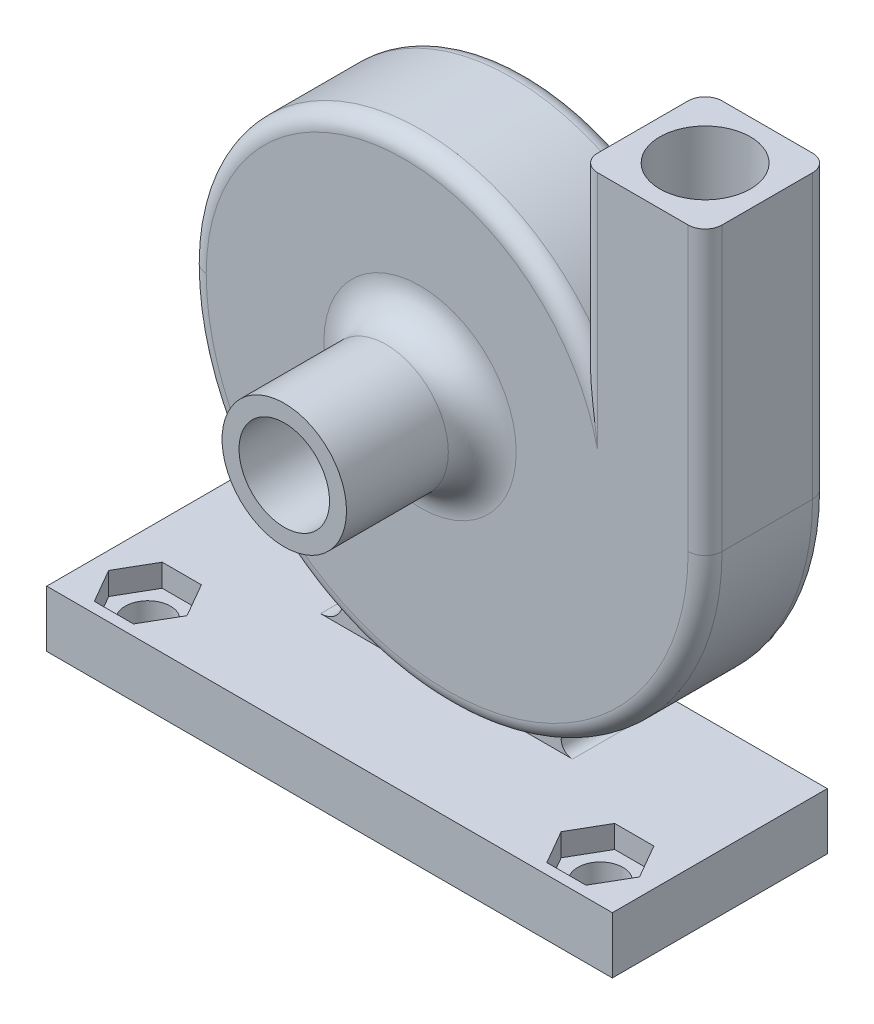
ISO-10303-21;
HEADER;
FILE_DESCRIPTION(('STEP AP214'),'2;1');
FILE_NAME('part.step','',(''),(''),'','','');
FILE_SCHEMA(('AUTOMOTIVE_DESIGN { 1 0 10303 214 1 1 1 1 }'));
ENDSEC;
DATA;
#1=APPLICATION_CONTEXT('core data for automotive mechanical design processes');
#2=APPLICATION_PROTOCOL_DEFINITION('international standard','automotive_design',2000,#1);
#3=PRODUCT_CONTEXT('',#1,'mechanical');
#4=PRODUCT('Part','Part','',(#3));
#5=PRODUCT_RELATED_PRODUCT_CATEGORY('part','',(#4));
#6=PRODUCT_DEFINITION_FORMATION('','',#4);
#7=PRODUCT_DEFINITION_CONTEXT('part definition',#1,'design');
#8=PRODUCT_DEFINITION('design','',#6,#7);
#9=PRODUCT_DEFINITION_SHAPE('','',#8);
#10=(LENGTH_UNIT() NAMED_UNIT(*) SI_UNIT(.MILLI.,.METRE.));
#11=(NAMED_UNIT(*) PLANE_ANGLE_UNIT() SI_UNIT($,.RADIAN.));
#12=(NAMED_UNIT(*) SI_UNIT($,.STERADIAN.) SOLID_ANGLE_UNIT());
#13=UNCERTAINTY_MEASURE_WITH_UNIT(LENGTH_MEASURE(1.E-05),#10,'distance_accuracy_value','');
#14=(GEOMETRIC_REPRESENTATION_CONTEXT(3) GLOBAL_UNCERTAINTY_ASSIGNED_CONTEXT((#13)) GLOBAL_UNIT_ASSIGNED_CONTEXT((#10,
#11,#12)) REPRESENTATION_CONTEXT('',''));
#15=CARTESIAN_POINT('',(0.,0.,0.));
#16=DIRECTION('',(0.,0.,1.));
#17=DIRECTION('',(1.,0.,0.));
#18=AXIS2_PLACEMENT_3D('',#15,#16,#17);
#19=CARTESIAN_POINT('',(15.1454497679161,6.46286969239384,2.5));
#20=CARTESIAN_POINT('',(15.0712387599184,6.47101476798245,2.49999990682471));
#21=CARTESIAN_POINT('',(15.0061778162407,6.49540664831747,2.44188768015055));
#22=CARTESIAN_POINT('',(14.9057881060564,6.55153888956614,2.32585370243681));
#23=CARTESIAN_POINT('',(14.8682342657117,6.58294841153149,2.26606332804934));
#24=CARTESIAN_POINT('',(14.8364072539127,6.61666455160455,2.21884122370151));
#25=CARTESIAN_POINT('',(15.1454497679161,6.46286969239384,1.49999999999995));
#26=CARTESIAN_POINT('',(15.1343161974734,6.46409155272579,1.70680717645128));
#27=CARTESIAN_POINT('',(15.0882546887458,6.46411719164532,1.75526644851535));
#28=CARTESIAN_POINT('',(15.0135767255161,6.47752230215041,1.79162473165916));
#29=CARTESIAN_POINT('',(14.9756168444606,6.48952495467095,1.78714149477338));
#30=CARTESIAN_POINT('',(14.9378774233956,6.50917150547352,1.78342551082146));
#31=CARTESIAN_POINT('',(15.0363493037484,5.46883896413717,1.5));
#32=CARTESIAN_POINT('',(14.9424966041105,5.72688290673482,1.5));
#33=CARTESIAN_POINT('',(14.8928556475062,5.84936972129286,1.49999999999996));
#34=CARTESIAN_POINT('',(14.8104211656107,6.05505578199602,1.50000000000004));
#35=CARTESIAN_POINT('',(14.7797620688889,6.12898830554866,1.50000000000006));
#36=CARTESIAN_POINT('',(14.7500894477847,6.19958557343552,1.5));
#37=(BOUNDED_SURFACE() B_SPLINE_SURFACE(2,3,((#19,#20,#21,#22,#23,#24),(#25,#26,#27,#28,#29,
#30),(#31,#32,#33,#34,#35,#36)),.UNSPECIFIED.,.F.,.F.,.F.) B_SPLINE_SURFACE_WITH_KNOTS((3,3),(4,
2,4),(0.,1.),(3.23850759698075,3.62110391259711,4.00370022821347),
.UNSPECIFIED.) GEOMETRIC_REPRESENTATION_ITEM() RATIONAL_B_SPLINE_SURFACE(((1.,1.,1.,1.,1.,1.),
(0.707106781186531,0.79472572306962,0.828098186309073,0.879660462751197,0.894608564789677,
0.90855127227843),(1.,1.,1.,1.,1.,1.))) REPRESENTATION_ITEM('') SURFACE());
#38=CARTESIAN_POINT('',(14.8364072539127,6.61666455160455,2.21884122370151));
#39=CARTESIAN_POINT('',(14.9378774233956,6.50917150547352,1.78342551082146));
#40=CARTESIAN_POINT('',(14.7500894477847,6.19958557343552,1.5));
#41=(BOUNDED_CURVE() B_SPLINE_CURVE(2,(#38,#39,#40),.UNSPECIFIED.,.F.,
.F.) B_SPLINE_CURVE_WITH_KNOTS((3,3),(0.,1.),
.UNSPECIFIED.) CURVE() GEOMETRIC_REPRESENTATION_ITEM() RATIONAL_B_SPLINE_CURVE((1.,
0.90855127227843,1.)) REPRESENTATION_ITEM(''));
#42=CARTESIAN_POINT('',(14.7500894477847,6.19958557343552,1.5));
#43=VERTEX_POINT('',#42);
#44=CARTESIAN_POINT('',(14.8364072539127,6.61666455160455,2.21884122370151));
#45=VERTEX_POINT('',#44);
#46=EDGE_CURVE('E12',#43,#45,#41,.F.);
#47=CARTESIAN_POINT('',(14.7500894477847,6.19958557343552,1.5));
#48=CARTESIAN_POINT('',(14.7576505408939,6.18160778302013,1.50000000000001));
#49=CARTESIAN_POINT('',(14.7651811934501,6.16361717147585,1.50000000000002));
#50=CARTESIAN_POINT('',(14.7806696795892,6.12642178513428,1.50000000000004));
#51=CARTESIAN_POINT('',(14.7886229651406,6.10721511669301,1.50000000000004));
#52=CARTESIAN_POINT('',(14.8052602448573,6.06679012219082,1.50000000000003));
#53=CARTESIAN_POINT('',(14.8139352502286,6.04556809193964,1.50000000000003));
#54=CARTESIAN_POINT('',(14.8323008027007,6.00030747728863,1.50000000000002));
#55=CARTESIAN_POINT('',(14.8419761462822,5.97626273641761,1.50000000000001));
#56=CARTESIAN_POINT('',(14.8626970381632,5.92468710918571,1.49999999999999));
#57=CARTESIAN_POINT('',(14.873738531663,5.89715459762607,1.49999999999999));
#58=CARTESIAN_POINT('',(14.898022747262,5.83602302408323,1.49999999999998));
#59=CARTESIAN_POINT('',(14.9112220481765,5.80240662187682,1.49999999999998));
#60=CARTESIAN_POINT('',(14.9409824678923,5.72550151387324,1.49999999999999));
#61=CARTESIAN_POINT('',(14.9574363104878,5.68217138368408,1.49999999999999));
#62=CARTESIAN_POINT('',(14.9948617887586,5.58222890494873,1.5));
#63=CARTESIAN_POINT('',(15.0156941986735,5.52556420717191,1.5));
#64=CARTESIAN_POINT('',(15.0363493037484,5.46883896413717,1.5));
#65=B_SPLINE_CURVE_WITH_KNOTS('',3,(#47,#48,#49,#50,#51,#52,#53,#54,#55,#56,#57,#58,#59,#60,#61,
#62,#63,#64),.UNSPECIFIED.,.F.,.F.,(4,2,2,2,2,2,2,2,4),(0.,0.0585093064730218,0.120873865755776,
0.189653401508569,0.267408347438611,0.356400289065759,0.464743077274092,0.603787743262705,
0.784899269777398),.UNSPECIFIED.);
#66=CARTESIAN_POINT('',(15.0363493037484,5.46883896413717,1.5));
#67=VERTEX_POINT('',#66);
#68=EDGE_CURVE('E173',#43,#67,#65,.T.);
#69=CARTESIAN_POINT('',(15.0363493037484,5.46883896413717,1.5));
#70=CARTESIAN_POINT('',(15.1454497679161,6.46286969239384,1.49999999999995));
#71=CARTESIAN_POINT('',(15.1454497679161,6.46286969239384,2.5));
#72=(BOUNDED_CURVE() B_SPLINE_CURVE(2,(#69,#70,#71),.UNSPECIFIED.,.F.,
.F.) B_SPLINE_CURVE_WITH_KNOTS((3,3),(0.,1.),
.UNSPECIFIED.) CURVE() GEOMETRIC_REPRESENTATION_ITEM() RATIONAL_B_SPLINE_CURVE((1.,
0.707106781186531,1.)) REPRESENTATION_ITEM(''));
#73=CARTESIAN_POINT('',(15.1454497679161,6.46286969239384,2.5));
#74=VERTEX_POINT('',#73);
#75=EDGE_CURVE('E475',#74,#67,#72,.F.);
#76=CARTESIAN_POINT('',(15.1454497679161,6.46286969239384,2.5));
#77=CARTESIAN_POINT('',(15.0712387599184,6.47101476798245,2.49999990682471));
#78=CARTESIAN_POINT('',(15.0061778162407,6.49540664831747,2.44188768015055));
#79=CARTESIAN_POINT('',(14.9057881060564,6.55153888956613,2.32585370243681));
#80=CARTESIAN_POINT('',(14.8682342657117,6.58294841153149,2.26606332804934));
#81=CARTESIAN_POINT('',(14.8364072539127,6.61666455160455,2.21884122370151));
#82=(BOUNDED_CURVE() B_SPLINE_CURVE(3,(#76,#77,#78,#79,#80,#81),.UNSPECIFIED.,.F.,
.F.) B_SPLINE_CURVE_WITH_KNOTS((4,2,4),(3.23850759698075,3.62110391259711,4.00370022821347),
.UNSPECIFIED.) CURVE() GEOMETRIC_REPRESENTATION_ITEM() RATIONAL_B_SPLINE_CURVE((1.,1.,1.,1.,1.,1.)) REPRESENTATION_ITEM(''));
#83=EDGE_CURVE('E1029',#45,#74,#82,.F.);
#84=ORIENTED_EDGE('',*,*,#46,.F.);
#85=ORIENTED_EDGE('',*,*,#68,.T.);
#86=ORIENTED_EDGE('',*,*,#75,.F.);
#87=ORIENTED_EDGE('',*,*,#83,.F.);
#88=EDGE_LOOP('',(#84,#85,#86,#87));
#89=FACE_BOUND('',#88,.T.);
#90=ADVANCED_FACE('F134',(#89),#37,.F.);
#91=CARTESIAN_POINT('',(20.,-28.,15.0603932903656));
#92=DIRECTION('',(0.,1.,0.));
#93=DIRECTION('',(-1.,0.,0.));
#94=AXIS2_PLACEMENT_3D('',#91,#92,#93);
#95=CYLINDRICAL_SURFACE('',#94,2.);
#96=CARTESIAN_POINT('',(20.,-28.,15.0603932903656));
#97=DIRECTION('',(0.,1.,0.));
#98=DIRECTION('',(-1.,0.,0.));
#99=AXIS2_PLACEMENT_3D('',#96,#97,#98);
#100=CIRCLE('',#99,2.);
#101=CARTESIAN_POINT('',(18.,-28.,15.0603932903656));
#102=VERTEX_POINT('',#101);
#103=EDGE_CURVE('E673',#102,#102,#100,.T.);
#104=ORIENTED_EDGE('',*,*,#103,.F.);
#105=EDGE_LOOP('',(#104));
#106=FACE_BOUND('',#105,.T.);
#107=CARTESIAN_POINT('',(20.,-25.,15.0603932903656));
#108=DIRECTION('',(0.,1.,0.));
#109=DIRECTION('',(0.,0.,1.));
#110=AXIS2_PLACEMENT_3D('',#107,#108,#109);
#111=CIRCLE('',#110,2.);
#112=CARTESIAN_POINT('',(20.,-25.,17.0603932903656));
#113=VERTEX_POINT('',#112);
#114=EDGE_CURVE('E675',#113,#113,#111,.F.);
#115=ORIENTED_EDGE('',*,*,#114,.F.);
#116=EDGE_LOOP('',(#115));
#117=FACE_BOUND('',#116,.T.);
#118=ADVANCED_FACE('F339',(#106,#117),#95,.F.);
#119=CARTESIAN_POINT('',(-20.,-28.,15.0603932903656));
#120=DIRECTION('',(0.,1.,0.));
#121=DIRECTION('',(-1.,0.,0.));
#122=AXIS2_PLACEMENT_3D('',#119,#120,#121);
#123=CYLINDRICAL_SURFACE('',#122,2.);
#124=CARTESIAN_POINT('',(-20.,-28.,15.0603932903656));
#125=DIRECTION('',(0.,1.,0.));
#126=DIRECTION('',(-1.,0.,0.));
#127=AXIS2_PLACEMENT_3D('',#124,#125,#126);
#128=CIRCLE('',#127,2.);
#129=CARTESIAN_POINT('',(-22.,-28.,15.0603932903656));
#130=VERTEX_POINT('',#129);
#131=EDGE_CURVE('E1337',#130,#130,#128,.T.);
#132=ORIENTED_EDGE('',*,*,#131,.F.);
#133=EDGE_LOOP('',(#132));
#134=FACE_BOUND('',#133,.T.);
#135=CARTESIAN_POINT('',(-20.,-25.,15.0603932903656));
#136=DIRECTION('',(0.,1.,0.));
#137=DIRECTION('',(0.,0.,1.));
#138=AXIS2_PLACEMENT_3D('',#135,#136,#137);
#139=CIRCLE('',#138,2.);
#140=CARTESIAN_POINT('',(-20.,-25.,17.0603932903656));
#141=VERTEX_POINT('',#140);
#142=EDGE_CURVE('E670',#141,#141,#139,.F.);
#143=ORIENTED_EDGE('',*,*,#142,.F.);
#144=EDGE_LOOP('',(#143));
#145=FACE_BOUND('',#144,.T.);
#146=ADVANCED_FACE('F343',(#134,#145),#123,.F.);
#147=CARTESIAN_POINT('',(-10.7924220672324,-21.,9.));
#148=DIRECTION('',(0.,0.,1.));
#149=DIRECTION('',(1.,0.,0.));
#150=AXIS2_PLACEMENT_3D('',#147,#148,#149);
#151=PLANE('',#150);
#152=CARTESIAN_POINT('',(-10.7924220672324,-21.,9.));
#153=DIRECTION('',(0.,0.,1.));
#154=DIRECTION('',(1.,0.,0.));
#155=AXIS2_PLACEMENT_3D('',#152,#153,#154);
#156=CIRCLE('',#155,2.);
#157=CARTESIAN_POINT('',(-10.7924220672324,-23.,9.));
#158=VERTEX_POINT('',#157);
#159=CARTESIAN_POINT('',(-9.72851706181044,-19.3064516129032,9.));
#160=VERTEX_POINT('',#159);
#161=EDGE_CURVE('E1362',#158,#160,#156,.T.);
#162=ORIENTED_EDGE('',*,*,#161,.F.);
#163=DIRECTION('',(1.,0.,0.));
#164=VECTOR('',#163,1.);
#165=CARTESIAN_POINT('',(-10.7924220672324,-23.,9.));
#166=LINE('',#165,#164);
#167=CARTESIAN_POINT('',(11.479647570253,-23.,9.));
#168=VERTEX_POINT('',#167);
#169=EDGE_CURVE('E666',#158,#168,#166,.T.);
#170=ORIENTED_EDGE('',*,*,#169,.T.);
#171=CARTESIAN_POINT('',(11.479647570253,-22.,9.));
#172=DIRECTION('',(0.,0.,1.));
#173=DIRECTION('',(-1.,0.,0.));
#174=AXIS2_PLACEMENT_3D('',#171,#172,#173);
#175=CIRCLE('',#174,1.);
#176=CARTESIAN_POINT('',(11.0981497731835,-21.0756302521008,9.));
#177=VERTEX_POINT('',#176);
#178=EDGE_CURVE('E1368',#177,#168,#175,.T.);
#179=ORIENTED_EDGE('',*,*,#178,.F.);
#180=CARTESIAN_POINT('',(2.4,0.,9.));
#181=DIRECTION('',(0.,0.,1.));
#182=DIRECTION('',(-1.,0.,0.));
#183=AXIS2_PLACEMENT_3D('',#180,#181,#182);
#184=CIRCLE('',#183,22.8);
#185=EDGE_CURVE('E1365',#160,#177,#184,.T.);
#186=ORIENTED_EDGE('',*,*,#185,.F.);
#187=EDGE_LOOP('',(#162,#170,#179,#186));
#188=FACE_BOUND('',#187,.T.);
#189=ADVANCED_FACE('F349',(#188),#151,.T.);
#190=CARTESIAN_POINT('',(2.4,0.,11.));
#191=DIRECTION('',(0.,0.,1.));
#192=DIRECTION('',(1.,0.,0.));
#193=AXIS2_PLACEMENT_3D('',#190,#191,#192);
#194=PLANE('',#193);
#195=DIRECTION('',(0.,1.,0.));
#196=VECTOR('',#195,1.);
#197=CARTESIAN_POINT('',(23.7,25.,11.));
#198=LINE('',#197,#196);
#199=CARTESIAN_POINT('',(23.7,0.,11.));
#200=VERTEX_POINT('',#199);
#201=CARTESIAN_POINT('',(23.7,25.,11.));
#202=VERTEX_POINT('',#201);
#203=EDGE_CURVE('E938',#200,#202,#198,.T.);
#204=ORIENTED_EDGE('',*,*,#203,.T.);
#205=DIRECTION('',(1.,0.,0.));
#206=VECTOR('',#205,1.);
#207=CARTESIAN_POINT('',(0.,25.,11.));
#208=LINE('',#207,#206);
#209=CARTESIAN_POINT('',(15.7,25.,11.));
#210=VERTEX_POINT('',#209);
#211=EDGE_CURVE('E1007',#210,#202,#208,.T.);
#212=ORIENTED_EDGE('',*,*,#211,.F.);
#213=DIRECTION('',(0.,-1.,0.));
#214=VECTOR('',#213,1.);
#215=CARTESIAN_POINT('',(15.7,10.846197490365,11.));
#216=LINE('',#215,#214);
#217=CARTESIAN_POINT('',(15.7,3.72021504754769,11.));
#218=VERTEX_POINT('',#217);
#219=EDGE_CURVE('E929',#210,#218,#216,.T.);
#220=ORIENTED_EDGE('',*,*,#219,.T.);
#221=CARTESIAN_POINT('',(-1.4,0.,11.));
#222=DIRECTION('',(0.,0.,1.));
#223=DIRECTION('',(1.,0.,0.));
#224=AXIS2_PLACEMENT_3D('',#221,#222,#223);
#225=CIRCLE('',#224,17.5);
#226=CARTESIAN_POINT('',(-18.9,0.,11.));
#227=VERTEX_POINT('',#226);
#228=EDGE_CURVE('E932',#218,#227,#225,.T.);
#229=ORIENTED_EDGE('',*,*,#228,.T.);
#230=CARTESIAN_POINT('',(2.4,0.,11.));
#231=DIRECTION('',(0.,0.,1.));
#232=DIRECTION('',(1.,0.,0.));
#233=AXIS2_PLACEMENT_3D('',#230,#231,#232);
#234=CIRCLE('',#233,21.3);
#235=EDGE_CURVE('E935',#227,#200,#234,.T.);
#236=ORIENTED_EDGE('',*,*,#235,.T.);
#237=EDGE_LOOP('',(#204,#212,#220,#229,#236));
#238=FACE_BOUND('',#237,.T.);
#239=CARTESIAN_POINT('',(0.,0.,11.));
#240=DIRECTION('',(0.,0.,1.));
#241=DIRECTION('',(1.,0.,0.));
#242=AXIS2_PLACEMENT_3D('',#239,#240,#241);
#243=CIRCLE('',#242,8.5);
#244=CARTESIAN_POINT('',(8.5,0.,11.));
#245=VERTEX_POINT('',#244);
#246=EDGE_CURVE('E656',#245,#245,#243,.F.);
#247=ORIENTED_EDGE('',*,*,#246,.T.);
#248=EDGE_LOOP('',(#247));
#249=FACE_BOUND('',#248,.T.);
#250=ADVANCED_FACE('F370',(#238,#249),#194,.T.);
#251=CARTESIAN_POINT('',(14.2,25.,11.));
#252=DIRECTION('',(0.,-1.,0.));
#253=DIRECTION('',(1.,0.,0.));
#254=AXIS2_PLACEMENT_3D('',#251,#252,#253);
#255=PLANE('',#254);
#256=ORIENTED_EDGE('',*,*,#211,.T.);
#257=CARTESIAN_POINT('',(23.7,25.,9.5));
#258=DIRECTION('',(0.,1.,0.));
#259=DIRECTION('',(-1.,0.,0.));
#260=AXIS2_PLACEMENT_3D('',#257,#258,#259);
#261=CIRCLE('',#260,1.5);
#262=CARTESIAN_POINT('',(25.2,25.,9.5));
#263=VERTEX_POINT('',#262);
#264=EDGE_CURVE('E992',#202,#263,#261,.T.);
#265=ORIENTED_EDGE('',*,*,#264,.T.);
#266=DIRECTION('',(0.,0.,-1.));
#267=VECTOR('',#266,1.);
#268=CARTESIAN_POINT('',(25.2,25.,0.));
#269=LINE('',#268,#267);
#270=CARTESIAN_POINT('',(25.2,25.,1.5));
#271=VERTEX_POINT('',#270);
#272=EDGE_CURVE('E978',#263,#271,#269,.T.);
#273=ORIENTED_EDGE('',*,*,#272,.T.);
#274=CARTESIAN_POINT('',(23.7,25.,1.5));
#275=DIRECTION('',(0.,1.,0.));
#276=DIRECTION('',(-1.,0.,0.));
#277=AXIS2_PLACEMENT_3D('',#274,#275,#276);
#278=CIRCLE('',#277,1.5);
#279=CARTESIAN_POINT('',(23.7,25.,0.));
#280=VERTEX_POINT('',#279);
#281=EDGE_CURVE('E986',#271,#280,#278,.T.);
#282=ORIENTED_EDGE('',*,*,#281,.T.);
#283=DIRECTION('',(-1.,0.,0.));
#284=VECTOR('',#283,1.);
#285=CARTESIAN_POINT('',(0.,25.,0.));
#286=LINE('',#285,#284);
#287=CARTESIAN_POINT('',(15.7,25.,0.));
#288=VERTEX_POINT('',#287);
#289=EDGE_CURVE('E989',#280,#288,#286,.T.);
#290=ORIENTED_EDGE('',*,*,#289,.T.);
#291=CARTESIAN_POINT('',(15.7,25.,1.5));
#292=DIRECTION('',(0.,1.,0.));
#293=DIRECTION('',(-1.,0.,0.));
#294=AXIS2_PLACEMENT_3D('',#291,#292,#293);
#295=CIRCLE('',#294,1.5);
#296=CARTESIAN_POINT('',(14.2,25.,1.5));
#297=VERTEX_POINT('',#296);
#298=EDGE_CURVE('E990',#288,#297,#295,.T.);
#299=ORIENTED_EDGE('',*,*,#298,.T.);
#300=DIRECTION('',(0.,0.,1.));
#301=VECTOR('',#300,1.);
#302=CARTESIAN_POINT('',(14.2,25.,0.));
#303=LINE('',#302,#301);
#304=CARTESIAN_POINT('',(14.2,25.,9.5));
#305=VERTEX_POINT('',#304);
#306=EDGE_CURVE('E999',#297,#305,#303,.T.);
#307=ORIENTED_EDGE('',*,*,#306,.T.);
#308=CARTESIAN_POINT('',(15.7,25.,9.5));
#309=DIRECTION('',(0.,1.,0.));
#310=DIRECTION('',(-1.,0.,0.));
#311=AXIS2_PLACEMENT_3D('',#308,#309,#310);
#312=CIRCLE('',#311,1.5);
#313=EDGE_CURVE('E1004',#305,#210,#312,.T.);
#314=ORIENTED_EDGE('',*,*,#313,.T.);
#315=EDGE_LOOP('',(#256,#265,#273,#282,#290,#299,#307,#314));
#316=FACE_BOUND('',#315,.T.);
#317=CARTESIAN_POINT('',(19.7,25.,5.5));
#318=DIRECTION('',(0.,-1.,0.));
#319=DIRECTION('',(1.,0.,0.));
#320=AXIS2_PLACEMENT_3D('',#317,#318,#319);
#321=CIRCLE('',#320,4.);
#322=CARTESIAN_POINT('',(23.7,25.,5.5));
#323=VERTEX_POINT('',#322);
#324=EDGE_CURVE('E924',#323,#323,#321,.F.);
#325=ORIENTED_EDGE('',*,*,#324,.F.);
#326=EDGE_LOOP('',(#325));
#327=FACE_BOUND('',#326,.T.);
#328=ADVANCED_FACE('F865',(#316,#327),#255,.F.);
#329=CARTESIAN_POINT('',(2.4,0.,0.));
#330=DIRECTION('',(0.,0.,1.));
#331=DIRECTION('',(1.,0.,0.));
#332=AXIS2_PLACEMENT_3D('',#329,#330,#331);
#333=PLANE('',#332);
#334=DIRECTION('',(0.,-1.,0.));
#335=VECTOR('',#334,1.);
#336=CARTESIAN_POINT('',(15.7,0.,0.));
#337=LINE('',#336,#335);
#338=CARTESIAN_POINT('',(15.7,3.72021504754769,0.));
#339=VERTEX_POINT('',#338);
#340=EDGE_CURVE('E956',#339,#288,#337,.F.);
#341=ORIENTED_EDGE('',*,*,#340,.T.);
#342=ORIENTED_EDGE('',*,*,#289,.F.);
#343=DIRECTION('',(0.,1.,0.));
#344=VECTOR('',#343,1.);
#345=CARTESIAN_POINT('',(23.7,0.,0.));
#346=LINE('',#345,#344);
#347=CARTESIAN_POINT('',(23.7,0.,0.));
#348=VERTEX_POINT('',#347);
#349=EDGE_CURVE('E947',#280,#348,#346,.F.);
#350=ORIENTED_EDGE('',*,*,#349,.T.);
#351=CARTESIAN_POINT('',(2.4,0.,0.));
#352=DIRECTION('',(0.,0.,1.));
#353=DIRECTION('',(1.,0.,0.));
#354=AXIS2_PLACEMENT_3D('',#351,#352,#353);
#355=CIRCLE('',#354,21.3);
#356=CARTESIAN_POINT('',(-18.9,0.,0.));
#357=VERTEX_POINT('',#356);
#358=EDGE_CURVE('E950',#348,#357,#355,.F.);
#359=ORIENTED_EDGE('',*,*,#358,.T.);
#360=CARTESIAN_POINT('',(-1.4,0.,0.));
#361=DIRECTION('',(0.,0.,1.));
#362=DIRECTION('',(1.,0.,0.));
#363=AXIS2_PLACEMENT_3D('',#360,#361,#362);
#364=CIRCLE('',#363,17.5);
#365=EDGE_CURVE('E953',#357,#339,#364,.F.);
#366=ORIENTED_EDGE('',*,*,#365,.T.);
#367=EDGE_LOOP('',(#341,#342,#350,#359,#366));
#368=FACE_BOUND('',#367,.T.);
#369=CARTESIAN_POINT('',(0.,0.,0.));
#370=DIRECTION('',(0.,0.,-1.));
#371=DIRECTION('',(-1.,0.,0.));
#372=AXIS2_PLACEMENT_3D('',#369,#370,#371);
#373=CIRCLE('',#372,16.);
#374=CARTESIAN_POINT('',(-16.,0.,0.));
#375=VERTEX_POINT('',#374);
#376=EDGE_CURVE('E1019',#375,#375,#373,.T.);
#377=ORIENTED_EDGE('',*,*,#376,.F.);
#378=EDGE_LOOP('',(#377));
#379=FACE_BOUND('',#378,.T.);
#380=ADVANCED_FACE('F867',(#368,#379),#333,.F.);
#381=CARTESIAN_POINT('',(14.2,10.846197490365,11.));
#382=DIRECTION('',(1.,0.,0.));
#383=DIRECTION('',(0.,0.,-1.));
#384=AXIS2_PLACEMENT_3D('',#381,#382,#383);
#385=PLANE('',#384);
#386=ORIENTED_EDGE('',*,*,#306,.F.);
#387=DIRECTION('',(0.,-1.,0.));
#388=VECTOR('',#387,1.);
#389=CARTESIAN_POINT('',(14.2,10.846197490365,1.5));
#390=LINE('',#389,#388);
#391=CARTESIAN_POINT('',(14.2,10.846197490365,1.5));
#392=VERTEX_POINT('',#391);
#393=EDGE_CURVE('E966',#297,#392,#390,.T.);
#394=ORIENTED_EDGE('',*,*,#393,.T.);
#395=DIRECTION('',(0.,0.,-1.));
#396=VECTOR('',#395,1.);
#397=CARTESIAN_POINT('',(14.2,10.846197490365,11.));
#398=LINE('',#397,#396);
#399=CARTESIAN_POINT('',(14.2,10.846197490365,9.5));
#400=VERTEX_POINT('',#399);
#401=EDGE_CURVE('E914',#400,#392,#398,.T.);
#402=ORIENTED_EDGE('',*,*,#401,.F.);
#403=DIRECTION('',(0.,-1.,0.));
#404=VECTOR('',#403,1.);
#405=CARTESIAN_POINT('',(14.2,25.,9.5));
#406=LINE('',#405,#404);
#407=EDGE_CURVE('E963',#400,#305,#406,.F.);
#408=ORIENTED_EDGE('',*,*,#407,.T.);
#409=EDGE_LOOP('',(#386,#394,#402,#408));
#410=FACE_BOUND('',#409,.T.);
#411=ADVANCED_FACE('F870',(#410),#385,.F.);
#412=CARTESIAN_POINT('',(15.7,10.846197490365,1.5));
#413=DIRECTION('',(0.,-1.,0.));
#414=DIRECTION('',(0.,0.,-1.));
#415=AXIS2_PLACEMENT_3D('',#412,#413,#414);
#416=CYLINDRICAL_SURFACE('',#415,1.5);
#417=ORIENTED_EDGE('',*,*,#393,.F.);
#418=ORIENTED_EDGE('',*,*,#298,.F.);
#419=ORIENTED_EDGE('',*,*,#340,.F.);
#420=CARTESIAN_POINT('',(14.2,10.846197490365,1.5));
#421=CARTESIAN_POINT('',(14.1999705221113,10.846288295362,1.47045139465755));
#422=CARTESIAN_POINT('',(14.2008717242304,10.8434168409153,1.44103957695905));
#423=CARTESIAN_POINT('',(14.2042538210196,10.8326211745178,1.3836667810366));
#424=CARTESIAN_POINT('',(14.2067120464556,10.8247694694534,1.35569111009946));
#425=CARTESIAN_POINT('',(14.2136803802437,10.8024746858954,1.29504447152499));
#426=CARTESIAN_POINT('',(14.2185392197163,10.7869088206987,1.26283703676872));
#427=CARTESIAN_POINT('',(14.2297049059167,10.7510347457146,1.2013110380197));
#428=CARTESIAN_POINT('',(14.2360201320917,10.730699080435,1.17201065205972));
#429=CARTESIAN_POINT('',(14.2544410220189,10.6711793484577,1.09654652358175));
#430=CARTESIAN_POINT('',(14.267480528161,10.6288447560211,1.05313225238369));
#431=CARTESIAN_POINT('',(14.2950085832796,10.5388548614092,0.972941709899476));
#432=CARTESIAN_POINT('',(14.3094999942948,10.4911890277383,0.936178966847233));
#433=CARTESIAN_POINT('',(14.345572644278,10.3716576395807,0.853188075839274));
#434=CARTESIAN_POINT('',(14.3675497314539,10.2981162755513,0.809576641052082));
#435=CARTESIAN_POINT('',(14.4121148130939,10.1472848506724,0.729655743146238));
#436=CARTESIAN_POINT('',(14.4347040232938,10.0699870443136,0.69336223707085));
#437=CARTESIAN_POINT('',(14.4801377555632,9.91265287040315,0.62616502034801));
#438=CARTESIAN_POINT('',(14.5029829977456,9.83260394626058,0.595291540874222));
#439=CARTESIAN_POINT('',(14.5485266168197,9.67101288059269,0.538002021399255));
#440=CARTESIAN_POINT('',(14.5712251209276,9.58947236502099,0.51158141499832));
#441=CARTESIAN_POINT('',(14.6335784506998,9.36254842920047,0.443477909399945));
#442=CARTESIAN_POINT('',(14.6729449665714,9.21596304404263,0.405547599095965));
#443=CARTESIAN_POINT('',(14.7503657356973,8.92056911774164,0.337751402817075));
#444=CARTESIAN_POINT('',(14.788419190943,8.7717593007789,0.307890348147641));
#445=CARTESIAN_POINT('',(14.8630337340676,8.47233868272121,0.254368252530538));
#446=CARTESIAN_POINT('',(14.8995916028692,8.32172481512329,0.230720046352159));
#447=CARTESIAN_POINT('',(14.970986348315,8.01938933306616,0.188414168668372));
#448=CARTESIAN_POINT('',(15.0058230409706,7.86766760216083,0.169757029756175));
#449=CARTESIAN_POINT('',(15.0736736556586,7.5633938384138,0.136496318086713));
#450=CARTESIAN_POINT('',(15.1066877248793,7.41084187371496,0.121892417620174));
#451=CARTESIAN_POINT('',(15.1708312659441,7.10505877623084,0.0960154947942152));
#452=CARTESIAN_POINT('',(15.2019606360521,6.95182760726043,0.0847426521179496));
#453=CARTESIAN_POINT('',(15.292376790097,6.49165117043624,0.0550473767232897));
#454=CARTESIAN_POINT('',(15.3487709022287,6.18386791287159,0.0407123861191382));
#455=CARTESIAN_POINT('',(15.443509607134,5.62595288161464,0.0214667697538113));
#456=CARTESIAN_POINT('',(15.4832411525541,5.37609213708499,0.0152755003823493));
#457=CARTESIAN_POINT('',(15.5573575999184,4.87579221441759,0.00633051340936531));
#458=CARTESIAN_POINT('',(15.5917482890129,4.62535396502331,0.00357305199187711));
#459=CARTESIAN_POINT('',(15.6350523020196,4.28284924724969,0.00136223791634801));
#460=CARTESIAN_POINT('',(15.6462907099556,4.19107553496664,0.000922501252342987));
#461=CARTESIAN_POINT('',(15.6680482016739,4.00743010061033,0.000300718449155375));
#462=CARTESIAN_POINT('',(15.6785671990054,3.91555836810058,0.000118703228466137));
#463=CARTESIAN_POINT('',(15.691918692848,3.79474136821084,1.83778653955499E-05));
#464=CARTESIAN_POINT('',(15.6950772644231,3.76583182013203,4.82863277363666E-06));
#465=CARTESIAN_POINT('',(15.6988013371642,3.7313507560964,3.58135891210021E-07));
#466=CARTESIAN_POINT('',(15.6994013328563,3.72578297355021,-3.04401111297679E-10));
#467=CARTESIAN_POINT('',(15.7,3.72021504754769,0.));
#468=B_SPLINE_CURVE_WITH_KNOTS('',3,(#420,#421,#422,#423,#424,#425,#426,#427,#428,#429,#430,
#431,#432,#433,#434,#435,#436,#437,#438,#439,#440,#441,#442,#443,#444,#445,#446,#447,#448,#449,
#450,#451,#452,#453,#454,#455,#456,#457,#458,#459,#460,#461,#462,#463,#464,#465,#466,#467),
.UNSPECIFIED.,.F.,.F.,(4,2,2,2,2,2,2,2,2,2,2,2,2,2,2,2,2,2,2,2,2,2,2,4),(0.,0.0882734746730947,
0.175290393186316,0.282980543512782,0.391306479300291,0.576333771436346,0.761733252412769,
1.02592104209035,1.29067881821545,1.55686939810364,1.82278531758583,2.29176965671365,
2.76103417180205,3.23126062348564,3.70153723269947,4.17177580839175,4.64203974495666,
5.58147193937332,6.34062643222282,7.09895250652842,7.37633170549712,7.65374417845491,
7.74098889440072,7.75778894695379),.UNSPECIFIED.);
#469=EDGE_CURVE('E640',#392,#339,#468,.T.);
#470=ORIENTED_EDGE('',*,*,#469,.F.);
#471=EDGE_LOOP('',(#417,#418,#419,#470));
#472=FACE_BOUND('',#471,.T.);
#473=ADVANCED_FACE('F636',(#472),#416,.T.);
#474=CARTESIAN_POINT('',(15.7,0.,9.5));
#475=DIRECTION('',(0.,1.,0.));
#476=DIRECTION('',(0.,0.,1.));
#477=AXIS2_PLACEMENT_3D('',#474,#475,#476);
#478=CYLINDRICAL_SURFACE('',#477,1.5);
#479=ORIENTED_EDGE('',*,*,#219,.F.);
#480=ORIENTED_EDGE('',*,*,#313,.F.);
#481=ORIENTED_EDGE('',*,*,#407,.F.);
#482=CARTESIAN_POINT('',(14.2,10.846197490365,9.5));
#483=CARTESIAN_POINT('',(14.1999705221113,10.846288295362,9.52954860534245));
#484=CARTESIAN_POINT('',(14.2008717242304,10.8434168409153,9.55896042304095));
#485=CARTESIAN_POINT('',(14.2042538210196,10.8326211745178,9.6163332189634));
#486=CARTESIAN_POINT('',(14.2067120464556,10.8247694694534,9.64430888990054));
#487=CARTESIAN_POINT('',(14.2136803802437,10.8024746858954,9.70495552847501));
#488=CARTESIAN_POINT('',(14.2185392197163,10.7869088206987,9.73716296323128));
#489=CARTESIAN_POINT('',(14.2297049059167,10.7510347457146,9.7986889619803));
#490=CARTESIAN_POINT('',(14.2360201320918,10.730699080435,9.82798934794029));
#491=CARTESIAN_POINT('',(14.2544410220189,10.6711793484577,9.90345347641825));
#492=CARTESIAN_POINT('',(14.267480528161,10.6288447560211,9.94686774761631));
#493=CARTESIAN_POINT('',(14.2950085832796,10.5388548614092,10.0270582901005));
#494=CARTESIAN_POINT('',(14.3094999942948,10.4911890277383,10.0638210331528));
#495=CARTESIAN_POINT('',(14.345572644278,10.3716576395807,10.1468119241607));
#496=CARTESIAN_POINT('',(14.3675497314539,10.2981162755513,10.1904233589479));
#497=CARTESIAN_POINT('',(14.4121148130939,10.1472848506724,10.2703442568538));
#498=CARTESIAN_POINT('',(14.4347040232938,10.0699870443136,10.3066377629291));
#499=CARTESIAN_POINT('',(14.4801377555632,9.91265287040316,10.373834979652));
#500=CARTESIAN_POINT('',(14.5029829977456,9.83260394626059,10.4047084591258));
#501=CARTESIAN_POINT('',(14.5485266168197,9.67101288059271,10.4619979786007));
#502=CARTESIAN_POINT('',(14.5712251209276,9.58947236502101,10.4884185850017));
#503=CARTESIAN_POINT('',(14.6335784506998,9.36254842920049,10.5565220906));
#504=CARTESIAN_POINT('',(14.6729449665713,9.21596304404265,10.594452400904));
#505=CARTESIAN_POINT('',(14.7503657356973,8.92056911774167,10.6622485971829));
#506=CARTESIAN_POINT('',(14.788419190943,8.77175930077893,10.6921096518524));
#507=CARTESIAN_POINT('',(14.8630337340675,8.47233868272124,10.7456317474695));
#508=CARTESIAN_POINT('',(14.8995916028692,8.32172481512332,10.7692799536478));
#509=CARTESIAN_POINT('',(14.970986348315,8.01938933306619,10.8115858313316));
#510=CARTESIAN_POINT('',(15.0058230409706,7.86766760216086,10.8302429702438));
#511=CARTESIAN_POINT('',(15.0736736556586,7.56339383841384,10.8635036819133));
#512=CARTESIAN_POINT('',(15.1066877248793,7.410841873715,10.8781075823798));
#513=CARTESIAN_POINT('',(15.1708312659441,7.10505877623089,10.9039845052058));
#514=CARTESIAN_POINT('',(15.2019606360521,6.95182760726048,10.915257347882));
#515=CARTESIAN_POINT('',(15.292376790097,6.49165117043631,10.9449526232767));
#516=CARTESIAN_POINT('',(15.3487709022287,6.18386791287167,10.9592876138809));
#517=CARTESIAN_POINT('',(15.443509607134,5.62595288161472,10.9785332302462));
#518=CARTESIAN_POINT('',(15.4832411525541,5.37609213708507,10.9847244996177));
#519=CARTESIAN_POINT('',(15.5573575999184,4.87579221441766,10.9936694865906));
#520=CARTESIAN_POINT('',(15.5917482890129,4.62535396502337,10.9964269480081));
#521=CARTESIAN_POINT('',(15.6350523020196,4.28284924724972,10.9986377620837));
#522=CARTESIAN_POINT('',(15.6462907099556,4.19107553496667,10.9990774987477));
#523=CARTESIAN_POINT('',(15.668048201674,4.00743010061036,10.9996992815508));
#524=CARTESIAN_POINT('',(15.6785671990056,3.91555836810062,10.9998812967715));
#525=CARTESIAN_POINT('',(15.6919186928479,3.79474136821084,10.9999816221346));
#526=CARTESIAN_POINT('',(15.695077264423,3.76583182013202,10.9999951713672));
#527=CARTESIAN_POINT('',(15.6988013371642,3.7313507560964,10.9999996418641));
#528=CARTESIAN_POINT('',(15.6994013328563,3.72578297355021,11.0000000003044));
#529=CARTESIAN_POINT('',(15.7,3.72021504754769,11.));
#530=B_SPLINE_CURVE_WITH_KNOTS('',3,(#482,#483,#484,#485,#486,#487,#488,#489,#490,#491,#492,
#493,#494,#495,#496,#497,#498,#499,#500,#501,#502,#503,#504,#505,#506,#507,#508,#509,#510,#511,
#512,#513,#514,#515,#516,#517,#518,#519,#520,#521,#522,#523,#524,#525,#526,#527,#528,#529),
.UNSPECIFIED.,.F.,.F.,(4,2,2,2,2,2,2,2,2,2,2,2,2,2,2,2,2,2,2,2,2,2,2,4),(0.,0.0882734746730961,
0.175290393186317,0.282980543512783,0.39130647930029,0.576333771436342,0.761733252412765,
1.02592104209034,1.29067881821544,1.55686939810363,1.82278531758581,2.29176965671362,
2.76103417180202,3.23126062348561,3.70153723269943,4.1717758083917,4.6420397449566,
5.58147193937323,6.34062643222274,7.09895250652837,7.37633170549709,7.6537441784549,
7.74098889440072,7.75778894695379),.UNSPECIFIED.);
#531=EDGE_CURVE('E898',#218,#400,#530,.F.);
#532=ORIENTED_EDGE('',*,*,#531,.F.);
#533=EDGE_LOOP('',(#479,#480,#481,#532));
#534=FACE_BOUND('',#533,.T.);
#535=ADVANCED_FACE('F886',(#534),#478,.T.);
#536=CARTESIAN_POINT('',(25.2,25.,11.));
#537=DIRECTION('',(-1.,0.,0.));
#538=DIRECTION('',(0.,-1.,0.));
#539=AXIS2_PLACEMENT_3D('',#536,#537,#538);
#540=PLANE('',#539);
#541=DIRECTION('',(0.,1.,0.));
#542=VECTOR('',#541,1.);
#543=CARTESIAN_POINT('',(25.2,25.,1.5));
#544=LINE('',#543,#542);
#545=CARTESIAN_POINT('',(25.2,0.,1.5));
#546=VERTEX_POINT('',#545);
#547=EDGE_CURVE('E657',#546,#271,#544,.T.);
#548=ORIENTED_EDGE('',*,*,#547,.T.);
#549=ORIENTED_EDGE('',*,*,#272,.F.);
#550=DIRECTION('',(0.,1.,0.));
#551=VECTOR('',#550,1.);
#552=CARTESIAN_POINT('',(25.2,0.,9.5));
#553=LINE('',#552,#551);
#554=CARTESIAN_POINT('',(25.2,0.,9.5));
#555=VERTEX_POINT('',#554);
#556=EDGE_CURVE('E969',#263,#555,#553,.F.);
#557=ORIENTED_EDGE('',*,*,#556,.T.);
#558=DIRECTION('',(0.,0.,-1.));
#559=VECTOR('',#558,1.);
#560=CARTESIAN_POINT('',(25.2,0.,11.));
#561=LINE('',#560,#559);
#562=EDGE_CURVE('E921',#555,#546,#561,.T.);
#563=ORIENTED_EDGE('',*,*,#562,.T.);
#564=EDGE_LOOP('',(#548,#549,#557,#563));
#565=FACE_BOUND('',#564,.T.);
#566=ADVANCED_FACE('F883',(#565),#540,.F.);
#567=CARTESIAN_POINT('',(23.7,0.,9.5));
#568=DIRECTION('',(0.,-1.,0.));
#569=DIRECTION('',(1.,0.,0.));
#570=AXIS2_PLACEMENT_3D('',#567,#568,#569);
#571=CYLINDRICAL_SURFACE('',#570,1.5);
#572=ORIENTED_EDGE('',*,*,#556,.F.);
#573=ORIENTED_EDGE('',*,*,#264,.F.);
#574=ORIENTED_EDGE('',*,*,#203,.F.);
#575=CARTESIAN_POINT('',(23.7,0.,9.5));
#576=DIRECTION('',(0.,-1.,0.));
#577=DIRECTION('',(0.,0.,-1.));
#578=AXIS2_PLACEMENT_3D('',#575,#576,#577);
#579=CIRCLE('',#578,1.5);
#580=EDGE_CURVE('E904',#555,#200,#579,.T.);
#581=ORIENTED_EDGE('',*,*,#580,.F.);
#582=EDGE_LOOP('',(#572,#573,#574,#581));
#583=FACE_BOUND('',#582,.T.);
#584=ADVANCED_FACE('F624',(#583),#571,.T.);
#585=CARTESIAN_POINT('',(23.7,25.,1.5));
#586=DIRECTION('',(0.,1.,0.));
#587=DIRECTION('',(-1.,0.,0.));
#588=AXIS2_PLACEMENT_3D('',#585,#586,#587);
#589=CYLINDRICAL_SURFACE('',#588,1.5);
#590=ORIENTED_EDGE('',*,*,#349,.F.);
#591=ORIENTED_EDGE('',*,*,#281,.F.);
#592=ORIENTED_EDGE('',*,*,#547,.F.);
#593=CARTESIAN_POINT('',(23.7,0.,1.5));
#594=DIRECTION('',(0.,-1.,0.));
#595=DIRECTION('',(0.,0.,-1.));
#596=AXIS2_PLACEMENT_3D('',#593,#594,#595);
#597=CIRCLE('',#596,1.5);
#598=EDGE_CURVE('E647',#348,#546,#597,.T.);
#599=ORIENTED_EDGE('',*,*,#598,.F.);
#600=EDGE_LOOP('',(#590,#591,#592,#599));
#601=FACE_BOUND('',#600,.T.);
#602=ADVANCED_FACE('F620',(#601),#589,.T.);
#603=CARTESIAN_POINT('',(2.4,0.,11.));
#604=DIRECTION('',(0.,0.,-1.));
#605=DIRECTION('',(-1.,0.,0.));
#606=AXIS2_PLACEMENT_3D('',#603,#604,#605);
#607=CYLINDRICAL_SURFACE('',#606,22.8);
#608=CARTESIAN_POINT('',(2.4,0.,1.5));
#609=DIRECTION('',(0.,0.,1.));
#610=DIRECTION('',(1.,0.,0.));
#611=AXIS2_PLACEMENT_3D('',#608,#609,#610);
#612=CIRCLE('',#611,22.8);
#613=CARTESIAN_POINT('',(-20.4,0.,1.5));
#614=VERTEX_POINT('',#613);
#615=EDGE_CURVE('E961',#614,#546,#612,.T.);
#616=ORIENTED_EDGE('',*,*,#615,.T.);
#617=ORIENTED_EDGE('',*,*,#562,.F.);
#618=CARTESIAN_POINT('',(2.4,0.,9.5));
#619=DIRECTION('',(0.,0.,1.));
#620=DIRECTION('',(1.,0.,0.));
#621=AXIS2_PLACEMENT_3D('',#618,#619,#620);
#622=CIRCLE('',#621,22.8);
#623=CARTESIAN_POINT('',(-20.4,0.,9.5));
#624=VERTEX_POINT('',#623);
#625=EDGE_CURVE('E959',#555,#624,#622,.F.);
#626=ORIENTED_EDGE('',*,*,#625,.T.);
#627=DIRECTION('',(0.,0.,-1.));
#628=VECTOR('',#627,1.);
#629=CARTESIAN_POINT('',(-20.4,0.,11.));
#630=LINE('',#629,#628);
#631=EDGE_CURVE('E907',#624,#614,#630,.T.);
#632=ORIENTED_EDGE('',*,*,#631,.T.);
#633=EDGE_LOOP('',(#616,#617,#626,#632));
#634=FACE_BOUND('',#633,.T.);
#635=ORIENTED_EDGE('',*,*,#185,.T.);
#636=DIRECTION('',(0.,0.,-1.));
#637=VECTOR('',#636,1.);
#638=CARTESIAN_POINT('',(11.0981497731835,-21.0756302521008,9.));
#639=LINE('',#638,#637);
#640=CARTESIAN_POINT('',(11.0981497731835,-21.0756302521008,2.));
#641=VERTEX_POINT('',#640);
#642=EDGE_CURVE('E1386',#177,#641,#639,.T.);
#643=ORIENTED_EDGE('',*,*,#642,.T.);
#644=CARTESIAN_POINT('',(2.40000000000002,2.70616862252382E-13,2.));
#645=DIRECTION('',(0.,0.,1.));
#646=DIRECTION('',(-1.,0.,0.));
#647=AXIS2_PLACEMENT_3D('',#644,#645,#646);
#648=CIRCLE('',#647,22.8000000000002);
#649=CARTESIAN_POINT('',(-9.72851706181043,-19.3064516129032,2.));
#650=VERTEX_POINT('',#649);
#651=EDGE_CURVE('E1359',#650,#641,#648,.T.);
#652=ORIENTED_EDGE('',*,*,#651,.F.);
#653=DIRECTION('',(0.,0.,-1.));
#654=VECTOR('',#653,1.);
#655=CARTESIAN_POINT('',(-9.72851706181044,-19.3064516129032,9.));
#656=LINE('',#655,#654);
#657=EDGE_CURVE('E1389',#160,#650,#656,.T.);
#658=ORIENTED_EDGE('',*,*,#657,.F.);
#659=EDGE_LOOP('',(#635,#643,#652,#658));
#660=FACE_BOUND('',#659,.T.);
#661=ADVANCED_FACE('F623',(#634,#660),#607,.T.);
#662=CARTESIAN_POINT('',(-1.4,0.,11.));
#663=DIRECTION('',(0.,0.,-1.));
#664=DIRECTION('',(-1.,0.,0.));
#665=AXIS2_PLACEMENT_3D('',#662,#663,#664);
#666=CYLINDRICAL_SURFACE('',#665,19.);
#667=ORIENTED_EDGE('',*,*,#631,.F.);
#668=CARTESIAN_POINT('',(-1.4,0.,9.5));
#669=DIRECTION('',(0.,0.,1.));
#670=DIRECTION('',(1.,0.,0.));
#671=AXIS2_PLACEMENT_3D('',#668,#669,#670);
#672=CIRCLE('',#671,19.);
#673=EDGE_CURVE('E944',#624,#400,#672,.F.);
#674=ORIENTED_EDGE('',*,*,#673,.T.);
#675=ORIENTED_EDGE('',*,*,#401,.T.);
#676=CARTESIAN_POINT('',(-1.4,0.,1.5));
#677=DIRECTION('',(0.,0.,1.));
#678=DIRECTION('',(1.,0.,0.));
#679=AXIS2_PLACEMENT_3D('',#676,#677,#678);
#680=CIRCLE('',#679,19.);
#681=EDGE_CURVE('E941',#392,#614,#680,.T.);
#682=ORIENTED_EDGE('',*,*,#681,.T.);
#683=EDGE_LOOP('',(#667,#674,#675,#682));
#684=FACE_BOUND('',#683,.T.);
#685=ADVANCED_FACE('F872',(#684),#666,.T.);
#686=CARTESIAN_POINT('',(2.4,0.,9.5));
#687=DIRECTION('',(0.,0.,1.));
#688=DIRECTION('',(1.,0.,0.));
#689=AXIS2_PLACEMENT_3D('',#686,#687,#688);
#690=TOROIDAL_SURFACE('',#689,21.3,1.5);
#691=ORIENTED_EDGE('',*,*,#580,.T.);
#692=ORIENTED_EDGE('',*,*,#235,.F.);
#693=CARTESIAN_POINT('',(-18.9,0.,9.5));
#694=DIRECTION('',(0.,1.,0.));
#695=DIRECTION('',(0.,0.,1.));
#696=AXIS2_PLACEMENT_3D('',#693,#694,#695);
#697=CIRCLE('',#696,1.5);
#698=EDGE_CURVE('E652',#624,#227,#697,.T.);
#699=ORIENTED_EDGE('',*,*,#698,.F.);
#700=ORIENTED_EDGE('',*,*,#625,.F.);
#701=EDGE_LOOP('',(#691,#692,#699,#700));
#702=FACE_BOUND('',#701,.T.);
#703=ADVANCED_FACE('F875',(#702),#690,.T.);
#704=CARTESIAN_POINT('',(-1.4,0.,9.5));
#705=DIRECTION('',(0.,0.,1.));
#706=DIRECTION('',(1.,0.,0.));
#707=AXIS2_PLACEMENT_3D('',#704,#705,#706);
#708=TOROIDAL_SURFACE('',#707,17.5,1.5);
#709=ORIENTED_EDGE('',*,*,#531,.T.);
#710=ORIENTED_EDGE('',*,*,#673,.F.);
#711=ORIENTED_EDGE('',*,*,#698,.T.);
#712=ORIENTED_EDGE('',*,*,#228,.F.);
#713=EDGE_LOOP('',(#709,#710,#711,#712));
#714=FACE_BOUND('',#713,.T.);
#715=ADVANCED_FACE('F630',(#714),#708,.T.);
#716=CARTESIAN_POINT('',(2.4,0.,1.5));
#717=DIRECTION('',(0.,0.,1.));
#718=DIRECTION('',(1.,0.,0.));
#719=AXIS2_PLACEMENT_3D('',#716,#717,#718);
#720=TOROIDAL_SURFACE('',#719,21.3,1.5);
#721=ORIENTED_EDGE('',*,*,#598,.T.);
#722=ORIENTED_EDGE('',*,*,#615,.F.);
#723=CARTESIAN_POINT('',(-18.9,0.,1.5));
#724=DIRECTION('',(0.,1.,0.));
#725=DIRECTION('',(0.,0.,1.));
#726=AXIS2_PLACEMENT_3D('',#723,#724,#725);
#727=CIRCLE('',#726,1.5);
#728=EDGE_CURVE('E648',#357,#614,#727,.T.);
#729=ORIENTED_EDGE('',*,*,#728,.F.);
#730=ORIENTED_EDGE('',*,*,#358,.F.);
#731=EDGE_LOOP('',(#721,#722,#729,#730));
#732=FACE_BOUND('',#731,.T.);
#733=ADVANCED_FACE('F626',(#732),#720,.T.);
#734=CARTESIAN_POINT('',(-1.4,0.,1.5));
#735=DIRECTION('',(0.,0.,1.));
#736=DIRECTION('',(1.,0.,0.));
#737=AXIS2_PLACEMENT_3D('',#734,#735,#736);
#738=TOROIDAL_SURFACE('',#737,17.5,1.5);
#739=ORIENTED_EDGE('',*,*,#469,.T.);
#740=ORIENTED_EDGE('',*,*,#365,.F.);
#741=ORIENTED_EDGE('',*,*,#728,.T.);
#742=ORIENTED_EDGE('',*,*,#681,.F.);
#743=EDGE_LOOP('',(#739,#740,#741,#742));
#744=FACE_BOUND('',#743,.T.);
#745=ADVANCED_FACE('F629',(#744),#738,.T.);
#746=CARTESIAN_POINT('',(2.4,0.,1.5));
#747=DIRECTION('',(0.,0.,1.));
#748=DIRECTION('',(1.,0.,0.));
#749=AXIS2_PLACEMENT_3D('',#746,#747,#748);
#750=PLANE('',#749);
#751=CARTESIAN_POINT('',(15.7,1.76794919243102,1.5));
#752=DIRECTION('',(0.,0.,1.));
#753=DIRECTION('',(-0.499999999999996,-0.866025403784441,0.));
#754=AXIS2_PLACEMENT_3D('',#751,#752,#753);
#755=ELLIPSE('',#754,8.94427190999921,4.);
#756=CARTESIAN_POINT('',(19.1641016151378,9.76794919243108,1.5));
#757=VERTEX_POINT('',#756);
#758=CARTESIAN_POINT('',(16.7,8.85892439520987,1.5));
#759=VERTEX_POINT('',#758);
#760=EDGE_CURVE('E731',#757,#759,#755,.T.);
#761=ORIENTED_EDGE('',*,*,#760,.T.);
#762=DIRECTION('',(0.,1.,0.));
#763=VECTOR('',#762,1.);
#764=CARTESIAN_POINT('',(16.7,6.95988505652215,1.5));
#765=LINE('',#764,#763);
#766=CARTESIAN_POINT('',(16.7,6.95988505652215,1.5));
#767=VERTEX_POINT('',#766);
#768=EDGE_CURVE('E2097',#759,#767,#765,.F.);
#769=ORIENTED_EDGE('',*,*,#768,.T.);
#770=CARTESIAN_POINT('',(15.2,6.95988505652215,1.5));
#771=DIRECTION('',(0.,0.,1.));
#772=DIRECTION('',(1.,0.,0.));
#773=AXIS2_PLACEMENT_3D('',#770,#771,#772);
#774=CIRCLE('',#773,1.5);
#775=EDGE_CURVE('E1043',#767,#67,#774,.F.);
#776=ORIENTED_EDGE('',*,*,#775,.T.);
#777=CARTESIAN_POINT('',(0.,0.,1.5));
#778=DIRECTION('',(0.,0.,1.));
#779=DIRECTION('',(1.,0.,0.));
#780=AXIS2_PLACEMENT_3D('',#777,#778,#779);
#781=CIRCLE('',#780,16.);
#782=CARTESIAN_POINT('',(5.10357142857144,15.1642196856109,1.5));
#783=VERTEX_POINT('',#782);
#784=EDGE_CURVE('E1015',#67,#783,#781,.F.);
#785=ORIENTED_EDGE('',*,*,#784,.T.);
#786=CARTESIAN_POINT('',(-1.4,0.,1.5));
#787=DIRECTION('',(0.,0.,1.));
#788=DIRECTION('',(1.,0.,0.));
#789=AXIS2_PLACEMENT_3D('',#786,#787,#788);
#790=CIRCLE('',#789,16.5);
#791=CARTESIAN_POINT('',(-17.9,0.,1.5));
#792=VERTEX_POINT('',#791);
#793=EDGE_CURVE('E467',#783,#792,#790,.T.);
#794=ORIENTED_EDGE('',*,*,#793,.T.);
#795=CARTESIAN_POINT('',(2.4,0.,1.5));
#796=DIRECTION('',(0.,0.,1.));
#797=DIRECTION('',(1.,0.,0.));
#798=AXIS2_PLACEMENT_3D('',#795,#796,#797);
#799=CIRCLE('',#798,20.3);
#800=CARTESIAN_POINT('',(22.7,0.,1.5));
#801=VERTEX_POINT('',#800);
#802=EDGE_CURVE('E2094',#792,#801,#799,.T.);
#803=ORIENTED_EDGE('',*,*,#802,.T.);
#804=DIRECTION('',(0.,1.,0.));
#805=VECTOR('',#804,1.);
#806=CARTESIAN_POINT('',(22.7,8.09250451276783,1.5));
#807=LINE('',#806,#805);
#808=CARTESIAN_POINT('',(22.7,8.85892439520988,1.5));
#809=VERTEX_POINT('',#808);
#810=EDGE_CURVE('E572',#801,#809,#807,.T.);
#811=ORIENTED_EDGE('',*,*,#810,.T.);
#812=CARTESIAN_POINT('',(23.7,1.76794919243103,1.5));
#813=DIRECTION('',(0.,0.,1.));
#814=DIRECTION('',(-0.499999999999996,0.866025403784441,0.));
#815=AXIS2_PLACEMENT_3D('',#812,#813,#814);
#816=ELLIPSE('',#815,8.94427190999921,4.);
#817=CARTESIAN_POINT('',(20.2358983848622,9.76794919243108,1.5));
#818=VERTEX_POINT('',#817);
#819=EDGE_CURVE('E249',#809,#818,#816,.T.);
#820=ORIENTED_EDGE('',*,*,#819,.T.);
#821=DIRECTION('',(-1.,0.,0.));
#822=VECTOR('',#821,1.);
#823=CARTESIAN_POINT('',(2.4,9.76794919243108,1.5));
#824=LINE('',#823,#822);
#825=CARTESIAN_POINT('',(19.7,9.76794919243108,1.5));
#826=VERTEX_POINT('',#825);
#827=EDGE_CURVE('E691',#818,#826,#824,.T.);
#828=ORIENTED_EDGE('',*,*,#827,.T.);
#829=DIRECTION('',(-1.,0.,0.));
#830=VECTOR('',#829,1.);
#831=CARTESIAN_POINT('',(2.4,9.76794919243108,1.5));
#832=LINE('',#831,#830);
#833=EDGE_CURVE('E688',#826,#757,#832,.T.);
#834=ORIENTED_EDGE('',*,*,#833,.T.);
#835=EDGE_LOOP('',(#761,#769,#776,#785,#794,#803,#811,#820,#828,#834));
#836=FACE_BOUND('',#835,.T.);
#837=ADVANCED_FACE('F418',(#836),#750,.T.);
#838=CARTESIAN_POINT('',(15.7,10.846197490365,11.));
#839=DIRECTION('',(1.,0.,0.));
#840=DIRECTION('',(0.,0.,-1.));
#841=AXIS2_PLACEMENT_3D('',#838,#839,#840);
#842=PLANE('',#841);
#843=DIRECTION('',(0.,0.,-1.));
#844=VECTOR('',#843,1.);
#845=CARTESIAN_POINT('',(15.7,6.95988505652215,11.));
#846=LINE('',#845,#844);
#847=CARTESIAN_POINT('',(15.7,6.95988505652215,8.5));
#848=VERTEX_POINT('',#847);
#849=CARTESIAN_POINT('',(15.7,6.95988505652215,2.5));
#850=VERTEX_POINT('',#849);
#851=EDGE_CURVE('E776',#848,#850,#846,.T.);
#852=ORIENTED_EDGE('',*,*,#851,.T.);
#853=DIRECTION('',(0.,1.,0.));
#854=VECTOR('',#853,1.);
#855=CARTESIAN_POINT('',(15.7,8.09250451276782,2.5));
#856=LINE('',#855,#854);
#857=CARTESIAN_POINT('',(15.7,8.85892439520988,2.5));
#858=VERTEX_POINT('',#857);
#859=EDGE_CURVE('E573',#850,#858,#856,.T.);
#860=ORIENTED_EDGE('',*,*,#859,.T.);
#861=CARTESIAN_POINT('',(15.7,1.76794919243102,1.5));
#862=DIRECTION('',(1.,0.,0.));
#863=DIRECTION('',(0.,-0.866025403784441,-0.499999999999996));
#864=AXIS2_PLACEMENT_3D('',#861,#862,#863);
#865=ELLIPSE('',#864,8.94427190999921,4.);
#866=CARTESIAN_POINT('',(15.7,9.76794919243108,4.96410161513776));
#867=VERTEX_POINT('',#866);
#868=EDGE_CURVE('E737',#858,#867,#865,.T.);
#869=ORIENTED_EDGE('',*,*,#868,.T.);
#870=DIRECTION('',(0.,0.,1.));
#871=VECTOR('',#870,1.);
#872=CARTESIAN_POINT('',(15.7,9.76794919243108,11.));
#873=LINE('',#872,#871);
#874=CARTESIAN_POINT('',(15.7,9.76794919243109,5.5));
#875=VERTEX_POINT('',#874);
#876=EDGE_CURVE('E697',#867,#875,#873,.T.);
#877=ORIENTED_EDGE('',*,*,#876,.T.);
#878=DIRECTION('',(0.,0.,1.));
#879=VECTOR('',#878,1.);
#880=CARTESIAN_POINT('',(15.7,9.76794919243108,11.));
#881=LINE('',#880,#879);
#882=CARTESIAN_POINT('',(15.7,9.76794919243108,6.03589838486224));
#883=VERTEX_POINT('',#882);
#884=EDGE_CURVE('E694',#875,#883,#881,.T.);
#885=ORIENTED_EDGE('',*,*,#884,.T.);
#886=CARTESIAN_POINT('',(15.7,1.76794919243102,9.5));
#887=DIRECTION('',(1.,0.,0.));
#888=DIRECTION('',(0.,0.866025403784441,-0.499999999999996));
#889=AXIS2_PLACEMENT_3D('',#886,#887,#888);
#890=ELLIPSE('',#889,8.94427190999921,4.);
#891=CARTESIAN_POINT('',(15.7,8.85892439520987,8.5));
#892=VERTEX_POINT('',#891);
#893=EDGE_CURVE('E734',#883,#892,#890,.T.);
#894=ORIENTED_EDGE('',*,*,#893,.T.);
#895=DIRECTION('',(0.,1.,0.));
#896=VECTOR('',#895,1.);
#897=CARTESIAN_POINT('',(15.7,10.846197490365,8.5));
#898=LINE('',#897,#896);
#899=EDGE_CURVE('E781',#892,#848,#898,.F.);
#900=ORIENTED_EDGE('',*,*,#899,.T.);
#901=EDGE_LOOP('',(#852,#860,#869,#877,#885,#894,#900));
#902=FACE_BOUND('',#901,.T.);
#903=ADVANCED_FACE('F790',(#902),#842,.T.);
#904=CARTESIAN_POINT('',(2.4,0.,9.5));
#905=DIRECTION('',(0.,0.,1.));
#906=DIRECTION('',(1.,0.,0.));
#907=AXIS2_PLACEMENT_3D('',#904,#905,#906);
#908=PLANE('',#907);
#909=CARTESIAN_POINT('',(0.,0.,9.5));
#910=DIRECTION('',(0.,0.,1.));
#911=DIRECTION('',(1.,0.,0.));
#912=AXIS2_PLACEMENT_3D('',#909,#910,#911);
#913=CIRCLE('',#912,8.5);
#914=CARTESIAN_POINT('',(8.5,0.,9.5));
#915=VERTEX_POINT('',#914);
#916=EDGE_CURVE('E663',#915,#915,#913,.T.);
#917=ORIENTED_EDGE('',*,*,#916,.T.);
#918=EDGE_LOOP('',(#917));
#919=FACE_BOUND('',#918,.T.);
#920=CARTESIAN_POINT('',(15.2,6.95988505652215,9.5));
#921=DIRECTION('',(0.,0.,1.));
#922=DIRECTION('',(1.,0.,0.));
#923=AXIS2_PLACEMENT_3D('',#920,#921,#922);
#924=CIRCLE('',#923,1.5);
#925=CARTESIAN_POINT('',(13.8166666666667,6.3798946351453,9.5));
#926=VERTEX_POINT('',#925);
#927=CARTESIAN_POINT('',(16.7,6.95988505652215,9.5));
#928=VERTEX_POINT('',#927);
#929=EDGE_CURVE('E829',#926,#928,#924,.T.);
#930=ORIENTED_EDGE('',*,*,#929,.T.);
#931=DIRECTION('',(0.,1.,0.));
#932=VECTOR('',#931,1.);
#933=CARTESIAN_POINT('',(16.7,0.,9.5));
#934=LINE('',#933,#932);
#935=CARTESIAN_POINT('',(16.7,8.85892439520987,9.5));
#936=VERTEX_POINT('',#935);
#937=EDGE_CURVE('E828',#928,#936,#934,.T.);
#938=ORIENTED_EDGE('',*,*,#937,.T.);
#939=CARTESIAN_POINT('',(15.7,1.76794919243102,9.5));
#940=DIRECTION('',(0.,0.,1.));
#941=DIRECTION('',(0.499999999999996,0.866025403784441,0.));
#942=AXIS2_PLACEMENT_3D('',#939,#940,#941);
#943=ELLIPSE('',#942,8.94427190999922,4.);
#944=CARTESIAN_POINT('',(19.1641016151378,9.76794919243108,9.5));
#945=VERTEX_POINT('',#944);
#946=EDGE_CURVE('E749',#936,#945,#943,.F.);
#947=ORIENTED_EDGE('',*,*,#946,.T.);
#948=DIRECTION('',(1.,0.,0.));
#949=VECTOR('',#948,1.);
#950=CARTESIAN_POINT('',(19.7,9.76794919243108,9.5));
#951=LINE('',#950,#949);
#952=CARTESIAN_POINT('',(19.7,9.76794919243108,9.5));
#953=VERTEX_POINT('',#952);
#954=EDGE_CURVE('E669',#945,#953,#951,.T.);
#955=ORIENTED_EDGE('',*,*,#954,.T.);
#956=DIRECTION('',(1.,0.,0.));
#957=VECTOR('',#956,1.);
#958=CARTESIAN_POINT('',(23.7,9.76794919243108,9.5));
#959=LINE('',#958,#957);
#960=CARTESIAN_POINT('',(20.2358983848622,9.76794919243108,9.5));
#961=VERTEX_POINT('',#960);
#962=EDGE_CURVE('E682',#953,#961,#959,.T.);
#963=ORIENTED_EDGE('',*,*,#962,.T.);
#964=CARTESIAN_POINT('',(23.7,1.76794919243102,9.5));
#965=DIRECTION('',(0.,0.,1.));
#966=DIRECTION('',(0.499999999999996,-0.866025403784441,0.));
#967=AXIS2_PLACEMENT_3D('',#964,#965,#966);
#968=ELLIPSE('',#967,8.94427190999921,4.);
#969=CARTESIAN_POINT('',(22.7,8.85892439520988,9.5));
#970=VERTEX_POINT('',#969);
#971=EDGE_CURVE('E746',#961,#970,#968,.F.);
#972=ORIENTED_EDGE('',*,*,#971,.T.);
#973=DIRECTION('',(0.,1.,0.));
#974=VECTOR('',#973,1.);
#975=CARTESIAN_POINT('',(22.7,0.,9.5));
#976=LINE('',#975,#974);
#977=CARTESIAN_POINT('',(22.7,0.,9.5));
#978=VERTEX_POINT('',#977);
#979=EDGE_CURVE('E837',#970,#978,#976,.F.);
#980=ORIENTED_EDGE('',*,*,#979,.T.);
#981=CARTESIAN_POINT('',(2.4,0.,9.5));
#982=DIRECTION('',(0.,0.,1.));
#983=DIRECTION('',(1.,0.,0.));
#984=AXIS2_PLACEMENT_3D('',#981,#982,#983);
#985=CIRCLE('',#984,20.3);
#986=CARTESIAN_POINT('',(-17.9,0.,9.5));
#987=VERTEX_POINT('',#986);
#988=EDGE_CURVE('E835',#978,#987,#985,.F.);
#989=ORIENTED_EDGE('',*,*,#988,.T.);
#990=CARTESIAN_POINT('',(-1.4,0.,9.5));
#991=DIRECTION('',(0.,0.,1.));
#992=DIRECTION('',(1.,0.,0.));
#993=AXIS2_PLACEMENT_3D('',#990,#991,#992);
#994=CIRCLE('',#993,16.5);
#995=EDGE_CURVE('E831',#987,#926,#994,.F.);
#996=ORIENTED_EDGE('',*,*,#995,.T.);
#997=EDGE_LOOP('',(#930,#938,#947,#955,#963,#972,#980,#989,#996));
#998=FACE_BOUND('',#997,.T.);
#999=ADVANCED_FACE('F1947',(#919,#998),#908,.F.);
#1000=CARTESIAN_POINT('',(23.7,25.,11.));
#1001=DIRECTION('',(-1.,0.,0.));
#1002=DIRECTION('',(0.,-1.,0.));
#1003=AXIS2_PLACEMENT_3D('',#1000,#1001,#1002);
#1004=PLANE('',#1003);
#1005=CARTESIAN_POINT('',(23.7,1.76794919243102,1.5));
#1006=DIRECTION('',(-1.,0.,0.));
#1007=DIRECTION('',(0.,0.866025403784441,0.499999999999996));
#1008=AXIS2_PLACEMENT_3D('',#1005,#1006,#1007);
#1009=ELLIPSE('',#1008,8.94427190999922,4.);
#1010=CARTESIAN_POINT('',(23.7,9.76794919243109,4.96410161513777));
#1011=VERTEX_POINT('',#1010);
#1012=CARTESIAN_POINT('',(23.7,8.85892439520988,2.5));
#1013=VERTEX_POINT('',#1012);
#1014=EDGE_CURVE('E245',#1011,#1013,#1009,.T.);
#1015=ORIENTED_EDGE('',*,*,#1014,.T.);
#1016=DIRECTION('',(0.,1.,0.));
#1017=VECTOR('',#1016,1.);
#1018=CARTESIAN_POINT('',(23.7,0.,2.5));
#1019=LINE('',#1018,#1017);
#1020=CARTESIAN_POINT('',(23.7,0.,2.5));
#1021=VERTEX_POINT('',#1020);
#1022=EDGE_CURVE('E260',#1013,#1021,#1019,.F.);
#1023=ORIENTED_EDGE('',*,*,#1022,.T.);
#1024=DIRECTION('',(0.,0.,1.));
#1025=VECTOR('',#1024,1.);
#1026=CARTESIAN_POINT('',(23.7,0.,11.));
#1027=LINE('',#1026,#1025);
#1028=CARTESIAN_POINT('',(23.7,0.,8.5));
#1029=VERTEX_POINT('',#1028);
#1030=EDGE_CURVE('E2061',#1029,#1021,#1027,.F.);
#1031=ORIENTED_EDGE('',*,*,#1030,.F.);
#1032=DIRECTION('',(0.,1.,0.));
#1033=VECTOR('',#1032,1.);
#1034=CARTESIAN_POINT('',(23.7,25.,8.5));
#1035=LINE('',#1034,#1033);
#1036=CARTESIAN_POINT('',(23.7,8.85892439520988,8.5));
#1037=VERTEX_POINT('',#1036);
#1038=EDGE_CURVE('E253',#1029,#1037,#1035,.T.);
#1039=ORIENTED_EDGE('',*,*,#1038,.T.);
#1040=CARTESIAN_POINT('',(23.7,1.76794919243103,9.5));
#1041=DIRECTION('',(-1.,0.,0.));
#1042=DIRECTION('',(0.,-0.866025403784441,0.499999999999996));
#1043=AXIS2_PLACEMENT_3D('',#1040,#1041,#1042);
#1044=ELLIPSE('',#1043,8.94427190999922,4.);
#1045=CARTESIAN_POINT('',(23.7,9.76794919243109,6.03589838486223));
#1046=VERTEX_POINT('',#1045);
#1047=EDGE_CURVE('E265',#1037,#1046,#1044,.T.);
#1048=ORIENTED_EDGE('',*,*,#1047,.T.);
#1049=DIRECTION('',(0.,0.,-1.));
#1050=VECTOR('',#1049,1.);
#1051=CARTESIAN_POINT('',(23.7,9.76794919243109,11.));
#1052=LINE('',#1051,#1050);
#1053=CARTESIAN_POINT('',(23.7,9.76794919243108,5.5));
#1054=VERTEX_POINT('',#1053);
#1055=EDGE_CURVE('E686',#1046,#1054,#1052,.T.);
#1056=ORIENTED_EDGE('',*,*,#1055,.T.);
#1057=DIRECTION('',(0.,0.,-1.));
#1058=VECTOR('',#1057,1.);
#1059=CARTESIAN_POINT('',(23.7,9.76794919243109,11.));
#1060=LINE('',#1059,#1058);
#1061=EDGE_CURVE('E264',#1054,#1011,#1060,.T.);
#1062=ORIENTED_EDGE('',*,*,#1061,.T.);
#1063=EDGE_LOOP('',(#1015,#1023,#1031,#1039,#1048,#1056,#1062));
#1064=FACE_BOUND('',#1063,.T.);
#1065=ADVANCED_FACE('F258',(#1064),#1004,.T.);
#1066=CARTESIAN_POINT('',(2.4,0.,11.));
#1067=DIRECTION('',(0.,0.,-1.));
#1068=DIRECTION('',(-1.,0.,0.));
#1069=AXIS2_PLACEMENT_3D('',#1066,#1067,#1068);
#1070=CYLINDRICAL_SURFACE('',#1069,21.3);
#1071=ORIENTED_EDGE('',*,*,#1030,.T.);
#1072=CARTESIAN_POINT('',(2.4,0.,2.5));
#1073=DIRECTION('',(0.,0.,1.));
#1074=DIRECTION('',(1.,0.,0.));
#1075=AXIS2_PLACEMENT_3D('',#1072,#1073,#1074);
#1076=CIRCLE('',#1075,21.3);
#1077=CARTESIAN_POINT('',(-18.9,0.,2.5));
#1078=VERTEX_POINT('',#1077);
#1079=EDGE_CURVE('E839',#1021,#1078,#1076,.F.);
#1080=ORIENTED_EDGE('',*,*,#1079,.T.);
#1081=DIRECTION('',(0.,0.,-1.));
#1082=VECTOR('',#1081,1.);
#1083=CARTESIAN_POINT('',(-18.9,0.,11.));
#1084=LINE('',#1083,#1082);
#1085=CARTESIAN_POINT('',(-18.9,0.,8.5));
#1086=VERTEX_POINT('',#1085);
#1087=EDGE_CURVE('E2065',#1086,#1078,#1084,.T.);
#1088=ORIENTED_EDGE('',*,*,#1087,.F.);
#1089=CARTESIAN_POINT('',(2.4,0.,8.5));
#1090=DIRECTION('',(0.,0.,1.));
#1091=DIRECTION('',(1.,0.,0.));
#1092=AXIS2_PLACEMENT_3D('',#1089,#1090,#1091);
#1093=CIRCLE('',#1092,21.3);
#1094=EDGE_CURVE('E841',#1086,#1029,#1093,.T.);
#1095=ORIENTED_EDGE('',*,*,#1094,.T.);
#1096=EDGE_LOOP('',(#1071,#1080,#1088,#1095));
#1097=FACE_BOUND('',#1096,.T.);
#1098=ADVANCED_FACE('F856',(#1097),#1070,.F.);
#1099=CARTESIAN_POINT('',(-1.4,0.,11.));
#1100=DIRECTION('',(0.,0.,-1.));
#1101=DIRECTION('',(-1.,0.,0.));
#1102=AXIS2_PLACEMENT_3D('',#1099,#1100,#1101);
#1103=CYLINDRICAL_SURFACE('',#1102,17.5);
#1104=ORIENTED_EDGE('',*,*,#1087,.T.);
#1105=CARTESIAN_POINT('',(-1.4,0.,2.5));
#1106=DIRECTION('',(0.,0.,1.));
#1107=DIRECTION('',(1.,0.,0.));
#1108=AXIS2_PLACEMENT_3D('',#1105,#1106,#1107);
#1109=CIRCLE('',#1108,17.5);
#1110=CARTESIAN_POINT('',(5.49772727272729,16.0832633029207,2.5));
#1111=VERTEX_POINT('',#1110);
#1112=EDGE_CURVE('E469',#1078,#1111,#1109,.F.);
#1113=ORIENTED_EDGE('',*,*,#1112,.T.);
#1114=CARTESIAN_POINT('',(15.7794648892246,2.64735487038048,1.5));
#1115=CARTESIAN_POINT('',(15.8372137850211,2.65331943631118,1.60862399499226));
#1116=CARTESIAN_POINT('',(15.8672309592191,2.65474268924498,1.72806698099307));
#1117=CARTESIAN_POINT('',(15.897248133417,2.65616594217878,1.84750996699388));
#1118=CARTESIAN_POINT('',(15.8977393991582,2.65296281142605,1.97063259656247));
#1119=CARTESIAN_POINT('',(15.6994873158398,3.1245552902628,1.5));
#1120=CARTESIAN_POINT('',(15.760213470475,3.13231988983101,1.61089206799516));
#1121=CARTESIAN_POINT('',(15.7919129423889,3.13406835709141,1.73349796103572));
#1122=CARTESIAN_POINT('',(15.8236060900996,3.13624472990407,1.85610906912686));
#1123=CARTESIAN_POINT('',(15.8242740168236,3.1322788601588,1.98270252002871));
#1124=CARTESIAN_POINT('',(15.5977820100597,3.59764337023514,1.5));
#1125=CARTESIAN_POINT('',(15.6622095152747,3.60752823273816,1.61358266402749));
#1126=CARTESIAN_POINT('',(15.6961024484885,3.60995944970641,1.74004656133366));
#1127=CARTESIAN_POINT('',(15.7298594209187,3.61301215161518,1.86652013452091));
#1128=CARTESIAN_POINT('',(15.7308105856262,3.60842859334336,1.99737137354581));
#1129=CARTESIAN_POINT('',(15.3524333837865,4.53157351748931,1.5));
#1130=CARTESIAN_POINT('',(15.4256251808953,4.54671424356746,1.61927034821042));
#1131=CARTESIAN_POINT('',(15.4645451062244,4.55140480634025,1.75444623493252));
#1132=CARTESIAN_POINT('',(15.5032983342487,4.55670432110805,1.88963126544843));
#1133=CARTESIAN_POINT('',(15.504773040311,4.5511698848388,2.03024405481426));
#1134=CARTESIAN_POINT('',(15.2087939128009,4.99241670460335,1.5));
#1135=CARTESIAN_POINT('',(15.2869406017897,5.01089589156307,1.62226912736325));
#1136=CARTESIAN_POINT('',(15.3288019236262,5.01696001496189,1.76229718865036));
#1137=CARTESIAN_POINT('',(15.3703838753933,5.02383578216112,1.90233947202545));
#1138=CARTESIAN_POINT('',(15.3722025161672,5.01776231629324,2.04844755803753));
#1139=CARTESIAN_POINT('',(14.8811161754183,5.89782254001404,1.5));
#1140=CARTESIAN_POINT('',(14.9702080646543,5.92432771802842,1.62803402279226));
#1141=CARTESIAN_POINT('',(15.0184486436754,5.93425157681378,1.77836832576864));
#1142=CARTESIAN_POINT('',(15.0664179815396,5.94499122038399,1.92871691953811));
#1143=CARTESIAN_POINT('',(15.0688566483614,5.93814867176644,2.08672515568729));
#1144=CARTESIAN_POINT('',(14.697087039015,6.34238884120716,1.5));
#1145=CARTESIAN_POINT('',(14.7920251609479,6.37376785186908,1.63080112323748));
#1146=CARTESIAN_POINT('',(14.8438473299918,6.38599102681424,1.78658842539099));
#1147=CARTESIAN_POINT('',(14.8952364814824,6.3992097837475,1.94239380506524));
#1148=CARTESIAN_POINT('',(14.8980899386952,6.39194546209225,2.10679882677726));
#1149=CARTESIAN_POINT('',(14.2906212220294,7.21167954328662,1.5));
#1150=CARTESIAN_POINT('',(14.3979109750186,7.25440072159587,1.63565627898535));
#1151=CARTESIAN_POINT('',(14.45716154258,7.27249735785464,1.80266064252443));
#1152=CARTESIAN_POINT('',(14.5159761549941,7.29159059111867,1.96968304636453));
#1153=CARTESIAN_POINT('',(14.5195185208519,7.28378871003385,2.14756857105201));
#1154=CARTESIAN_POINT('',(14.0681840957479,7.63640371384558,1.5));
#1155=CARTESIAN_POINT('',(14.1818015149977,7.68575929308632,1.63774393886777));
#1156=CARTESIAN_POINT('',(14.2450766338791,7.70726404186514,1.81051275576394));
#1157=CARTESIAN_POINT('',(14.3077245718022,7.72992639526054,1.98330167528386));
#1158=CARTESIAN_POINT('',(14.3117133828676,7.72183498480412,2.16826465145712));
#1159=CARTESIAN_POINT('',(13.583796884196,8.46850221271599,1.5));
#1160=CARTESIAN_POINT('',(13.7103803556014,8.53298622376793,1.64088768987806));
#1161=CARTESIAN_POINT('',(13.7817903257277,8.56275744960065,1.82535543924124));
#1162=CARTESIAN_POINT('',(13.8525540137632,8.5937226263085,2.00984388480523));
#1163=CARTESIAN_POINT('',(13.8572446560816,8.58533172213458,2.20960176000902));
#1164=CARTESIAN_POINT('',(13.3213272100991,8.87554155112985,1.5));
#1165=CARTESIAN_POINT('',(13.4543441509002,8.94867488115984,1.64192631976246));
#1166=CARTESIAN_POINT('',(13.5300728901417,8.9831944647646,1.83233208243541));
#1167=CARTESIAN_POINT('',(13.6049214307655,9.01905014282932,2.02275821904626));
#1168=CARTESIAN_POINT('',(13.6100678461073,9.01051245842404,2.2302377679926));
#1169=CARTESIAN_POINT('',(12.7620562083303,9.66244942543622,1.5));
#1170=CARTESIAN_POINT('',(12.9077039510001,9.75469317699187,1.64259173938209));
#1171=CARTESIAN_POINT('',(12.9918006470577,9.80025447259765,1.84478323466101));
#1172=CARTESIAN_POINT('',(13.0750144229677,9.84715596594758,2.04699513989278));
#1173=CARTESIAN_POINT('',(13.0807860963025,9.83861308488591,2.27037044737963));
#1174=CARTESIAN_POINT('',(12.4652547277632,10.042317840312,1.5));
#1175=CARTESIAN_POINT('',(12.6168495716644,10.1451407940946,1.64221404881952));
#1176=CARTESIAN_POINT('',(12.705245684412,10.1968773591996,1.85025773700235));
#1177=CARTESIAN_POINT('',(12.7924935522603,10.2500670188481,2.05831854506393));
#1178=CARTESIAN_POINT('',(12.79868100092,10.2415328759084,2.28986711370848));
#1179=CARTESIAN_POINT('',(11.8404973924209,10.7718699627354,1.5));
#1180=CARTESIAN_POINT('',(12.0032784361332,10.8975613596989,1.63976814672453));
#1181=CARTESIAN_POINT('',(12.0996990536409,10.9632410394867,1.85927851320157));
#1182=CARTESIAN_POINT('',(12.1949682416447,11.0303780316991,2.07880601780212));
#1183=CARTESIAN_POINT('',(12.2016277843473,11.0221175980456,2.32709237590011));
#1184=CARTESIAN_POINT('',(11.512553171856,11.1215648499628,1.5));
#1185=CARTESIAN_POINT('',(11.6802943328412,11.2596299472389,1.6376934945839));
#1186=CARTESIAN_POINT('',(11.780719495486,11.3329917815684,1.8628255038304));
#1187=CARTESIAN_POINT('',(11.8796984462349,11.4078909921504,2.08796793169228));
#1188=CARTESIAN_POINT('',(11.8866919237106,11.399791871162,2.34482162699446));
#1189=CARTESIAN_POINT('',(10.8287080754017,11.7884339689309,1.5));
#1190=CARTESIAN_POINT('',(11.0052263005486,11.9527390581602,1.63161312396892));
#1191=CARTESIAN_POINT('',(11.1127753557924,12.0430624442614,1.86762904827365));
#1192=CARTESIAN_POINT('',(11.218872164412,12.1349297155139,2.10365539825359));
#1193=CARTESIAN_POINT('',(11.2261027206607,12.1273642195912,2.37800849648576));
#1194=CARTESIAN_POINT('',(10.4728073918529,12.1056084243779,1.5));
#1195=CARTESIAN_POINT('',(10.6528375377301,12.2838275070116,1.62759739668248));
#1196=CARTESIAN_POINT('',(10.7638109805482,12.3833825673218,1.86888561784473));
#1197=CARTESIAN_POINT('',(10.8730094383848,12.4845255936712,2.11017361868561));
#1198=CARTESIAN_POINT('',(10.8804495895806,12.4772624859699,2.39346613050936));
#1199=CARTESIAN_POINT('',(9.73607100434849,12.7057042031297,1.5));
#1200=CARTESIAN_POINT('',(9.92160653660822,12.912924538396,1.61741688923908));
#1201=CARTESIAN_POINT('',(10.0382319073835,13.0325094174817,1.86878409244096));
#1202=CARTESIAN_POINT('',(10.1530694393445,13.1536937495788,2.12015101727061));
#1203=CARTESIAN_POINT('',(10.1604292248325,13.1471886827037,2.42169018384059));
#1204=CARTESIAN_POINT('',(9.35520609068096,12.9885842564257,1.5));
#1205=CARTESIAN_POINT('',(9.54240541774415,13.2108990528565,1.61123617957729));
#1206=CARTESIAN_POINT('',(9.66158475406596,13.3412781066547,1.86742287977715));
#1207=CARTESIAN_POINT('',(9.77862550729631,13.4732614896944,2.12359409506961));
#1208=CARTESIAN_POINT('',(9.78602826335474,13.4671805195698,2.43445337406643));
#1209=CARTESIAN_POINT('',(8.57251608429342,13.5179579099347,1.5));
#1210=CARTESIAN_POINT('',(8.76123063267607,13.7711717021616,1.59653721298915));
#1211=CARTESIAN_POINT('',(8.88399561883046,13.9246156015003,1.8617818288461));
#1212=CARTESIAN_POINT('',(9.00461023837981,14.0796726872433,2.12701081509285));
#1213=CARTESIAN_POINT('',(9.01152587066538,14.0745270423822,2.45687824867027));
#1214=CARTESIAN_POINT('',(8.17069083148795,13.7644512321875,1.5));
#1215=CARTESIAN_POINT('',(8.35890435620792,14.0334338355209,1.58800171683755));
#1216=CARTESIAN_POINT('',(8.48305345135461,14.1991841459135,1.85750196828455));
#1217=CARTESIAN_POINT('',(8.60467528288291,14.3665098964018,2.12696617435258));
#1218=CARTESIAN_POINT('',(8.6114242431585,14.3618814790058,2.46653990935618));
#1219=CARTESIAN_POINT('',(7.34960588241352,14.2198370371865,1.5));
#1220=CARTESIAN_POINT('',(7.5348271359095,14.5205333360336,1.56841750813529));
#1221=CARTESIAN_POINT('',(7.65991307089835,14.7122548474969,1.84573923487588));
#1222=CARTESIAN_POINT('',(7.78245392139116,14.9055625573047,2.12302452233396));
#1223=CARTESIAN_POINT('',(7.78822810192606,14.901975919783,2.48240912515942));
#1224=CARTESIAN_POINT('',(6.93034013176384,14.4287163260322,1.5));
#1225=CARTESIAN_POINT('',(7.11269633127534,14.7452746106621,1.55734631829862));
#1226=CARTESIAN_POINT('',(7.23770746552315,14.9507443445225,1.83825524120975));
#1227=CARTESIAN_POINT('',(7.35976903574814,15.1577162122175,2.11910104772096));
#1228=CARTESIAN_POINT('',(7.36512558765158,15.1547037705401,2.48861546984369));
#1229=CARTESIAN_POINT('',(6.07820032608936,14.8078682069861,1.5));
#1230=CARTESIAN_POINT('',(6.25279881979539,15.1557031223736,1.53253037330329));
#1231=CARTESIAN_POINT('',(6.37552407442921,15.3898697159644,1.81980312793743));
#1232=CARTESIAN_POINT('',(6.4952796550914,15.6255489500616,2.10701231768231));
#1233=CARTESIAN_POINT('',(6.49908572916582,15.6236012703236,2.49722641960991));
#1234=CARTESIAN_POINT('',(5.64532635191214,14.9781410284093,1.5));
#1235=CARTESIAN_POINT('',(5.81463659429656,15.3412578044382,1.51875885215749));
#1236=CARTESIAN_POINT('',(5.9355463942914,15.5905058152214,1.80883502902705));
#1237=CARTESIAN_POINT('',(6.05305404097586,15.8411324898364,2.09881371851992));
#1238=CARTESIAN_POINT('',(6.05614850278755,15.8397711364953,2.49963104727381));
#1239=CARTESIAN_POINT('',(4.77163538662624,15.2788732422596,1.5));
#1240=CARTESIAN_POINT('',(4.92850433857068,15.6713541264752,1.48845142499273));
#1241=CARTESIAN_POINT('',(5.04335551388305,15.9517222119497,1.78317866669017));
#1242=CARTESIAN_POINT('',(5.1548061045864,16.2334658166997,2.07780777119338));
#1243=CARTESIAN_POINT('',(5.1556764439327,16.2330953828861,2.50028925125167));
#1244=CARTESIAN_POINT('',(4.3308635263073,15.4095103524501,1.5));
#1245=CARTESIAN_POINT('',(4.48015836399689,15.8158985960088,1.47189519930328));
#1246=CARTESIAN_POINT('',(4.59120713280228,16.1124807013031,1.76850756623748));
#1247=CARTESIAN_POINT('',(4.69839085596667,16.4102494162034,2.0649780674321));
#1248=CARTESIAN_POINT('',(4.69821724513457,16.4104228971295,2.49856167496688));
#1249=CARTESIAN_POINT('',(3.44303272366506,15.6318578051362,1.5));
#1250=CARTESIAN_POINT('',(3.57560814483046,16.0642291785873,1.43580382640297));
#1251=CARTESIAN_POINT('',(3.67635755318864,16.3940610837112,1.73508600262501));
#1252=CARTESIAN_POINT('',(3.7732153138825,16.7250938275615,2.03422668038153));
#1253=CARTESIAN_POINT('',(3.7700667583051,16.7260490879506,2.49061207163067));
#1254=CARTESIAN_POINT('',(2.9959737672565,15.7235680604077,1.5));
#1255=CARTESIAN_POINT('',(3.11896115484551,16.1677696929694,1.41622821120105));
#1256=CARTESIAN_POINT('',(3.21365633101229,16.514882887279,1.71633553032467));
#1257=CARTESIAN_POINT('',(3.30396532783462,16.8629540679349,2.01624866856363));
#1258=CARTESIAN_POINT('',(3.29937544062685,16.8643476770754,2.48439003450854));
#1259=CARTESIAN_POINT('',(2.09880518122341,15.86825409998,1.5));
#1260=CARTESIAN_POINT('',(2.20151843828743,16.3335146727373,1.37388680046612));
#1261=CARTESIAN_POINT('',(2.28115075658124,16.7158534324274,1.67435070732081));
#1262=CARTESIAN_POINT('',(2.35631891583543,17.0991414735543,1.97461028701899));
#1263=CARTESIAN_POINT('',(2.34787429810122,17.1009871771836,2.4670088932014));
#1264=CARTESIAN_POINT('',(1.64869399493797,15.9212083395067,1.5));
#1265=CARTESIAN_POINT('',(1.74024289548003,16.3953786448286,1.35106842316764));
#1266=CARTESIAN_POINT('',(1.81134260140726,16.7959795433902,1.65111387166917));
#1267=CARTESIAN_POINT('',(1.87737753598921,17.1971800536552,1.9508723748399));
#1268=CARTESIAN_POINT('',(1.8670589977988,17.1993058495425,2.45584704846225));
#1269=CARTESIAN_POINT('',(0.748983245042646,15.98883935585,1.5));
#1270=CARTESIAN_POINT('',(0.818106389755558,16.477459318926,1.30197327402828));
#1271=CARTESIAN_POINT('',(0.868771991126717,16.9150223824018,1.59955139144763));
#1272=CARTESIAN_POINT('',(0.914400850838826,17.353262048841,1.89686396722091));
#1273=CARTESIAN_POINT('',(0.899021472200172,17.3552705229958,2.42792326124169));
#1274=CARTESIAN_POINT('',(0.299383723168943,16.003513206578,1.5));
#1275=CARTESIAN_POINT('',(0.356696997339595,16.4972706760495,1.27562931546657));
#1276=CARTESIAN_POINT('',(0.396009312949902,16.953935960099,1.57122535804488));
#1277=CARTESIAN_POINT('',(0.429732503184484,17.41096252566,1.8664897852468));
#1278=CARTESIAN_POINT('',(0.41179875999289,17.4129134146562,2.41116089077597));
#1279=CARTESIAN_POINT('',(-0.148267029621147,15.9993130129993,1.5));
#1280=CARTESIAN_POINT('',(-0.0996798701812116,16.4959541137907,1.2475488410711));
#1281=CARTESIAN_POINT('',(-0.0762455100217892,16.9720194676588,1.54005062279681));
#1282=CARTESIAN_POINT('',(-0.0528111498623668,17.4480848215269,1.83255240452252));
#1283=CARTESIAN_POINT('',(-0.0768613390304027,17.449908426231,2.39126784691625));
#1284=(BOUNDED_SURFACE() B_SPLINE_SURFACE(3,2,((#1114,#1115,#1116,#1117,#1118),(#1119,#1120,
#1121,#1122,#1123),(#1124,#1125,#1126,#1127,#1128),(#1129,#1130,#1131,#1132,#1133),(#1134,#1135,
#1136,#1137,#1138),(#1139,#1140,#1141,#1142,#1143),(#1144,#1145,#1146,#1147,#1148),(#1149,#1150,
#1151,#1152,#1153),(#1154,#1155,#1156,#1157,#1158),(#1159,#1160,#1161,#1162,#1163),(#1164,#1165,
#1166,#1167,#1168),(#1169,#1170,#1171,#1172,#1173),(#1174,#1175,#1176,#1177,#1178),(#1179,#1180,
#1181,#1182,#1183),(#1184,#1185,#1186,#1187,#1188),(#1189,#1190,#1191,#1192,#1193),(#1194,#1195,
#1196,#1197,#1198),(#1199,#1200,#1201,#1202,#1203),(#1204,#1205,#1206,#1207,#1208),(#1209,#1210,
#1211,#1212,#1213),(#1214,#1215,#1216,#1217,#1218),(#1219,#1220,#1221,#1222,#1223),(#1224,#1225,
#1226,#1227,#1228),(#1229,#1230,#1231,#1232,#1233),(#1234,#1235,#1236,#1237,#1238),(#1239,#1240,
#1241,#1242,#1243),(#1244,#1245,#1246,#1247,#1248),(#1249,#1250,#1251,#1252,#1253),(#1254,#1255,
#1256,#1257,#1258),(#1259,#1260,#1261,#1262,#1263),(#1264,#1265,#1266,#1267,#1268),(#1269,#1270,
#1271,#1272,#1273),(#1274,#1275,#1276,#1277,#1278),(#1279,#1280,#1281,#1282,#1283)),
.UNSPECIFIED.,.F.,.F.,.F.) B_SPLINE_SURFACE_WITH_KNOTS((4,2,2,2,2,2,2,2,2,2,2,2,2,2,2,2,4),(3,2,
3),(0.,1.37165282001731,2.74317976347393,4.11439699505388,5.48563013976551,6.87647355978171,
8.26732317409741,9.65765522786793,11.0479777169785,12.4399570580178,13.8319470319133,
15.2244243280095,16.6168933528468,18.0030233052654,19.3891563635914,20.7760594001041,
22.1630684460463),(0.,0.5,1.),
.UNSPECIFIED.) GEOMETRIC_REPRESENTATION_ITEM() RATIONAL_B_SPLINE_SURFACE(((1.,0.992500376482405,
1.,0.992500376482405,1.),(1.,0.992081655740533,1.,0.992081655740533,1.),(1.,0.991548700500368,
1.,0.991548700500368,1.),(1.,0.990253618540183,1.,0.990253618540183,1.),(1.,0.989491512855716,
1.,0.989491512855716,1.),(1.,0.987737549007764,1.,0.987737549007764,1.),(1.,0.986745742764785,
1.,0.986745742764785,1.),(1.,0.98453079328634,1.,0.98453079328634,1.),(1.,0.983307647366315,1.,
0.983307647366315,1.),(1.,0.980608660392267,1.,0.980608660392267,1.),(1.,0.979129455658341,1.,
0.979129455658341,1.),(1.,0.975927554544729,1.,0.975927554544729,1.),(1.,0.974204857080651,1.,
0.974204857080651,1.),(1.,0.97051215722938,1.,0.97051215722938,1.),(1.,0.968542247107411,1.,
0.968542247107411,1.),(1.,0.964348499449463,1.,0.964348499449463,1.),(1.,0.962124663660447,1.,
0.962124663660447,1.),(1.,0.957411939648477,1.,0.957411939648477,1.),(1.,0.954922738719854,1.,
0.954922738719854,1.),(1.,0.949670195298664,1.,0.949670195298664,1.),(1.,0.946906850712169,1.,
0.946906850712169,1.),(1.,0.941089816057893,1.,0.941089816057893,1.),(1.,0.938036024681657,1.,
0.938036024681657,1.),(1.,0.931618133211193,1.,0.931618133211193,1.),(1.,0.928254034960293,1.,
0.928254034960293,1.),(1.,0.921203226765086,1.,0.921203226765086,1.),(1.,0.917518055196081,1.,
0.917518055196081,1.),(1.,0.909771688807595,1.,0.909771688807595,1.),(1.,0.905710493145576,1.,
0.905710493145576,1.),(1.,0.897155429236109,1.,0.897155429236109,1.),(1.,0.892661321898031,1.,
0.892661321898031,1.),(1.,0.883145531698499,1.,0.883145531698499,1.),(1.,0.878123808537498,1.,
0.878123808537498,1.),(1.,0.872790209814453,1.,0.872790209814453,1.))) REPRESENTATION_ITEM('') SURFACE());
#1285=CARTESIAN_POINT('',(-0.0768613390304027,17.449908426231,2.39126784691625));
#1286=CARTESIAN_POINT('',(0.41179875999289,17.4129134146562,2.41116089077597));
#1287=CARTESIAN_POINT('',(0.899021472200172,17.3552705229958,2.42792326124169));
#1288=CARTESIAN_POINT('',(1.8670589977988,17.1993058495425,2.45584704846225));
#1289=CARTESIAN_POINT('',(2.34787429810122,17.1009871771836,2.4670088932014));
#1290=CARTESIAN_POINT('',(3.29937544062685,16.8643476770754,2.48439003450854));
#1291=CARTESIAN_POINT('',(3.7700667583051,16.7260490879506,2.49061207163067));
#1292=CARTESIAN_POINT('',(4.69821724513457,16.4104228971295,2.49856167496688));
#1293=CARTESIAN_POINT('',(5.1556764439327,16.2330953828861,2.50028925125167));
#1294=CARTESIAN_POINT('',(6.05614850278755,15.8397711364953,2.49963104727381));
#1295=CARTESIAN_POINT('',(6.49908572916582,15.6236012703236,2.49722641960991));
#1296=CARTESIAN_POINT('',(7.36512558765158,15.1547037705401,2.48861546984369));
#1297=CARTESIAN_POINT('',(7.78822810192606,14.901975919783,2.48240912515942));
#1298=CARTESIAN_POINT('',(8.6114242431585,14.3618814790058,2.46653990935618));
#1299=CARTESIAN_POINT('',(9.01152587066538,14.0745270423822,2.45687824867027));
#1300=CARTESIAN_POINT('',(9.78602826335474,13.4671805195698,2.43445337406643));
#1301=CARTESIAN_POINT('',(10.1604292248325,13.1471886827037,2.42169018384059));
#1302=CARTESIAN_POINT('',(10.8804495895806,12.4772624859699,2.39346613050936));
#1303=CARTESIAN_POINT('',(11.2261027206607,12.1273642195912,2.37800849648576));
#1304=CARTESIAN_POINT('',(11.8866919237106,11.399791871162,2.34482162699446));
#1305=CARTESIAN_POINT('',(12.2016277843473,11.0221175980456,2.32709237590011));
#1306=CARTESIAN_POINT('',(12.79868100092,10.2415328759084,2.28986711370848));
#1307=CARTESIAN_POINT('',(13.0807860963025,9.83861308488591,2.27037044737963));
#1308=CARTESIAN_POINT('',(13.6100678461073,9.01051245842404,2.2302377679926));
#1309=CARTESIAN_POINT('',(13.8572446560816,8.58533172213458,2.20960176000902));
#1310=CARTESIAN_POINT('',(14.3117133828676,7.72183498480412,2.16826465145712));
#1311=CARTESIAN_POINT('',(14.5195185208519,7.28378871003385,2.14756857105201));
#1312=CARTESIAN_POINT('',(14.8980899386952,6.39194546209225,2.10679882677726));
#1313=CARTESIAN_POINT('',(15.0688566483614,5.93814867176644,2.08672515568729));
#1314=CARTESIAN_POINT('',(15.3722025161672,5.01776231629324,2.04844755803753));
#1315=CARTESIAN_POINT('',(15.504773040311,4.5511698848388,2.03024405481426));
#1316=CARTESIAN_POINT('',(15.7308105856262,3.60842859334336,1.99737137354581));
#1317=CARTESIAN_POINT('',(15.8242740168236,3.1322788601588,1.98270252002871));
#1318=CARTESIAN_POINT('',(15.8977393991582,2.65296281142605,1.97063259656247));
#1319=B_SPLINE_CURVE_WITH_KNOTS('',3,(#1285,#1286,#1287,#1288,#1289,#1290,#1291,#1292,#1293,
#1294,#1295,#1296,#1297,#1298,#1299,#1300,#1301,#1302,#1303,#1304,#1305,#1306,#1307,#1308,#1309,
#1310,#1311,#1312,#1313,#1314,#1315,#1316,#1317,#1318),.UNSPECIFIED.,.F.,.F.,(4,2,2,2,2,2,2,2,2,
2,2,2,2,2,2,2,4),(0.,1.38700904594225,2.77391208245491,4.1600451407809,5.54617509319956,
6.93864411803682,8.33112141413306,9.72311138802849,11.1150907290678,12.5054132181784,
13.8957452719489,15.2865948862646,16.6774383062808,18.0486714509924,19.4198886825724,
20.791415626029,22.1630684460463),.UNSPECIFIED.);
#1320=CARTESIAN_POINT('',(14.7388888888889,6.7665549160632,2.12392956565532));
#1321=VERTEX_POINT('',#1320);
#1322=EDGE_CURVE('E844',#1111,#1321,#1319,.T.);
#1323=ORIENTED_EDGE('',*,*,#1322,.T.);
#1324=DIRECTION('',(0.,0.,-1.));
#1325=VECTOR('',#1324,1.);
#1326=CARTESIAN_POINT('',(14.7388888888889,6.7665549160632,11.));
#1327=LINE('',#1326,#1325);
#1328=CARTESIAN_POINT('',(14.7388888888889,6.7665549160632,8.5));
#1329=VERTEX_POINT('',#1328);
#1330=EDGE_CURVE('E779',#1321,#1329,#1327,.F.);
#1331=ORIENTED_EDGE('',*,*,#1330,.T.);
#1332=CARTESIAN_POINT('',(-1.4,0.,8.5));
#1333=DIRECTION('',(0.,0.,1.));
#1334=DIRECTION('',(1.,0.,0.));
#1335=AXIS2_PLACEMENT_3D('',#1332,#1333,#1334);
#1336=CIRCLE('',#1335,17.5);
#1337=EDGE_CURVE('E849',#1329,#1086,#1336,.T.);
#1338=ORIENTED_EDGE('',*,*,#1337,.T.);
#1339=EDGE_LOOP('',(#1104,#1113,#1323,#1331,#1338));
#1340=FACE_BOUND('',#1339,.T.);
#1341=ADVANCED_FACE('F851',(#1340),#1103,.F.);
#1342=CARTESIAN_POINT('',(19.7,13.,5.5));
#1343=DIRECTION('',(0.,1.,0.));
#1344=DIRECTION('',(-1.,0.,0.));
#1345=AXIS2_PLACEMENT_3D('',#1342,#1343,#1344);
#1346=CYLINDRICAL_SURFACE('',#1345,4.);
#1347=ORIENTED_EDGE('',*,*,#324,.T.);
#1348=EDGE_LOOP('',(#1347));
#1349=FACE_BOUND('',#1348,.T.);
#1350=CARTESIAN_POINT('',(19.7,16.6961524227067,5.5));
#1351=DIRECTION('',(-0.866025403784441,0.499999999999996,0.));
#1352=DIRECTION('',(0.499999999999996,0.866025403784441,0.));
#1353=AXIS2_PLACEMENT_3D('',#1350,#1351,#1352);
#1354=ELLIPSE('',#1353,8.00000000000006,4.);
#1355=CARTESIAN_POINT('',(15.7318812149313,9.82316907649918,4.9959828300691));
#1356=VERTEX_POINT('',#1355);
#1357=EDGE_CURVE('E715',#875,#1356,#1354,.F.);
#1358=ORIENTED_EDGE('',*,*,#1357,.T.);
#1359=CARTESIAN_POINT('',(19.7,8.69615242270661,5.5));
#1360=DIRECTION('',(0.237383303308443,0.941965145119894,0.237383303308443));
#1361=DIRECTION('',(-0.666069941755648,0.335710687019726,-0.666069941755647));
#1362=AXIS2_PLACEMENT_3D('',#1359,#1360,#1361);
#1363=ELLIPSE('',#1362,4.24644162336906,4.);
#1364=CARTESIAN_POINT('',(19.1959828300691,9.82316907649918,1.53188121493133));
#1365=VERTEX_POINT('',#1364);
#1366=EDGE_CURVE('E764',#1356,#1365,#1363,.F.);
#1367=ORIENTED_EDGE('',*,*,#1366,.T.);
#1368=CARTESIAN_POINT('',(19.7,16.6961524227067,5.5));
#1369=DIRECTION('',(0.,0.499999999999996,-0.866025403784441));
#1370=DIRECTION('',(0.,0.866025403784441,0.499999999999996));
#1371=AXIS2_PLACEMENT_3D('',#1368,#1369,#1370);
#1372=ELLIPSE('',#1371,8.00000000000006,4.);
#1373=EDGE_CURVE('E712',#1365,#826,#1372,.F.);
#1374=ORIENTED_EDGE('',*,*,#1373,.T.);
#1375=CARTESIAN_POINT('',(19.7,16.6961524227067,5.5));
#1376=DIRECTION('',(0.,0.499999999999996,-0.866025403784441));
#1377=DIRECTION('',(0.,0.866025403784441,0.499999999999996));
#1378=AXIS2_PLACEMENT_3D('',#1375,#1376,#1377);
#1379=ELLIPSE('',#1378,8.00000000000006,4.);
#1380=CARTESIAN_POINT('',(20.2040171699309,9.82316907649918,1.53188121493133));
#1381=VERTEX_POINT('',#1380);
#1382=EDGE_CURVE('E709',#826,#1381,#1379,.F.);
#1383=ORIENTED_EDGE('',*,*,#1382,.T.);
#1384=CARTESIAN_POINT('',(19.7,8.6961524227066,5.5));
#1385=DIRECTION('',(-0.237383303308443,0.941965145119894,0.237383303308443));
#1386=DIRECTION('',(0.666069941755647,0.335710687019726,-0.666069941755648));
#1387=AXIS2_PLACEMENT_3D('',#1384,#1385,#1386);
#1388=ELLIPSE('',#1387,4.24644162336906,4.);
#1389=CARTESIAN_POINT('',(23.6681187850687,9.82316907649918,4.9959828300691));
#1390=VERTEX_POINT('',#1389);
#1391=EDGE_CURVE('E773',#1381,#1390,#1388,.F.);
#1392=ORIENTED_EDGE('',*,*,#1391,.T.);
#1393=CARTESIAN_POINT('',(19.7,16.6961524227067,5.5));
#1394=DIRECTION('',(0.866025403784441,0.499999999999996,0.));
#1395=DIRECTION('',(-0.499999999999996,0.866025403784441,0.));
#1396=AXIS2_PLACEMENT_3D('',#1393,#1394,#1395);
#1397=ELLIPSE('',#1396,8.00000000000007,4.);
#1398=EDGE_CURVE('E706',#1390,#1054,#1397,.F.);
#1399=ORIENTED_EDGE('',*,*,#1398,.T.);
#1400=CARTESIAN_POINT('',(19.7,16.6961524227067,5.5));
#1401=DIRECTION('',(0.866025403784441,0.499999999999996,0.));
#1402=DIRECTION('',(-0.499999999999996,0.866025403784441,0.));
#1403=AXIS2_PLACEMENT_3D('',#1400,#1401,#1402);
#1404=ELLIPSE('',#1403,8.00000000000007,4.);
#1405=CARTESIAN_POINT('',(23.6681187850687,9.82316907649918,6.0040171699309));
#1406=VERTEX_POINT('',#1405);
#1407=EDGE_CURVE('E703',#1054,#1406,#1404,.F.);
#1408=ORIENTED_EDGE('',*,*,#1407,.T.);
#1409=CARTESIAN_POINT('',(19.7,8.6961524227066,5.5));
#1410=DIRECTION('',(-0.237383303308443,0.941965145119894,-0.237383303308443));
#1411=DIRECTION('',(0.666069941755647,0.335710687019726,0.666069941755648));
#1412=AXIS2_PLACEMENT_3D('',#1409,#1410,#1411);
#1413=ELLIPSE('',#1412,4.24644162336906,4.);
#1414=CARTESIAN_POINT('',(20.2040171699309,9.82316907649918,9.46811878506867));
#1415=VERTEX_POINT('',#1414);
#1416=EDGE_CURVE('E770',#1406,#1415,#1413,.F.);
#1417=ORIENTED_EDGE('',*,*,#1416,.T.);
#1418=CARTESIAN_POINT('',(19.7,16.6961524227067,5.5));
#1419=DIRECTION('',(0.,-0.499999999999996,-0.866025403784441));
#1420=DIRECTION('',(0.,0.866025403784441,-0.499999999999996));
#1421=AXIS2_PLACEMENT_3D('',#1418,#1419,#1420);
#1422=ELLIPSE('',#1421,8.00000000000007,4.);
#1423=EDGE_CURVE('E700',#1415,#953,#1422,.T.);
#1424=ORIENTED_EDGE('',*,*,#1423,.T.);
#1425=CARTESIAN_POINT('',(19.7,16.6961524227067,5.5));
#1426=DIRECTION('',(0.,-0.499999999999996,-0.866025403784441));
#1427=DIRECTION('',(0.,0.866025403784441,-0.499999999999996));
#1428=AXIS2_PLACEMENT_3D('',#1425,#1426,#1427);
#1429=ELLIPSE('',#1428,8.00000000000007,4.);
#1430=CARTESIAN_POINT('',(19.1959828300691,9.82316907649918,9.46811878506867));
#1431=VERTEX_POINT('',#1430);
#1432=EDGE_CURVE('E721',#953,#1431,#1429,.T.);
#1433=ORIENTED_EDGE('',*,*,#1432,.T.);
#1434=CARTESIAN_POINT('',(19.7,8.69615242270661,5.5));
#1435=DIRECTION('',(0.237383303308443,0.941965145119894,-0.237383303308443));
#1436=DIRECTION('',(-0.666069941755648,0.335710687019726,0.666069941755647));
#1437=AXIS2_PLACEMENT_3D('',#1434,#1435,#1436);
#1438=ELLIPSE('',#1437,4.24644162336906,4.);
#1439=CARTESIAN_POINT('',(15.7318812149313,9.82316907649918,6.0040171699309));
#1440=VERTEX_POINT('',#1439);
#1441=EDGE_CURVE('E767',#1431,#1440,#1438,.F.);
#1442=ORIENTED_EDGE('',*,*,#1441,.T.);
#1443=CARTESIAN_POINT('',(19.7,16.6961524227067,5.5));
#1444=DIRECTION('',(-0.866025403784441,0.499999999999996,0.));
#1445=DIRECTION('',(0.499999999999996,0.866025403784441,0.));
#1446=AXIS2_PLACEMENT_3D('',#1443,#1444,#1445);
#1447=ELLIPSE('',#1446,8.00000000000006,4.);
#1448=EDGE_CURVE('E718',#1440,#875,#1447,.F.);
#1449=ORIENTED_EDGE('',*,*,#1448,.T.);
#1450=EDGE_LOOP('',(#1358,#1367,#1374,#1383,#1392,#1399,#1408,#1417,#1424,#1433,#1442,#1449));
#1451=FACE_BOUND('',#1450,.T.);
#1452=ADVANCED_FACE('F417',(#1349,#1451),#1346,.F.);
#1453=CARTESIAN_POINT('',(0.,0.,11.001));
#1454=DIRECTION('',(0.,0.,-1.));
#1455=DIRECTION('',(-1.,0.,0.));
#1456=AXIS2_PLACEMENT_3D('',#1453,#1454,#1455);
#1457=CYLINDRICAL_SURFACE('',#1456,16.);
#1458=CARTESIAN_POINT('',(14.5261612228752,6.70750625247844,1.5));
#1459=VERTEX_POINT('',#1458);
#1460=EDGE_CURVE('E1016',#783,#1459,#781,.F.);
#1461=ORIENTED_EDGE('',*,*,#1460,.F.);
#1462=ORIENTED_EDGE('',*,*,#784,.F.);
#1463=ORIENTED_EDGE('',*,*,#68,.F.);
#1464=EDGE_CURVE('E184',#1459,#43,#781,.F.);
#1465=ORIENTED_EDGE('',*,*,#1464,.F.);
#1466=EDGE_LOOP('',(#1461,#1462,#1463,#1465));
#1467=FACE_BOUND('',#1466,.T.);
#1468=ORIENTED_EDGE('',*,*,#376,.T.);
#1469=EDGE_LOOP('',(#1468));
#1470=FACE_BOUND('',#1469,.T.);
#1471=ADVANCED_FACE('F412',(#1467,#1470),#1457,.F.);
#1472=CARTESIAN_POINT('',(0.,0.,-0.001000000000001));
#1473=DIRECTION('',(0.,0.,1.));
#1474=DIRECTION('',(1.,0.,0.));
#1475=AXIS2_PLACEMENT_3D('',#1472,#1473,#1474);
#1476=CYLINDRICAL_SURFACE('',#1475,4.);
#1477=CARTESIAN_POINT('',(0.,0.,14.));
#1478=DIRECTION('',(0.,0.,1.));
#1479=DIRECTION('',(1.,0.,0.));
#1480=AXIS2_PLACEMENT_3D('',#1477,#1478,#1479);
#1481=CIRCLE('',#1480,4.);
#1482=CARTESIAN_POINT('',(4.,0.,14.));
#1483=VERTEX_POINT('',#1482);
#1484=EDGE_CURVE('E660',#1483,#1483,#1481,.F.);
#1485=ORIENTED_EDGE('',*,*,#1484,.T.);
#1486=EDGE_LOOP('',(#1485));
#1487=FACE_BOUND('',#1486,.T.);
#1488=CARTESIAN_POINT('',(0.,0.,23.));
#1489=DIRECTION('',(0.,0.,1.));
#1490=DIRECTION('',(1.,0.,0.));
#1491=AXIS2_PLACEMENT_3D('',#1488,#1489,#1490);
#1492=CIRCLE('',#1491,4.);
#1493=CARTESIAN_POINT('',(4.,0.,23.));
#1494=VERTEX_POINT('',#1493);
#1495=EDGE_CURVE('E1010',#1494,#1494,#1492,.T.);
#1496=ORIENTED_EDGE('',*,*,#1495,.T.);
#1497=EDGE_LOOP('',(#1496));
#1498=FACE_BOUND('',#1497,.T.);
#1499=ADVANCED_FACE('F404',(#1487,#1498),#1476,.F.);
#1500=CARTESIAN_POINT('',(0.,0.,23.));
#1501=DIRECTION('',(0.,0.,1.));
#1502=DIRECTION('',(1.,0.,0.));
#1503=AXIS2_PLACEMENT_3D('',#1500,#1501,#1502);
#1504=PLANE('',#1503);
#1505=CARTESIAN_POINT('',(0.,0.,23.));
#1506=DIRECTION('',(0.,0.,1.));
#1507=DIRECTION('',(1.,0.,0.));
#1508=AXIS2_PLACEMENT_3D('',#1505,#1506,#1507);
#1509=CIRCLE('',#1508,5.5);
#1510=CARTESIAN_POINT('',(5.5,0.,23.));
#1511=VERTEX_POINT('',#1510);
#1512=EDGE_CURVE('E1013',#1511,#1511,#1509,.T.);
#1513=ORIENTED_EDGE('',*,*,#1512,.T.);
#1514=EDGE_LOOP('',(#1513));
#1515=FACE_BOUND('',#1514,.T.);
#1516=ORIENTED_EDGE('',*,*,#1495,.F.);
#1517=EDGE_LOOP('',(#1516));
#1518=FACE_BOUND('',#1517,.T.);
#1519=ADVANCED_FACE('F400',(#1515,#1518),#1504,.T.);
#1520=CARTESIAN_POINT('',(0.,0.,23.));
#1521=DIRECTION('',(0.,0.,-1.));
#1522=DIRECTION('',(-1.,0.,0.));
#1523=AXIS2_PLACEMENT_3D('',#1520,#1521,#1522);
#1524=CYLINDRICAL_SURFACE('',#1523,5.5);
#1525=CARTESIAN_POINT('',(0.,0.,14.));
#1526=DIRECTION('',(0.,0.,1.));
#1527=DIRECTION('',(1.,0.,0.));
#1528=AXIS2_PLACEMENT_3D('',#1525,#1526,#1527);
#1529=CIRCLE('',#1528,5.5);
#1530=CARTESIAN_POINT('',(5.5,0.,14.));
#1531=VERTEX_POINT('',#1530);
#1532=EDGE_CURVE('E653',#1531,#1531,#1529,.T.);
#1533=ORIENTED_EDGE('',*,*,#1532,.T.);
#1534=EDGE_LOOP('',(#1533));
#1535=FACE_BOUND('',#1534,.T.);
#1536=ORIENTED_EDGE('',*,*,#1512,.F.);
#1537=EDGE_LOOP('',(#1536));
#1538=FACE_BOUND('',#1537,.T.);
#1539=ADVANCED_FACE('F403',(#1535,#1538),#1524,.T.);
#1540=CARTESIAN_POINT('',(0.,0.,14.));
#1541=DIRECTION('',(0.,0.,1.));
#1542=DIRECTION('',(1.,0.,0.));
#1543=AXIS2_PLACEMENT_3D('',#1540,#1541,#1542);
#1544=TOROIDAL_SURFACE('',#1543,8.5,3.);
#1545=ORIENTED_EDGE('',*,*,#246,.F.);
#1546=EDGE_LOOP('',(#1545));
#1547=FACE_BOUND('',#1546,.T.);
#1548=ORIENTED_EDGE('',*,*,#1532,.F.);
#1549=EDGE_LOOP('',(#1548));
#1550=FACE_BOUND('',#1549,.T.);
#1551=ADVANCED_FACE('F408',(#1547,#1550),#1544,.F.);
#1552=CARTESIAN_POINT('',(0.,0.,14.));
#1553=DIRECTION('',(0.,0.,1.));
#1554=DIRECTION('',(1.,0.,0.));
#1555=AXIS2_PLACEMENT_3D('',#1552,#1553,#1554);
#1556=TOROIDAL_SURFACE('',#1555,8.5,4.5);
#1557=ORIENTED_EDGE('',*,*,#916,.F.);
#1558=EDGE_LOOP('',(#1557));
#1559=FACE_BOUND('',#1558,.T.);
#1560=ORIENTED_EDGE('',*,*,#1484,.F.);
#1561=EDGE_LOOP('',(#1560));
#1562=FACE_BOUND('',#1561,.T.);
#1563=ADVANCED_FACE('F398',(#1559,#1562),#1556,.T.);
#1564=CARTESIAN_POINT('',(25.,-23.,9.));
#1565=DIRECTION('',(1.,0.,0.));
#1566=DIRECTION('',(0.,0.,-1.));
#1567=AXIS2_PLACEMENT_3D('',#1564,#1565,#1566);
#1568=PLANE('',#1567);
#1569=DIRECTION('',(0.,-1.,0.));
#1570=VECTOR('',#1569,1.);
#1571=CARTESIAN_POINT('',(25.,-23.,0.));
#1572=LINE('',#1571,#1570);
#1573=CARTESIAN_POINT('',(25.,-23.,0.));
#1574=VERTEX_POINT('',#1573);
#1575=CARTESIAN_POINT('',(25.,-28.,0.));
#1576=VERTEX_POINT('',#1575);
#1577=EDGE_CURVE('E1361',#1574,#1576,#1572,.T.);
#1578=ORIENTED_EDGE('',*,*,#1577,.F.);
#1579=DIRECTION('',(0.,0.,-1.));
#1580=VECTOR('',#1579,1.);
#1581=CARTESIAN_POINT('',(25.,-23.,9.));
#1582=LINE('',#1581,#1580);
#1583=CARTESIAN_POINT('',(25.,-23.,19.));
#1584=VERTEX_POINT('',#1583);
#1585=EDGE_CURVE('E995',#1584,#1574,#1582,.T.);
#1586=ORIENTED_EDGE('',*,*,#1585,.F.);
#1587=DIRECTION('',(0.,1.,0.));
#1588=VECTOR('',#1587,1.);
#1589=CARTESIAN_POINT('',(25.,-28.,19.));
#1590=LINE('',#1589,#1588);
#1591=CARTESIAN_POINT('',(25.,-28.,19.));
#1592=VERTEX_POINT('',#1591);
#1593=EDGE_CURVE('E1346',#1592,#1584,#1590,.T.);
#1594=ORIENTED_EDGE('',*,*,#1593,.F.);
#1595=DIRECTION('',(0.,0.,-1.));
#1596=VECTOR('',#1595,1.);
#1597=CARTESIAN_POINT('',(25.,-28.,9.));
#1598=LINE('',#1597,#1596);
#1599=EDGE_CURVE('E1371',#1592,#1576,#1598,.T.);
#1600=ORIENTED_EDGE('',*,*,#1599,.T.);
#1601=EDGE_LOOP('',(#1578,#1586,#1594,#1600));
#1602=FACE_BOUND('',#1601,.T.);
#1603=ADVANCED_FACE('F380',(#1602),#1568,.T.);
#1604=CARTESIAN_POINT('',(11.479647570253,-23.,9.));
#1605=DIRECTION('',(0.,1.,0.));
#1606=DIRECTION('',(-1.,0.,0.));
#1607=AXIS2_PLACEMENT_3D('',#1604,#1605,#1606);
#1608=PLANE('',#1607);
#1609=DIRECTION('',(0.5,0.,-0.866025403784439));
#1610=VECTOR('',#1609,1.);
#1611=CARTESIAN_POINT('',(21.7320508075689,-23.,18.0603932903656));
#1612=LINE('',#1611,#1610);
#1613=CARTESIAN_POINT('',(21.7320508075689,-23.,18.0603932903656));
#1614=VERTEX_POINT('',#1613);
#1615=CARTESIAN_POINT('',(23.4641016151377,-23.,15.0603932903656));
#1616=VERTEX_POINT('',#1615);
#1617=EDGE_CURVE('E471',#1614,#1616,#1612,.T.);
#1618=ORIENTED_EDGE('',*,*,#1617,.F.);
#1619=DIRECTION('',(1.,0.,0.));
#1620=VECTOR('',#1619,1.);
#1621=CARTESIAN_POINT('',(18.2679491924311,-23.,18.0603932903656));
#1622=LINE('',#1621,#1620);
#1623=CARTESIAN_POINT('',(18.2679491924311,-23.,18.0603932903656));
#1624=VERTEX_POINT('',#1623);
#1625=EDGE_CURVE('E1257',#1624,#1614,#1622,.T.);
#1626=ORIENTED_EDGE('',*,*,#1625,.F.);
#1627=DIRECTION('',(0.5,0.,0.866025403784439));
#1628=VECTOR('',#1627,1.);
#1629=CARTESIAN_POINT('',(16.5358983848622,-23.,15.0603932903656));
#1630=LINE('',#1629,#1628);
#1631=CARTESIAN_POINT('',(16.5358983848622,-23.,15.0603932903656));
#1632=VERTEX_POINT('',#1631);
#1633=EDGE_CURVE('E1260',#1632,#1624,#1630,.T.);
#1634=ORIENTED_EDGE('',*,*,#1633,.F.);
#1635=DIRECTION('',(-0.5,0.,0.866025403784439));
#1636=VECTOR('',#1635,1.);
#1637=CARTESIAN_POINT('',(18.2679491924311,-23.,12.0603932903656));
#1638=LINE('',#1637,#1636);
#1639=CARTESIAN_POINT('',(18.2679491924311,-23.,12.0603932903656));
#1640=VERTEX_POINT('',#1639);
#1641=EDGE_CURVE('E1276',#1640,#1632,#1638,.T.);
#1642=ORIENTED_EDGE('',*,*,#1641,.F.);
#1643=DIRECTION('',(-1.,0.,0.));
#1644=VECTOR('',#1643,1.);
#1645=CARTESIAN_POINT('',(21.7320508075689,-23.,12.0603932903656));
#1646=LINE('',#1645,#1644);
#1647=CARTESIAN_POINT('',(21.7320508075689,-23.,12.0603932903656));
#1648=VERTEX_POINT('',#1647);
#1649=EDGE_CURVE('E1273',#1648,#1640,#1646,.T.);
#1650=ORIENTED_EDGE('',*,*,#1649,.F.);
#1651=DIRECTION('',(-0.5,0.,-0.866025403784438));
#1652=VECTOR('',#1651,1.);
#1653=CARTESIAN_POINT('',(23.4641016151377,-23.,15.0603932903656));
#1654=LINE('',#1653,#1652);
#1655=EDGE_CURVE('E1271',#1616,#1648,#1654,.T.);
#1656=ORIENTED_EDGE('',*,*,#1655,.F.);
#1657=EDGE_LOOP('',(#1618,#1626,#1634,#1642,#1650,#1656));
#1658=FACE_BOUND('',#1657,.T.);
#1659=DIRECTION('',(0.5,0.,-0.866025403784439));
#1660=VECTOR('',#1659,1.);
#1661=CARTESIAN_POINT('',(-18.2679491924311,-23.,18.0603932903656));
#1662=LINE('',#1661,#1660);
#1663=CARTESIAN_POINT('',(-18.2679491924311,-23.,18.0603932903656));
#1664=VERTEX_POINT('',#1663);
#1665=CARTESIAN_POINT('',(-16.5358983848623,-23.,15.0603932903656));
#1666=VERTEX_POINT('',#1665);
#1667=EDGE_CURVE('E678',#1664,#1666,#1662,.T.);
#1668=ORIENTED_EDGE('',*,*,#1667,.F.);
#1669=DIRECTION('',(1.,0.,0.));
#1670=VECTOR('',#1669,1.);
#1671=CARTESIAN_POINT('',(-21.7320508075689,-23.,18.0603932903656));
#1672=LINE('',#1671,#1670);
#1673=CARTESIAN_POINT('',(-21.7320508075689,-23.,18.0603932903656));
#1674=VERTEX_POINT('',#1673);
#1675=EDGE_CURVE('E1293',#1674,#1664,#1672,.T.);
#1676=ORIENTED_EDGE('',*,*,#1675,.F.);
#1677=DIRECTION('',(0.5,0.,0.866025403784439));
#1678=VECTOR('',#1677,1.);
#1679=CARTESIAN_POINT('',(-23.4641016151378,-23.,15.0603932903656));
#1680=LINE('',#1679,#1678);
#1681=CARTESIAN_POINT('',(-23.4641016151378,-23.,15.0603932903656));
#1682=VERTEX_POINT('',#1681);
#1683=EDGE_CURVE('E1319',#1682,#1674,#1680,.T.);
#1684=ORIENTED_EDGE('',*,*,#1683,.F.);
#1685=DIRECTION('',(-0.499999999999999,0.,0.866025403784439));
#1686=VECTOR('',#1685,1.);
#1687=CARTESIAN_POINT('',(-21.7320508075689,-23.,12.0603932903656));
#1688=LINE('',#1687,#1686);
#1689=CARTESIAN_POINT('',(-21.7320508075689,-23.,12.0603932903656));
#1690=VERTEX_POINT('',#1689);
#1691=EDGE_CURVE('E1316',#1690,#1682,#1688,.T.);
#1692=ORIENTED_EDGE('',*,*,#1691,.F.);
#1693=DIRECTION('',(-1.,0.,0.));
#1694=VECTOR('',#1693,1.);
#1695=CARTESIAN_POINT('',(-18.2679491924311,-23.,12.0603932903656));
#1696=LINE('',#1695,#1694);
#1697=CARTESIAN_POINT('',(-18.2679491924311,-23.,12.0603932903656));
#1698=VERTEX_POINT('',#1697);
#1699=EDGE_CURVE('E1313',#1698,#1690,#1696,.T.);
#1700=ORIENTED_EDGE('',*,*,#1699,.F.);
#1701=DIRECTION('',(-0.500000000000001,0.,-0.866025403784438));
#1702=VECTOR('',#1701,1.);
#1703=CARTESIAN_POINT('',(-16.5358983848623,-23.,15.0603932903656));
#1704=LINE('',#1703,#1702);
#1705=EDGE_CURVE('E1310',#1666,#1698,#1704,.T.);
#1706=ORIENTED_EDGE('',*,*,#1705,.F.);
#1707=EDGE_LOOP('',(#1668,#1676,#1684,#1692,#1700,#1706));
#1708=FACE_BOUND('',#1707,.T.);
#1709=ORIENTED_EDGE('',*,*,#169,.F.);
#1710=DIRECTION('',(0.,0.,-1.));
#1711=VECTOR('',#1710,1.);
#1712=CARTESIAN_POINT('',(-10.7924220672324,-23.,9.));
#1713=LINE('',#1712,#1711);
#1714=CARTESIAN_POINT('',(-10.7924220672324,-23.,2.));
#1715=VERTEX_POINT('',#1714);
#1716=EDGE_CURVE('E1392',#158,#1715,#1713,.T.);
#1717=ORIENTED_EDGE('',*,*,#1716,.T.);
#1718=DIRECTION('',(-1.,0.,0.));
#1719=VECTOR('',#1718,1.);
#1720=CARTESIAN_POINT('',(11.479647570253,-23.,2.));
#1721=LINE('',#1720,#1719);
#1722=CARTESIAN_POINT('',(11.479647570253,-23.,2.));
#1723=VERTEX_POINT('',#1722);
#1724=EDGE_CURVE('E1355',#1723,#1715,#1721,.T.);
#1725=ORIENTED_EDGE('',*,*,#1724,.F.);
#1726=DIRECTION('',(0.,0.,-1.));
#1727=VECTOR('',#1726,1.);
#1728=CARTESIAN_POINT('',(11.479647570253,-23.,9.));
#1729=LINE('',#1728,#1727);
#1730=EDGE_CURVE('E1383',#168,#1723,#1729,.T.);
#1731=ORIENTED_EDGE('',*,*,#1730,.F.);
#1732=EDGE_LOOP('',(#1709,#1717,#1725,#1731));
#1733=FACE_BOUND('',#1732,.T.);
#1734=ORIENTED_EDGE('',*,*,#1585,.T.);
#1735=DIRECTION('',(1.,0.,0.));
#1736=VECTOR('',#1735,1.);
#1737=CARTESIAN_POINT('',(-25.,-23.,0.));
#1738=LINE('',#1737,#1736);
#1739=CARTESIAN_POINT('',(-25.,-23.,0.));
#1740=VERTEX_POINT('',#1739);
#1741=EDGE_CURVE('E1366',#1740,#1574,#1738,.T.);
#1742=ORIENTED_EDGE('',*,*,#1741,.F.);
#1743=DIRECTION('',(0.,0.,-1.));
#1744=VECTOR('',#1743,1.);
#1745=CARTESIAN_POINT('',(-25.,-23.,9.));
#1746=LINE('',#1745,#1744);
#1747=CARTESIAN_POINT('',(-25.,-23.,19.));
#1748=VERTEX_POINT('',#1747);
#1749=EDGE_CURVE('E1395',#1748,#1740,#1746,.T.);
#1750=ORIENTED_EDGE('',*,*,#1749,.F.);
#1751=DIRECTION('',(-1.,0.,0.));
#1752=VECTOR('',#1751,1.);
#1753=CARTESIAN_POINT('',(-25.,-23.,19.));
#1754=LINE('',#1753,#1752);
#1755=EDGE_CURVE('E1349',#1584,#1748,#1754,.T.);
#1756=ORIENTED_EDGE('',*,*,#1755,.F.);
#1757=EDGE_LOOP('',(#1734,#1742,#1750,#1756));
#1758=FACE_BOUND('',#1757,.T.);
#1759=ADVANCED_FACE('F376',(#1658,#1708,#1733,#1758),#1608,.T.);
#1760=CARTESIAN_POINT('',(11.479647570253,-22.,9.));
#1761=DIRECTION('',(0.,0.,-1.));
#1762=DIRECTION('',(-1.,0.,0.));
#1763=AXIS2_PLACEMENT_3D('',#1760,#1761,#1762);
#1764=CYLINDRICAL_SURFACE('',#1763,1.);
#1765=CARTESIAN_POINT('',(11.479647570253,-22.,2.));
#1766=DIRECTION('',(0.,0.,1.));
#1767=DIRECTION('',(1.,0.,0.));
#1768=AXIS2_PLACEMENT_3D('',#1765,#1766,#1767);
#1769=CIRCLE('',#1768,1.);
#1770=EDGE_CURVE('E1352',#641,#1723,#1769,.T.);
#1771=ORIENTED_EDGE('',*,*,#1770,.F.);
#1772=ORIENTED_EDGE('',*,*,#642,.F.);
#1773=ORIENTED_EDGE('',*,*,#178,.T.);
#1774=ORIENTED_EDGE('',*,*,#1730,.T.);
#1775=EDGE_LOOP('',(#1771,#1772,#1773,#1774));
#1776=FACE_BOUND('',#1775,.T.);
#1777=ADVANCED_FACE('F379',(#1776),#1764,.F.);
#1778=CARTESIAN_POINT('',(-10.7924220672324,-21.,9.));
#1779=DIRECTION('',(0.,0.,-1.));
#1780=DIRECTION('',(-1.,0.,0.));
#1781=AXIS2_PLACEMENT_3D('',#1778,#1779,#1780);
#1782=CYLINDRICAL_SURFACE('',#1781,2.);
#1783=CARTESIAN_POINT('',(-10.7924220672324,-21.,2.));
#1784=DIRECTION('',(0.,0.,1.));
#1785=DIRECTION('',(-1.,0.,0.));
#1786=AXIS2_PLACEMENT_3D('',#1783,#1784,#1785);
#1787=CIRCLE('',#1786,2.);
#1788=EDGE_CURVE('E1357',#1715,#650,#1787,.T.);
#1789=ORIENTED_EDGE('',*,*,#1788,.F.);
#1790=ORIENTED_EDGE('',*,*,#1716,.F.);
#1791=ORIENTED_EDGE('',*,*,#161,.T.);
#1792=ORIENTED_EDGE('',*,*,#657,.T.);
#1793=EDGE_LOOP('',(#1789,#1790,#1791,#1792));
#1794=FACE_BOUND('',#1793,.T.);
#1795=ADVANCED_FACE('F384',(#1794),#1782,.F.);
#1796=CARTESIAN_POINT('',(-25.,-28.,9.));
#1797=DIRECTION('',(-1.,0.,0.));
#1798=DIRECTION('',(0.,0.,1.));
#1799=AXIS2_PLACEMENT_3D('',#1796,#1797,#1798);
#1800=PLANE('',#1799);
#1801=DIRECTION('',(0.,1.,0.));
#1802=VECTOR('',#1801,1.);
#1803=CARTESIAN_POINT('',(-25.,-28.,0.));
#1804=LINE('',#1803,#1802);
#1805=CARTESIAN_POINT('',(-25.,-28.,0.));
#1806=VERTEX_POINT('',#1805);
#1807=EDGE_CURVE('E1377',#1806,#1740,#1804,.T.);
#1808=ORIENTED_EDGE('',*,*,#1807,.F.);
#1809=DIRECTION('',(0.,0.,-1.));
#1810=VECTOR('',#1809,1.);
#1811=CARTESIAN_POINT('',(-25.,-28.,9.));
#1812=LINE('',#1811,#1810);
#1813=CARTESIAN_POINT('',(-25.,-28.,19.));
#1814=VERTEX_POINT('',#1813);
#1815=EDGE_CURVE('E1397',#1814,#1806,#1812,.T.);
#1816=ORIENTED_EDGE('',*,*,#1815,.F.);
#1817=DIRECTION('',(0.,-1.,0.));
#1818=VECTOR('',#1817,1.);
#1819=CARTESIAN_POINT('',(-25.,-28.,19.));
#1820=LINE('',#1819,#1818);
#1821=EDGE_CURVE('E1340',#1748,#1814,#1820,.T.);
#1822=ORIENTED_EDGE('',*,*,#1821,.F.);
#1823=ORIENTED_EDGE('',*,*,#1749,.T.);
#1824=EDGE_LOOP('',(#1808,#1816,#1822,#1823));
#1825=FACE_BOUND('',#1824,.T.);
#1826=ADVANCED_FACE('F388',(#1825),#1800,.T.);
#1827=CARTESIAN_POINT('',(25.,-28.,9.));
#1828=DIRECTION('',(0.,-1.,0.));
#1829=DIRECTION('',(1.,0.,0.));
#1830=AXIS2_PLACEMENT_3D('',#1827,#1828,#1829);
#1831=PLANE('',#1830);
#1832=ORIENTED_EDGE('',*,*,#103,.T.);
#1833=EDGE_LOOP('',(#1832));
#1834=FACE_BOUND('',#1833,.T.);
#1835=ORIENTED_EDGE('',*,*,#131,.T.);
#1836=EDGE_LOOP('',(#1835));
#1837=FACE_BOUND('',#1836,.T.);
#1838=DIRECTION('',(-1.,0.,0.));
#1839=VECTOR('',#1838,1.);
#1840=CARTESIAN_POINT('',(25.,-28.,0.));
#1841=LINE('',#1840,#1839);
#1842=EDGE_CURVE('E1374',#1576,#1806,#1841,.T.);
#1843=ORIENTED_EDGE('',*,*,#1842,.F.);
#1844=ORIENTED_EDGE('',*,*,#1599,.F.);
#1845=DIRECTION('',(1.,0.,0.));
#1846=VECTOR('',#1845,1.);
#1847=CARTESIAN_POINT('',(-25.,-28.,19.));
#1848=LINE('',#1847,#1846);
#1849=EDGE_CURVE('E1343',#1814,#1592,#1848,.T.);
#1850=ORIENTED_EDGE('',*,*,#1849,.F.);
#1851=ORIENTED_EDGE('',*,*,#1815,.T.);
#1852=EDGE_LOOP('',(#1843,#1844,#1850,#1851));
#1853=FACE_BOUND('',#1852,.T.);
#1854=ADVANCED_FACE('F374',(#1834,#1837,#1853),#1831,.T.);
#1855=CARTESIAN_POINT('',(-10.7924220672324,-21.,0.));
#1856=DIRECTION('',(0.,0.,1.));
#1857=DIRECTION('',(1.,0.,0.));
#1858=AXIS2_PLACEMENT_3D('',#1855,#1856,#1857);
#1859=PLANE('',#1858);
#1860=ORIENTED_EDGE('',*,*,#1741,.T.);
#1861=ORIENTED_EDGE('',*,*,#1577,.T.);
#1862=ORIENTED_EDGE('',*,*,#1842,.T.);
#1863=ORIENTED_EDGE('',*,*,#1807,.T.);
#1864=EDGE_LOOP('',(#1860,#1861,#1862,#1863));
#1865=FACE_BOUND('',#1864,.T.);
#1866=ADVANCED_FACE('F366',(#1865),#1859,.F.);
#1867=CARTESIAN_POINT('',(11.479647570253,-22.,2.));
#1868=DIRECTION('',(0.,0.,1.));
#1869=DIRECTION('',(1.,0.,0.));
#1870=AXIS2_PLACEMENT_3D('',#1867,#1868,#1869);
#1871=PLANE('',#1870);
#1872=ORIENTED_EDGE('',*,*,#1770,.T.);
#1873=ORIENTED_EDGE('',*,*,#1724,.T.);
#1874=ORIENTED_EDGE('',*,*,#1788,.T.);
#1875=ORIENTED_EDGE('',*,*,#651,.T.);
#1876=EDGE_LOOP('',(#1872,#1873,#1874,#1875));
#1877=FACE_BOUND('',#1876,.T.);
#1878=ADVANCED_FACE('F362',(#1877),#1871,.F.);
#1879=CARTESIAN_POINT('',(0.,0.,19.));
#1880=DIRECTION('',(0.,0.,-1.));
#1881=DIRECTION('',(-1.,0.,0.));
#1882=AXIS2_PLACEMENT_3D('',#1879,#1880,#1881);
#1883=PLANE('',#1882);
#1884=ORIENTED_EDGE('',*,*,#1821,.T.);
#1885=ORIENTED_EDGE('',*,*,#1849,.T.);
#1886=ORIENTED_EDGE('',*,*,#1593,.T.);
#1887=ORIENTED_EDGE('',*,*,#1755,.T.);
#1888=EDGE_LOOP('',(#1884,#1885,#1886,#1887));
#1889=FACE_BOUND('',#1888,.T.);
#1890=ADVANCED_FACE('F358',(#1889),#1883,.F.);
#1891=CARTESIAN_POINT('',(0.,-25.,0.));
#1892=DIRECTION('',(0.,1.,0.));
#1893=DIRECTION('',(0.,0.,1.));
#1894=AXIS2_PLACEMENT_3D('',#1891,#1892,#1893);
#1895=PLANE('',#1894);
#1896=DIRECTION('',(0.5,0.,-0.866025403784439));
#1897=VECTOR('',#1896,1.);
#1898=CARTESIAN_POINT('',(-18.2679491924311,-25.,18.0603932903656));
#1899=LINE('',#1898,#1897);
#1900=CARTESIAN_POINT('',(-18.2679491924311,-25.,18.0603932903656));
#1901=VERTEX_POINT('',#1900);
#1902=CARTESIAN_POINT('',(-16.5358983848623,-25.,15.0603932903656));
#1903=VERTEX_POINT('',#1902);
#1904=EDGE_CURVE('E1289',#1901,#1903,#1899,.T.);
#1905=ORIENTED_EDGE('',*,*,#1904,.T.);
#1906=DIRECTION('',(-0.500000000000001,0.,-0.866025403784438));
#1907=VECTOR('',#1906,1.);
#1908=CARTESIAN_POINT('',(-16.5358983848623,-25.,15.0603932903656));
#1909=LINE('',#1908,#1907);
#1910=CARTESIAN_POINT('',(-18.2679491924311,-25.,12.0603932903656));
#1911=VERTEX_POINT('',#1910);
#1912=EDGE_CURVE('E1292',#1903,#1911,#1909,.T.);
#1913=ORIENTED_EDGE('',*,*,#1912,.T.);
#1914=DIRECTION('',(-1.,0.,0.));
#1915=VECTOR('',#1914,1.);
#1916=CARTESIAN_POINT('',(-18.2679491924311,-25.,12.0603932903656));
#1917=LINE('',#1916,#1915);
#1918=CARTESIAN_POINT('',(-21.7320508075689,-25.,12.0603932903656));
#1919=VERTEX_POINT('',#1918);
#1920=EDGE_CURVE('E1296',#1911,#1919,#1917,.T.);
#1921=ORIENTED_EDGE('',*,*,#1920,.T.);
#1922=DIRECTION('',(-0.499999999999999,0.,0.866025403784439));
#1923=VECTOR('',#1922,1.);
#1924=CARTESIAN_POINT('',(-21.7320508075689,-25.,12.0603932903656));
#1925=LINE('',#1924,#1923);
#1926=CARTESIAN_POINT('',(-23.4641016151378,-25.,15.0603932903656));
#1927=VERTEX_POINT('',#1926);
#1928=EDGE_CURVE('E1299',#1919,#1927,#1925,.T.);
#1929=ORIENTED_EDGE('',*,*,#1928,.T.);
#1930=DIRECTION('',(0.5,0.,0.866025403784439));
#1931=VECTOR('',#1930,1.);
#1932=CARTESIAN_POINT('',(-23.4641016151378,-25.,15.0603932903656));
#1933=LINE('',#1932,#1931);
#1934=CARTESIAN_POINT('',(-21.7320508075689,-25.,18.0603932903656));
#1935=VERTEX_POINT('',#1934);
#1936=EDGE_CURVE('E1302',#1927,#1935,#1933,.T.);
#1937=ORIENTED_EDGE('',*,*,#1936,.T.);
#1938=DIRECTION('',(1.,0.,0.));
#1939=VECTOR('',#1938,1.);
#1940=CARTESIAN_POINT('',(-21.7320508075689,-25.,18.0603932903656));
#1941=LINE('',#1940,#1939);
#1942=EDGE_CURVE('E1305',#1935,#1901,#1941,.T.);
#1943=ORIENTED_EDGE('',*,*,#1942,.T.);
#1944=EDGE_LOOP('',(#1905,#1913,#1921,#1929,#1937,#1943));
#1945=FACE_BOUND('',#1944,.T.);
#1946=ORIENTED_EDGE('',*,*,#142,.T.);
#1947=EDGE_LOOP('',(#1946));
#1948=FACE_BOUND('',#1947,.T.);
#1949=ADVANCED_FACE('F361',(#1945,#1948),#1895,.T.);
#1950=CARTESIAN_POINT('',(-18.2679491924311,-25.,18.0603932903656));
#1951=DIRECTION('',(0.866025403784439,0.,0.5));
#1952=DIRECTION('',(0.5,0.,-0.866025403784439));
#1953=AXIS2_PLACEMENT_3D('',#1950,#1951,#1952);
#1954=PLANE('',#1953);
#1955=ORIENTED_EDGE('',*,*,#1667,.T.);
#1956=DIRECTION('',(0.,1.,0.));
#1957=VECTOR('',#1956,1.);
#1958=CARTESIAN_POINT('',(-16.5358983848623,-25.,15.0603932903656));
#1959=LINE('',#1958,#1957);
#1960=EDGE_CURVE('E1308',#1903,#1666,#1959,.T.);
#1961=ORIENTED_EDGE('',*,*,#1960,.F.);
#1962=ORIENTED_EDGE('',*,*,#1904,.F.);
#1963=DIRECTION('',(0.,1.,0.));
#1964=VECTOR('',#1963,1.);
#1965=CARTESIAN_POINT('',(-18.2679491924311,-25.,18.0603932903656));
#1966=LINE('',#1965,#1964);
#1967=EDGE_CURVE('E674',#1901,#1664,#1966,.T.);
#1968=ORIENTED_EDGE('',*,*,#1967,.T.);
#1969=EDGE_LOOP('',(#1955,#1961,#1962,#1968));
#1970=FACE_BOUND('',#1969,.T.);
#1971=ADVANCED_FACE('F355',(#1970),#1954,.F.);
#1972=CARTESIAN_POINT('',(-21.7320508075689,-25.,18.0603932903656));
#1973=DIRECTION('',(0.,0.,1.));
#1974=DIRECTION('',(1.,0.,0.));
#1975=AXIS2_PLACEMENT_3D('',#1972,#1973,#1974);
#1976=PLANE('',#1975);
#1977=ORIENTED_EDGE('',*,*,#1675,.T.);
#1978=ORIENTED_EDGE('',*,*,#1967,.F.);
#1979=ORIENTED_EDGE('',*,*,#1942,.F.);
#1980=DIRECTION('',(0.,1.,0.));
#1981=VECTOR('',#1980,1.);
#1982=CARTESIAN_POINT('',(-21.7320508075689,-25.,18.0603932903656));
#1983=LINE('',#1982,#1981);
#1984=EDGE_CURVE('E1325',#1935,#1674,#1983,.T.);
#1985=ORIENTED_EDGE('',*,*,#1984,.T.);
#1986=EDGE_LOOP('',(#1977,#1978,#1979,#1985));
#1987=FACE_BOUND('',#1986,.T.);
#1988=ADVANCED_FACE('F1431',(#1987),#1976,.F.);
#1989=CARTESIAN_POINT('',(-23.4641016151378,-25.,15.0603932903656));
#1990=DIRECTION('',(-0.866025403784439,0.,0.5));
#1991=DIRECTION('',(0.5,0.,0.866025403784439));
#1992=AXIS2_PLACEMENT_3D('',#1989,#1990,#1991);
#1993=PLANE('',#1992);
#1994=ORIENTED_EDGE('',*,*,#1683,.T.);
#1995=ORIENTED_EDGE('',*,*,#1984,.F.);
#1996=ORIENTED_EDGE('',*,*,#1936,.F.);
#1997=DIRECTION('',(0.,1.,0.));
#1998=VECTOR('',#1997,1.);
#1999=CARTESIAN_POINT('',(-23.4641016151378,-25.,15.0603932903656));
#2000=LINE('',#1999,#1998);
#2001=EDGE_CURVE('E1327',#1927,#1682,#2000,.T.);
#2002=ORIENTED_EDGE('',*,*,#2001,.T.);
#2003=EDGE_LOOP('',(#1994,#1995,#1996,#2002));
#2004=FACE_BOUND('',#2003,.T.);
#2005=ADVANCED_FACE('F1438',(#2004),#1993,.F.);
#2006=CARTESIAN_POINT('',(-21.7320508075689,-25.,12.0603932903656));
#2007=DIRECTION('',(-0.866025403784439,0.,-0.5));
#2008=DIRECTION('',(-0.5,0.,0.866025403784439));
#2009=AXIS2_PLACEMENT_3D('',#2006,#2007,#2008);
#2010=PLANE('',#2009);
#2011=ORIENTED_EDGE('',*,*,#1691,.T.);
#2012=ORIENTED_EDGE('',*,*,#2001,.F.);
#2013=ORIENTED_EDGE('',*,*,#1928,.F.);
#2014=DIRECTION('',(0.,1.,0.));
#2015=VECTOR('',#2014,1.);
#2016=CARTESIAN_POINT('',(-21.7320508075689,-25.,12.0603932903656));
#2017=LINE('',#2016,#2015);
#2018=EDGE_CURVE('E1329',#1919,#1690,#2017,.T.);
#2019=ORIENTED_EDGE('',*,*,#2018,.T.);
#2020=EDGE_LOOP('',(#2011,#2012,#2013,#2019));
#2021=FACE_BOUND('',#2020,.T.);
#2022=ADVANCED_FACE('F1442',(#2021),#2010,.F.);
#2023=CARTESIAN_POINT('',(-18.2679491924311,-25.,12.0603932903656));
#2024=DIRECTION('',(0.,0.,-1.));
#2025=DIRECTION('',(-1.,0.,0.));
#2026=AXIS2_PLACEMENT_3D('',#2023,#2024,#2025);
#2027=PLANE('',#2026);
#2028=ORIENTED_EDGE('',*,*,#1699,.T.);
#2029=ORIENTED_EDGE('',*,*,#2018,.F.);
#2030=ORIENTED_EDGE('',*,*,#1920,.F.);
#2031=DIRECTION('',(0.,1.,0.));
#2032=VECTOR('',#2031,1.);
#2033=CARTESIAN_POINT('',(-18.2679491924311,-25.,12.0603932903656));
#2034=LINE('',#2033,#2032);
#2035=EDGE_CURVE('E1331',#1911,#1698,#2034,.T.);
#2036=ORIENTED_EDGE('',*,*,#2035,.T.);
#2037=EDGE_LOOP('',(#2028,#2029,#2030,#2036));
#2038=FACE_BOUND('',#2037,.T.);
#2039=ADVANCED_FACE('F1446',(#2038),#2027,.F.);
#2040=CARTESIAN_POINT('',(-16.5358983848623,-25.,15.0603932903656));
#2041=DIRECTION('',(0.866025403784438,0.,-0.500000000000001));
#2042=DIRECTION('',(-0.500000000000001,0.,-0.866025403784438));
#2043=AXIS2_PLACEMENT_3D('',#2040,#2041,#2042);
#2044=PLANE('',#2043);
#2045=ORIENTED_EDGE('',*,*,#1705,.T.);
#2046=ORIENTED_EDGE('',*,*,#2035,.F.);
#2047=ORIENTED_EDGE('',*,*,#1912,.F.);
#2048=ORIENTED_EDGE('',*,*,#1960,.T.);
#2049=EDGE_LOOP('',(#2045,#2046,#2047,#2048));
#2050=FACE_BOUND('',#2049,.T.);
#2051=ADVANCED_FACE('F1449',(#2050),#2044,.F.);
#2052=CARTESIAN_POINT('',(0.,-25.,0.));
#2053=DIRECTION('',(0.,1.,0.));
#2054=DIRECTION('',(0.,0.,1.));
#2055=AXIS2_PLACEMENT_3D('',#2052,#2053,#2054);
#2056=PLANE('',#2055);
#2057=DIRECTION('',(0.5,0.,-0.866025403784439));
#2058=VECTOR('',#2057,1.);
#2059=CARTESIAN_POINT('',(21.7320508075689,-25.,18.0603932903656));
#2060=LINE('',#2059,#2058);
#2061=CARTESIAN_POINT('',(21.7320508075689,-25.,18.0603932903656));
#2062=VERTEX_POINT('',#2061);
#2063=CARTESIAN_POINT('',(23.4641016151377,-25.,15.0603932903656));
#2064=VERTEX_POINT('',#2063);
#2065=EDGE_CURVE('E1237',#2062,#2064,#2060,.T.);
#2066=ORIENTED_EDGE('',*,*,#2065,.T.);
#2067=DIRECTION('',(-0.5,0.,-0.866025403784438));
#2068=VECTOR('',#2067,1.);
#2069=CARTESIAN_POINT('',(23.4641016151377,-25.,15.0603932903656));
#2070=LINE('',#2069,#2068);
#2071=CARTESIAN_POINT('',(21.7320508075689,-25.,12.0603932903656));
#2072=VERTEX_POINT('',#2071);
#2073=EDGE_CURVE('E1247',#2064,#2072,#2070,.T.);
#2074=ORIENTED_EDGE('',*,*,#2073,.T.);
#2075=DIRECTION('',(-1.,0.,0.));
#2076=VECTOR('',#2075,1.);
#2077=CARTESIAN_POINT('',(21.7320508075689,-25.,12.0603932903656));
#2078=LINE('',#2077,#2076);
#2079=CARTESIAN_POINT('',(18.2679491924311,-25.,12.0603932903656));
#2080=VERTEX_POINT('',#2079);
#2081=EDGE_CURVE('E1251',#2072,#2080,#2078,.T.);
#2082=ORIENTED_EDGE('',*,*,#2081,.T.);
#2083=DIRECTION('',(-0.5,0.,0.866025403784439));
#2084=VECTOR('',#2083,1.);
#2085=CARTESIAN_POINT('',(18.2679491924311,-25.,12.0603932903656));
#2086=LINE('',#2085,#2084);
#2087=CARTESIAN_POINT('',(16.5358983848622,-25.,15.0603932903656));
#2088=VERTEX_POINT('',#2087);
#2089=EDGE_CURVE('E1264',#2080,#2088,#2086,.T.);
#2090=ORIENTED_EDGE('',*,*,#2089,.T.);
#2091=DIRECTION('',(0.5,0.,0.866025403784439));
#2092=VECTOR('',#2091,1.);
#2093=CARTESIAN_POINT('',(16.5358983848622,-25.,15.0603932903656));
#2094=LINE('',#2093,#2092);
#2095=CARTESIAN_POINT('',(18.2679491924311,-25.,18.0603932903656));
#2096=VERTEX_POINT('',#2095);
#2097=EDGE_CURVE('E1267',#2088,#2096,#2094,.T.);
#2098=ORIENTED_EDGE('',*,*,#2097,.T.);
#2099=DIRECTION('',(1.,0.,0.));
#2100=VECTOR('',#2099,1.);
#2101=CARTESIAN_POINT('',(18.2679491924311,-25.,18.0603932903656));
#2102=LINE('',#2101,#2100);
#2103=EDGE_CURVE('E1244',#2096,#2062,#2102,.T.);
#2104=ORIENTED_EDGE('',*,*,#2103,.T.);
#2105=EDGE_LOOP('',(#2066,#2074,#2082,#2090,#2098,#2104));
#2106=FACE_BOUND('',#2105,.T.);
#2107=ORIENTED_EDGE('',*,*,#114,.T.);
#2108=EDGE_LOOP('',(#2107));
#2109=FACE_BOUND('',#2108,.T.);
#2110=ADVANCED_FACE('F1253',(#2106,#2109),#2056,.T.);
#2111=CARTESIAN_POINT('',(21.7320508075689,-25.,18.0603932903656));
#2112=DIRECTION('',(0.866025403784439,0.,0.5));
#2113=DIRECTION('',(0.5,0.,-0.866025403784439));
#2114=AXIS2_PLACEMENT_3D('',#2111,#2112,#2113);
#2115=PLANE('',#2114);
#2116=ORIENTED_EDGE('',*,*,#1617,.T.);
#2117=DIRECTION('',(0.,1.,0.));
#2118=VECTOR('',#2117,1.);
#2119=CARTESIAN_POINT('',(23.4641016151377,-25.,15.0603932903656));
#2120=LINE('',#2119,#2118);
#2121=EDGE_CURVE('E1233',#2064,#1616,#2120,.T.);
#2122=ORIENTED_EDGE('',*,*,#2121,.F.);
#2123=ORIENTED_EDGE('',*,*,#2065,.F.);
#2124=DIRECTION('',(0.,1.,0.));
#2125=VECTOR('',#2124,1.);
#2126=CARTESIAN_POINT('',(21.7320508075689,-25.,18.0603932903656));
#2127=LINE('',#2126,#2125);
#2128=EDGE_CURVE('E679',#2062,#1614,#2127,.T.);
#2129=ORIENTED_EDGE('',*,*,#2128,.T.);
#2130=EDGE_LOOP('',(#2116,#2122,#2123,#2129));
#2131=FACE_BOUND('',#2130,.T.);
#2132=ADVANCED_FACE('F1235',(#2131),#2115,.F.);
#2133=CARTESIAN_POINT('',(18.2679491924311,-25.,18.0603932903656));
#2134=DIRECTION('',(0.,0.,1.));
#2135=DIRECTION('',(1.,0.,0.));
#2136=AXIS2_PLACEMENT_3D('',#2133,#2134,#2135);
#2137=PLANE('',#2136);
#2138=ORIENTED_EDGE('',*,*,#1625,.T.);
#2139=ORIENTED_EDGE('',*,*,#2128,.F.);
#2140=ORIENTED_EDGE('',*,*,#2103,.F.);
#2141=DIRECTION('',(0.,1.,0.));
#2142=VECTOR('',#2141,1.);
#2143=CARTESIAN_POINT('',(18.2679491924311,-25.,18.0603932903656));
#2144=LINE('',#2143,#2142);
#2145=EDGE_CURVE('E1282',#2096,#1624,#2144,.T.);
#2146=ORIENTED_EDGE('',*,*,#2145,.T.);
#2147=EDGE_LOOP('',(#2138,#2139,#2140,#2146));
#2148=FACE_BOUND('',#2147,.T.);
#2149=ADVANCED_FACE('F1473',(#2148),#2137,.F.);
#2150=CARTESIAN_POINT('',(16.5358983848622,-25.,15.0603932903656));
#2151=DIRECTION('',(-0.866025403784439,0.,0.5));
#2152=DIRECTION('',(0.5,0.,0.866025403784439));
#2153=AXIS2_PLACEMENT_3D('',#2150,#2151,#2152);
#2154=PLANE('',#2153);
#2155=ORIENTED_EDGE('',*,*,#1633,.T.);
#2156=ORIENTED_EDGE('',*,*,#2145,.F.);
#2157=ORIENTED_EDGE('',*,*,#2097,.F.);
#2158=DIRECTION('',(0.,1.,0.));
#2159=VECTOR('',#2158,1.);
#2160=CARTESIAN_POINT('',(16.5358983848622,-25.,15.0603932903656));
#2161=LINE('',#2160,#2159);
#2162=EDGE_CURVE('E1284',#2088,#1632,#2161,.T.);
#2163=ORIENTED_EDGE('',*,*,#2162,.T.);
#2164=EDGE_LOOP('',(#2155,#2156,#2157,#2163));
#2165=FACE_BOUND('',#2164,.T.);
#2166=ADVANCED_FACE('F1477',(#2165),#2154,.F.);
#2167=CARTESIAN_POINT('',(18.2679491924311,-25.,12.0603932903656));
#2168=DIRECTION('',(-0.866025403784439,0.,-0.5));
#2169=DIRECTION('',(-0.5,0.,0.866025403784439));
#2170=AXIS2_PLACEMENT_3D('',#2167,#2168,#2169);
#2171=PLANE('',#2170);
#2172=ORIENTED_EDGE('',*,*,#1641,.T.);
#2173=ORIENTED_EDGE('',*,*,#2162,.F.);
#2174=ORIENTED_EDGE('',*,*,#2089,.F.);
#2175=DIRECTION('',(0.,1.,0.));
#2176=VECTOR('',#2175,1.);
#2177=CARTESIAN_POINT('',(18.2679491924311,-25.,12.0603932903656));
#2178=LINE('',#2177,#2176);
#2179=EDGE_CURVE('E1286',#2080,#1640,#2178,.T.);
#2180=ORIENTED_EDGE('',*,*,#2179,.T.);
#2181=EDGE_LOOP('',(#2172,#2173,#2174,#2180));
#2182=FACE_BOUND('',#2181,.T.);
#2183=ADVANCED_FACE('F1481',(#2182),#2171,.F.);
#2184=CARTESIAN_POINT('',(21.7320508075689,-25.,12.0603932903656));
#2185=DIRECTION('',(0.,0.,-1.));
#2186=DIRECTION('',(-1.,0.,0.));
#2187=AXIS2_PLACEMENT_3D('',#2184,#2185,#2186);
#2188=PLANE('',#2187);
#2189=ORIENTED_EDGE('',*,*,#1649,.T.);
#2190=ORIENTED_EDGE('',*,*,#2179,.F.);
#2191=ORIENTED_EDGE('',*,*,#2081,.F.);
#2192=DIRECTION('',(0.,1.,0.));
#2193=VECTOR('',#2192,1.);
#2194=CARTESIAN_POINT('',(21.7320508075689,-25.,12.0603932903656));
#2195=LINE('',#2194,#2193);
#2196=EDGE_CURVE('E1243',#2072,#1648,#2195,.T.);
#2197=ORIENTED_EDGE('',*,*,#2196,.T.);
#2198=EDGE_LOOP('',(#2189,#2190,#2191,#2197));
#2199=FACE_BOUND('',#2198,.T.);
#2200=ADVANCED_FACE('F1485',(#2199),#2188,.F.);
#2201=CARTESIAN_POINT('',(23.4641016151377,-25.,15.0603932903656));
#2202=DIRECTION('',(0.866025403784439,0.,-0.5));
#2203=DIRECTION('',(-0.5,0.,-0.866025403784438));
#2204=AXIS2_PLACEMENT_3D('',#2201,#2202,#2203);
#2205=PLANE('',#2204);
#2206=ORIENTED_EDGE('',*,*,#1655,.T.);
#2207=ORIENTED_EDGE('',*,*,#2196,.F.);
#2208=ORIENTED_EDGE('',*,*,#2073,.F.);
#2209=ORIENTED_EDGE('',*,*,#2121,.T.);
#2210=EDGE_LOOP('',(#2206,#2207,#2208,#2209));
#2211=FACE_BOUND('',#2210,.T.);
#2212=ADVANCED_FACE('F586',(#2211),#2205,.F.);
#2213=CARTESIAN_POINT('',(2.4,9.76794919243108,1.5));
#2214=DIRECTION('',(0.,0.499999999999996,-0.866025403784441));
#2215=DIRECTION('',(-1.,0.,0.));
#2216=AXIS2_PLACEMENT_3D('',#2213,#2214,#2215);
#2217=PLANE('',#2216);
#2218=ORIENTED_EDGE('',*,*,#1373,.F.);
#2219=DIRECTION('',(0.447213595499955,0.774596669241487,0.447213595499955));
#2220=VECTOR('',#2219,1.);
#2221=CARTESIAN_POINT('',(18.4712812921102,8.56794919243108,0.807179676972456));
#2222=LINE('',#2221,#2220);
#2223=EDGE_CURVE('E727',#1365,#757,#2222,.F.);
#2224=ORIENTED_EDGE('',*,*,#2223,.T.);
#2225=ORIENTED_EDGE('',*,*,#833,.F.);
#2226=EDGE_LOOP('',(#2218,#2224,#2225));
#2227=FACE_BOUND('',#2226,.T.);
#2228=ADVANCED_FACE('F582',(#2227),#2217,.F.);
#2229=CARTESIAN_POINT('',(15.7,9.76794919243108,11.));
#2230=DIRECTION('',(-0.866025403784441,0.499999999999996,0.));
#2231=DIRECTION('',(0.,0.,1.));
#2232=AXIS2_PLACEMENT_3D('',#2229,#2230,#2231);
#2233=PLANE('',#2232);
#2234=ORIENTED_EDGE('',*,*,#876,.F.);
#2235=DIRECTION('',(0.447213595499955,0.774596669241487,0.447213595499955));
#2236=VECTOR('',#2235,1.);
#2237=CARTESIAN_POINT('',(16.0071796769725,10.3,5.27128129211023));
#2238=LINE('',#2237,#2236);
#2239=EDGE_CURVE('E724',#867,#1356,#2238,.T.);
#2240=ORIENTED_EDGE('',*,*,#2239,.T.);
#2241=ORIENTED_EDGE('',*,*,#1357,.F.);
#2242=EDGE_LOOP('',(#2234,#2240,#2241));
#2243=FACE_BOUND('',#2242,.T.);
#2244=ADVANCED_FACE('F585',(#2243),#2233,.F.);
#2245=CARTESIAN_POINT('',(2.4,9.76794919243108,1.5));
#2246=DIRECTION('',(0.,0.499999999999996,-0.866025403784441));
#2247=DIRECTION('',(-1.,0.,0.));
#2248=AXIS2_PLACEMENT_3D('',#2245,#2246,#2247);
#2249=PLANE('',#2248);
#2250=ORIENTED_EDGE('',*,*,#827,.F.);
#2251=DIRECTION('',(0.447213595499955,-0.774596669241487,-0.447213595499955));
#2252=VECTOR('',#2251,1.);
#2253=CARTESIAN_POINT('',(19.9287187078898,10.3,1.80717967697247));
#2254=LINE('',#2253,#2252);
#2255=EDGE_CURVE('E761',#818,#1381,#2254,.F.);
#2256=ORIENTED_EDGE('',*,*,#2255,.T.);
#2257=ORIENTED_EDGE('',*,*,#1382,.F.);
#2258=EDGE_LOOP('',(#2250,#2256,#2257));
#2259=FACE_BOUND('',#2258,.T.);
#2260=ADVANCED_FACE('F590',(#2259),#2249,.F.);
#2261=CARTESIAN_POINT('',(15.7,9.76794919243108,11.));
#2262=DIRECTION('',(-0.866025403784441,0.499999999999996,0.));
#2263=DIRECTION('',(0.,0.,1.));
#2264=AXIS2_PLACEMENT_3D('',#2261,#2262,#2263);
#2265=PLANE('',#2264);
#2266=ORIENTED_EDGE('',*,*,#1448,.F.);
#2267=DIRECTION('',(-0.447213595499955,-0.774596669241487,0.447213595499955));
#2268=VECTOR('',#2267,1.);
#2269=CARTESIAN_POINT('',(15.0071796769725,8.56794919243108,6.72871870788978));
#2270=LINE('',#2269,#2268);
#2271=EDGE_CURVE('E743',#1440,#883,#2270,.T.);
#2272=ORIENTED_EDGE('',*,*,#2271,.T.);
#2273=ORIENTED_EDGE('',*,*,#884,.F.);
#2274=EDGE_LOOP('',(#2266,#2272,#2273));
#2275=FACE_BOUND('',#2274,.T.);
#2276=ADVANCED_FACE('F594',(#2275),#2265,.F.);
#2277=CARTESIAN_POINT('',(23.7,9.76794919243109,11.));
#2278=DIRECTION('',(0.866025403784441,0.499999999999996,0.));
#2279=DIRECTION('',(0.,0.,-1.));
#2280=AXIS2_PLACEMENT_3D('',#2277,#2278,#2279);
#2281=PLANE('',#2280);
#2282=ORIENTED_EDGE('',*,*,#1398,.F.);
#2283=DIRECTION('',(0.447213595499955,-0.774596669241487,-0.447213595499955));
#2284=VECTOR('',#2283,1.);
#2285=CARTESIAN_POINT('',(24.3928203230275,8.56794919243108,4.27128129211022));
#2286=LINE('',#2285,#2284);
#2287=EDGE_CURVE('E759',#1390,#1011,#2286,.T.);
#2288=ORIENTED_EDGE('',*,*,#2287,.T.);
#2289=ORIENTED_EDGE('',*,*,#1061,.F.);
#2290=EDGE_LOOP('',(#2282,#2288,#2289));
#2291=FACE_BOUND('',#2290,.T.);
#2292=ADVANCED_FACE('F598',(#2291),#2281,.F.);
#2293=CARTESIAN_POINT('',(2.4,9.76794919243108,9.5));
#2294=DIRECTION('',(0.,-0.499999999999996,-0.866025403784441));
#2295=DIRECTION('',(-1.,0.,0.));
#2296=AXIS2_PLACEMENT_3D('',#2293,#2294,#2295);
#2297=PLANE('',#2296);
#2298=ORIENTED_EDGE('',*,*,#954,.F.);
#2299=DIRECTION('',(0.447213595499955,0.774596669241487,-0.447213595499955));
#2300=VECTOR('',#2299,1.);
#2301=CARTESIAN_POINT('',(19.4712812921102,10.3,9.19282032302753));
#2302=LINE('',#2301,#2300);
#2303=EDGE_CURVE('E740',#945,#1431,#2302,.T.);
#2304=ORIENTED_EDGE('',*,*,#2303,.T.);
#2305=ORIENTED_EDGE('',*,*,#1432,.F.);
#2306=EDGE_LOOP('',(#2298,#2304,#2305));
#2307=FACE_BOUND('',#2306,.T.);
#2308=ADVANCED_FACE('F602',(#2307),#2297,.T.);
#2309=CARTESIAN_POINT('',(23.7,9.76794919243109,11.));
#2310=DIRECTION('',(0.866025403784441,0.499999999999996,0.));
#2311=DIRECTION('',(0.,0.,-1.));
#2312=AXIS2_PLACEMENT_3D('',#2309,#2310,#2311);
#2313=PLANE('',#2312);
#2314=ORIENTED_EDGE('',*,*,#1055,.F.);
#2315=DIRECTION('',(-0.447213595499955,0.774596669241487,-0.447213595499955));
#2316=VECTOR('',#2315,1.);
#2317=CARTESIAN_POINT('',(23.3928203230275,10.3,5.72871870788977));
#2318=LINE('',#2317,#2316);
#2319=EDGE_CURVE('E756',#1046,#1406,#2318,.T.);
#2320=ORIENTED_EDGE('',*,*,#2319,.T.);
#2321=ORIENTED_EDGE('',*,*,#1407,.F.);
#2322=EDGE_LOOP('',(#2314,#2320,#2321));
#2323=FACE_BOUND('',#2322,.T.);
#2324=ADVANCED_FACE('F606',(#2323),#2313,.F.);
#2325=CARTESIAN_POINT('',(2.4,9.76794919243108,9.5));
#2326=DIRECTION('',(0.,-0.499999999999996,-0.866025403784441));
#2327=DIRECTION('',(-1.,0.,0.));
#2328=AXIS2_PLACEMENT_3D('',#2325,#2326,#2327);
#2329=PLANE('',#2328);
#2330=ORIENTED_EDGE('',*,*,#1423,.F.);
#2331=DIRECTION('',(0.447213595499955,-0.774596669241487,0.447213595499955));
#2332=VECTOR('',#2331,1.);
#2333=CARTESIAN_POINT('',(20.9287187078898,8.56794919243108,10.1928203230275));
#2334=LINE('',#2333,#2332);
#2335=EDGE_CURVE('E266',#1415,#961,#2334,.T.);
#2336=ORIENTED_EDGE('',*,*,#2335,.T.);
#2337=ORIENTED_EDGE('',*,*,#962,.F.);
#2338=EDGE_LOOP('',(#2330,#2336,#2337));
#2339=FACE_BOUND('',#2338,.T.);
#2340=ADVANCED_FACE('F580',(#2339),#2329,.T.);
#2341=CARTESIAN_POINT('',(20.3712812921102,9.85884572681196,6.1712812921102));
#2342=DIRECTION('',(-0.447213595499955,-0.774596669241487,-0.447213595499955));
#2343=DIRECTION('',(0.,0.499999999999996,-0.866025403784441));
#2344=AXIS2_PLACEMENT_3D('',#2341,#2342,#2343);
#2345=CYLINDRICAL_SURFACE('',#2344,4.);
#2346=ORIENTED_EDGE('',*,*,#868,.F.);
#2347=CARTESIAN_POINT('',(15.7,8.85892439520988,2.5));
#2348=CARTESIAN_POINT('',(15.6999670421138,8.8289504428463,2.45501145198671));
#2349=CARTESIAN_POINT('',(15.7030398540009,8.80076191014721,2.40863680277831));
#2350=CARTESIAN_POINT('',(15.7162818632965,8.74867292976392,2.31403043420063));
#2351=CARTESIAN_POINT('',(15.7265097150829,8.72480999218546,2.2657865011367));
#2352=CARTESIAN_POINT('',(15.7550628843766,8.68248849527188,2.16884956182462));
#2353=CARTESIAN_POINT('',(15.773437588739,8.66406405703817,2.12015561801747));
#2354=CARTESIAN_POINT('',(15.818550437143,8.63382382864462,2.02480473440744));
#2355=CARTESIAN_POINT('',(15.8452556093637,8.62198248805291,1.97814057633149));
#2356=CARTESIAN_POINT('',(15.9026131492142,8.60656390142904,1.89469036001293));
#2357=CARTESIAN_POINT('',(15.9323101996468,8.60211680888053,1.85740691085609));
#2358=CARTESIAN_POINT('',(15.9968984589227,8.59888844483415,1.78731716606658));
#2359=CARTESIAN_POINT('',(16.0317917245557,8.60010942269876,1.75451265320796));
#2360=CARTESIAN_POINT('',(16.1022766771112,8.60780857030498,1.69712253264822));
#2361=CARTESIAN_POINT('',(16.1375426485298,8.61381943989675,1.67206986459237));
#2362=CARTESIAN_POINT('',(16.2102161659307,8.6302684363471,1.62711018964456));
#2363=CARTESIAN_POINT('',(16.2476227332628,8.64070455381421,1.6072008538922));
#2364=CARTESIAN_POINT('',(16.3247890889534,8.66605485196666,1.57205754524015));
#2365=CARTESIAN_POINT('',(16.3645855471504,8.68111099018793,1.55700838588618));
#2366=CARTESIAN_POINT('',(16.4442608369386,8.71506430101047,1.53235365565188));
#2367=CARTESIAN_POINT('',(16.4841397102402,8.73396601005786,1.52275456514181));
#2368=CARTESIAN_POINT('',(16.5537205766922,8.77018698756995,1.51028241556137));
#2369=CARTESIAN_POINT('',(16.5836009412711,8.78682502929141,1.50635606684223));
#2370=CARTESIAN_POINT('',(16.6424862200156,8.82171341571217,1.50121969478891));
#2371=CARTESIAN_POINT('',(16.6714941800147,8.83995698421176,1.49999877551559));
#2372=CARTESIAN_POINT('',(16.7,8.85892439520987,1.5));
#2373=B_SPLINE_CURVE_WITH_KNOTS('',3,(#2347,#2348,#2349,#2350,#2351,#2352,#2353,#2354,#2355,
#2356,#2357,#2358,#2359,#2360,#2361,#2362,#2363,#2364,#2365,#2366,#2367,#2368,#2369,#2370,#2371,
#2372),.UNSPECIFIED.,.F.,.F.,(4,2,2,2,2,2,2,2,2,2,2,2,4),(0.,0.162295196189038,
0.325936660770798,0.490583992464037,0.654587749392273,0.797408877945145,0.940286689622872,
1.07071629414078,1.20108673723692,1.33595100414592,1.47097529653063,1.57409831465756,
1.67680525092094),.UNSPECIFIED.);
#2374=EDGE_CURVE('E565',#858,#759,#2373,.T.);
#2375=ORIENTED_EDGE('',*,*,#2374,.T.);
#2376=ORIENTED_EDGE('',*,*,#760,.F.);
#2377=ORIENTED_EDGE('',*,*,#2223,.F.);
#2378=ORIENTED_EDGE('',*,*,#1366,.F.);
#2379=ORIENTED_EDGE('',*,*,#2239,.F.);
#2380=EDGE_LOOP('',(#2346,#2375,#2376,#2377,#2378,#2379));
#2381=FACE_BOUND('',#2380,.T.);
#2382=ADVANCED_FACE('F576',(#2381),#2345,.F.);
#2383=CARTESIAN_POINT('',(15.8112812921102,1.96069404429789,9.38871870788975));
#2384=DIRECTION('',(0.447213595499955,0.774596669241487,-0.447213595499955));
#2385=DIRECTION('',(-0.866025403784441,0.499999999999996,0.));
#2386=AXIS2_PLACEMENT_3D('',#2383,#2384,#2385);
#2387=CYLINDRICAL_SURFACE('',#2386,4.);
#2388=ORIENTED_EDGE('',*,*,#946,.F.);
#2389=CARTESIAN_POINT('',(16.7,8.85892439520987,9.5));
#2390=CARTESIAN_POINT('',(16.6550114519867,8.8289504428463,9.50003295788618));
#2391=CARTESIAN_POINT('',(16.6086368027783,8.80076191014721,9.49696014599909));
#2392=CARTESIAN_POINT('',(16.5140304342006,8.74867292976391,9.48371813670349));
#2393=CARTESIAN_POINT('',(16.4657865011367,8.72480999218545,9.47349028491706));
#2394=CARTESIAN_POINT('',(16.3688495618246,8.68248849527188,9.44493711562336));
#2395=CARTESIAN_POINT('',(16.3201556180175,8.66406405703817,9.42656241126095));
#2396=CARTESIAN_POINT('',(16.2248047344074,8.63382382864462,9.38144956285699));
#2397=CARTESIAN_POINT('',(16.1781405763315,8.62198248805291,9.35474439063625));
#2398=CARTESIAN_POINT('',(16.0946903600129,8.60656390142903,9.29738685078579));
#2399=CARTESIAN_POINT('',(16.0574069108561,8.60211680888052,9.26768980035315));
#2400=CARTESIAN_POINT('',(15.9873171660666,8.59888844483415,9.20310154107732));
#2401=CARTESIAN_POINT('',(15.954512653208,8.60010942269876,9.16820827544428));
#2402=CARTESIAN_POINT('',(15.8971225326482,8.60780857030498,9.09772332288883));
#2403=CARTESIAN_POINT('',(15.8720698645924,8.61381943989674,9.06245735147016));
#2404=CARTESIAN_POINT('',(15.8271101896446,8.6302684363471,8.98978383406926));
#2405=CARTESIAN_POINT('',(15.8072008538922,8.64070455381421,8.95237726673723));
#2406=CARTESIAN_POINT('',(15.7720575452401,8.66605485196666,8.87521091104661));
#2407=CARTESIAN_POINT('',(15.7570083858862,8.68111099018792,8.83541445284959));
#2408=CARTESIAN_POINT('',(15.7323536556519,8.71506430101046,8.75573916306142));
#2409=CARTESIAN_POINT('',(15.7227545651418,8.73396601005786,8.71586028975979));
#2410=CARTESIAN_POINT('',(15.7102824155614,8.77018698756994,8.6462794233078));
#2411=CARTESIAN_POINT('',(15.7063560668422,8.78682502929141,8.61639905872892));
#2412=CARTESIAN_POINT('',(15.7012196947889,8.82171341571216,8.55751377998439));
#2413=CARTESIAN_POINT('',(15.6999987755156,8.83995698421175,8.5285058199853));
#2414=CARTESIAN_POINT('',(15.7,8.85892439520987,8.5));
#2415=B_SPLINE_CURVE_WITH_KNOTS('',3,(#2389,#2390,#2391,#2392,#2393,#2394,#2395,#2396,#2397,
#2398,#2399,#2400,#2401,#2402,#2403,#2404,#2405,#2406,#2407,#2408,#2409,#2410,#2411,#2412,#2413,
#2414),.UNSPECIFIED.,.F.,.F.,(4,2,2,2,2,2,2,2,2,2,2,2,4),(0.,0.162295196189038,
0.325936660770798,0.490583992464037,0.654587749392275,0.797408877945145,0.940286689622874,
1.07071629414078,1.20108673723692,1.33595100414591,1.47097529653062,1.57409831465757,
1.67680525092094),.UNSPECIFIED.);
#2416=EDGE_CURVE('E254',#936,#892,#2415,.T.);
#2417=ORIENTED_EDGE('',*,*,#2416,.T.);
#2418=ORIENTED_EDGE('',*,*,#893,.F.);
#2419=ORIENTED_EDGE('',*,*,#2271,.F.);
#2420=ORIENTED_EDGE('',*,*,#1441,.F.);
#2421=ORIENTED_EDGE('',*,*,#2303,.F.);
#2422=EDGE_LOOP('',(#2388,#2417,#2418,#2419,#2420,#2421));
#2423=FACE_BOUND('',#2422,.T.);
#2424=ADVANCED_FACE('F292',(#2423),#2387,.F.);
#2425=CARTESIAN_POINT('',(16.6687187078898,13.9464856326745,2.46871870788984));
#2426=DIRECTION('',(0.447213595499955,-0.774596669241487,0.447213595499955));
#2427=DIRECTION('',(0.866025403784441,0.499999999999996,0.));
#2428=AXIS2_PLACEMENT_3D('',#2425,#2426,#2427);
#2429=CYLINDRICAL_SURFACE('',#2428,4.);
#2430=ORIENTED_EDGE('',*,*,#1047,.F.);
#2431=CARTESIAN_POINT('',(23.7,8.85892439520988,8.5));
#2432=CARTESIAN_POINT('',(23.7000329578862,8.8289504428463,8.54498854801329));
#2433=CARTESIAN_POINT('',(23.6969601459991,8.80076191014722,8.59136319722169));
#2434=CARTESIAN_POINT('',(23.6837181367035,8.74867292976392,8.68596956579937));
#2435=CARTESIAN_POINT('',(23.6734902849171,8.72480999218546,8.73421349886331));
#2436=CARTESIAN_POINT('',(23.6449371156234,8.68248849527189,8.83115043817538));
#2437=CARTESIAN_POINT('',(23.6265624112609,8.66406405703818,8.87984438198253));
#2438=CARTESIAN_POINT('',(23.581449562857,8.63382382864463,8.97519526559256));
#2439=CARTESIAN_POINT('',(23.5547443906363,8.62198248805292,9.02185942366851));
#2440=CARTESIAN_POINT('',(23.4973868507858,8.60656390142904,9.10530963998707));
#2441=CARTESIAN_POINT('',(23.4676898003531,8.60211680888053,9.14259308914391));
#2442=CARTESIAN_POINT('',(23.4031015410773,8.59888844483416,9.21268283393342));
#2443=CARTESIAN_POINT('',(23.3682082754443,8.60010942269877,9.24548734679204));
#2444=CARTESIAN_POINT('',(23.2977233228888,8.60780857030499,9.30287746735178));
#2445=CARTESIAN_POINT('',(23.2624573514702,8.61381943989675,9.32793013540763));
#2446=CARTESIAN_POINT('',(23.1897838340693,8.6302684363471,9.37288981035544));
#2447=CARTESIAN_POINT('',(23.1523772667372,8.64070455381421,9.3927991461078));
#2448=CARTESIAN_POINT('',(23.0752109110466,8.66605485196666,9.42794245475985));
#2449=CARTESIAN_POINT('',(23.0354144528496,8.68111099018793,9.44299161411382));
#2450=CARTESIAN_POINT('',(22.9557391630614,8.71506430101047,9.46764634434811));
#2451=CARTESIAN_POINT('',(22.9158602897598,8.73396601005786,9.4772454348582));
#2452=CARTESIAN_POINT('',(22.8462794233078,8.77018698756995,9.48971758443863));
#2453=CARTESIAN_POINT('',(22.8163990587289,8.78682502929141,9.49364393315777));
#2454=CARTESIAN_POINT('',(22.7575137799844,8.82171341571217,9.49878030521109));
#2455=CARTESIAN_POINT('',(22.7285058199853,8.83995698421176,9.50000122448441));
#2456=CARTESIAN_POINT('',(22.7,8.85892439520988,9.5));
#2457=B_SPLINE_CURVE_WITH_KNOTS('',3,(#2431,#2432,#2433,#2434,#2435,#2436,#2437,#2438,#2439,
#2440,#2441,#2442,#2443,#2444,#2445,#2446,#2447,#2448,#2449,#2450,#2451,#2452,#2453,#2454,#2455,
#2456),.UNSPECIFIED.,.F.,.F.,(4,2,2,2,2,2,2,2,2,2,2,2,4),(0.,0.162295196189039,
0.325936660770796,0.490583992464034,0.654587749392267,0.797408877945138,0.940286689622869,
1.07071629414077,1.20108673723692,1.3359510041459,1.47097529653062,1.57409831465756,
1.67680525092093),.UNSPECIFIED.);
#2458=EDGE_CURVE('E146',#1037,#970,#2457,.T.);
#2459=ORIENTED_EDGE('',*,*,#2458,.T.);
#2460=ORIENTED_EDGE('',*,*,#971,.F.);
#2461=ORIENTED_EDGE('',*,*,#2335,.F.);
#2462=ORIENTED_EDGE('',*,*,#1416,.F.);
#2463=ORIENTED_EDGE('',*,*,#2319,.F.);
#2464=EDGE_LOOP('',(#2430,#2459,#2460,#2461,#2462,#2463));
#2465=FACE_BOUND('',#2464,.T.);
#2466=ADVANCED_FACE('F287',(#2465),#2429,.F.);
#2467=CARTESIAN_POINT('',(19.0287187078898,9.85884572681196,6.1712812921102));
#2468=DIRECTION('',(-0.447213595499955,0.774596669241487,0.447213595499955));
#2469=DIRECTION('',(0.,-0.499999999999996,0.866025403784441));
#2470=AXIS2_PLACEMENT_3D('',#2467,#2468,#2469);
#2471=CYLINDRICAL_SURFACE('',#2470,4.);
#2472=ORIENTED_EDGE('',*,*,#819,.F.);
#2473=CARTESIAN_POINT('',(22.7,8.85892439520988,1.5));
#2474=CARTESIAN_POINT('',(22.7449885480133,8.8289504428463,1.49996704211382));
#2475=CARTESIAN_POINT('',(22.7913631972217,8.80076191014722,1.50303985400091));
#2476=CARTESIAN_POINT('',(22.8859695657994,8.74867292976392,1.51628186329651));
#2477=CARTESIAN_POINT('',(22.9342134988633,8.72480999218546,1.52650971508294));
#2478=CARTESIAN_POINT('',(23.0311504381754,8.68248849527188,1.55506288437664));
#2479=CARTESIAN_POINT('',(23.0798443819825,8.66406405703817,1.57343758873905));
#2480=CARTESIAN_POINT('',(23.1751952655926,8.63382382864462,1.61855043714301));
#2481=CARTESIAN_POINT('',(23.2218594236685,8.62198248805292,1.64525560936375));
#2482=CARTESIAN_POINT('',(23.3053096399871,8.60656390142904,1.70261314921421));
#2483=CARTESIAN_POINT('',(23.3425930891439,8.60211680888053,1.73231019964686));
#2484=CARTESIAN_POINT('',(23.4126828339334,8.59888844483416,1.79689845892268));
#2485=CARTESIAN_POINT('',(23.445487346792,8.60010942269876,1.83179172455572));
#2486=CARTESIAN_POINT('',(23.5028774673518,8.60780857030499,1.90227667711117));
#2487=CARTESIAN_POINT('',(23.5279301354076,8.61381943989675,1.93754264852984));
#2488=CARTESIAN_POINT('',(23.5728898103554,8.6302684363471,2.01021616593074));
#2489=CARTESIAN_POINT('',(23.5927991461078,8.64070455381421,2.04762273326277));
#2490=CARTESIAN_POINT('',(23.6279424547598,8.66605485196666,2.12478908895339));
#2491=CARTESIAN_POINT('',(23.6429916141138,8.68111099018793,2.16458554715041));
#2492=CARTESIAN_POINT('',(23.6676463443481,8.71506430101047,2.24426083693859));
#2493=CARTESIAN_POINT('',(23.6772454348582,8.73396601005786,2.28413971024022));
#2494=CARTESIAN_POINT('',(23.6897175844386,8.77018698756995,2.3537205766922));
#2495=CARTESIAN_POINT('',(23.6936439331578,8.78682502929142,2.38360094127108));
#2496=CARTESIAN_POINT('',(23.6987803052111,8.82171341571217,2.44248622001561));
#2497=CARTESIAN_POINT('',(23.7000012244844,8.83995698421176,2.4714941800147));
#2498=CARTESIAN_POINT('',(23.7,8.85892439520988,2.5));
#2499=B_SPLINE_CURVE_WITH_KNOTS('',3,(#2473,#2474,#2475,#2476,#2477,#2478,#2479,#2480,#2481,
#2482,#2483,#2484,#2485,#2486,#2487,#2488,#2489,#2490,#2491,#2492,#2493,#2494,#2495,#2496,#2497,
#2498),.UNSPECIFIED.,.F.,.F.,(4,2,2,2,2,2,2,2,2,2,2,2,4),(0.,0.162295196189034,
0.325936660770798,0.490583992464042,0.654587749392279,0.797408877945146,0.940286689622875,
1.07071629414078,1.20108673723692,1.33595100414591,1.47097529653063,1.57409831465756,
1.67680525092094),.UNSPECIFIED.);
#2500=EDGE_CURVE('E240',#809,#1013,#2499,.T.);
#2501=ORIENTED_EDGE('',*,*,#2500,.T.);
#2502=ORIENTED_EDGE('',*,*,#1014,.F.);
#2503=ORIENTED_EDGE('',*,*,#2287,.F.);
#2504=ORIENTED_EDGE('',*,*,#1391,.F.);
#2505=ORIENTED_EDGE('',*,*,#2255,.F.);
#2506=EDGE_LOOP('',(#2472,#2501,#2502,#2503,#2504,#2505));
#2507=FACE_BOUND('',#2506,.T.);
#2508=ADVANCED_FACE('F242',(#2507),#2471,.F.);
#2509=CARTESIAN_POINT('',(15.2,6.95988505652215,11.));
#2510=DIRECTION('',(0.,0.,-1.));
#2511=DIRECTION('',(-1.,0.,0.));
#2512=AXIS2_PLACEMENT_3D('',#2509,#2510,#2511);
#2513=CYLINDRICAL_SURFACE('',#2512,0.5);
#2514=ORIENTED_EDGE('',*,*,#1330,.F.);
#2515=CARTESIAN_POINT('',(14.703453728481,6.90121819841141,2.21108914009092));
#2516=CARTESIAN_POINT('',(14.6868167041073,7.04203113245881,1.78334369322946));
#2517=CARTESIAN_POINT('',(14.3405399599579,7.09569684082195,1.5));
#2518=CARTESIAN_POINT('',(14.7056124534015,6.88287564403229,2.19267460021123));
#2519=CARTESIAN_POINT('',(14.6853507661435,7.00888727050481,1.78296652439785));
#2520=CARTESIAN_POINT('',(14.3647506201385,7.04678198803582,1.5));
#2521=CARTESIAN_POINT('',(14.7088392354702,6.86437107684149,2.1757286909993));
#2522=CARTESIAN_POINT('',(14.6869293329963,6.97352436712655,1.7814013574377));
#2523=CARTESIAN_POINT('',(14.3896595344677,6.99579536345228,1.5));
#2524=CARTESIAN_POINT('',(14.7174998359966,6.82739816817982,2.14774022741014));
#2525=CARTESIAN_POINT('',(14.6964988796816,6.90166102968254,1.77789518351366));
#2526=CARTESIAN_POINT('',(14.4402900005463,6.89067322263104,1.5));
#2527=CARTESIAN_POINT('',(14.7229340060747,6.8089298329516,2.13669861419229));
#2528=CARTESIAN_POINT('',(14.7044483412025,6.86497346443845,1.77594844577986));
#2529=CARTESIAN_POINT('',(14.466011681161,6.83653720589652,1.5));
#2530=CARTESIAN_POINT('',(14.7361655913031,6.77215690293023,2.12340627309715));
#2531=CARTESIAN_POINT('',(14.7273059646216,6.79210369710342,1.7735470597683));
#2532=CARTESIAN_POINT('',(14.5180134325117,6.72540543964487,1.5));
#2533=CARTESIAN_POINT('',(14.7439929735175,6.75385760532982,2.12127235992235));
#2534=CARTESIAN_POINT('',(14.74234726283,6.75568548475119,1.77309688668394));
#2535=CARTESIAN_POINT('',(14.5442964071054,6.66838155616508,1.5));
#2536=CARTESIAN_POINT('',(14.76166513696,6.71852835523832,2.12687064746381));
#2537=CARTESIAN_POINT('',(14.7781983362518,6.68694259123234,1.77416136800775));
#2538=CARTESIAN_POINT('',(14.595745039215,6.55500622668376,1.5));
#2539=CARTESIAN_POINT('',(14.7715045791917,6.70149520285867,2.13457701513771));
#2540=CARTESIAN_POINT('',(14.7991277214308,6.65437875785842,1.77567841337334));
#2541=CARTESIAN_POINT('',(14.6209134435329,6.49865341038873,1.5));
#2542=CARTESIAN_POINT('',(14.7951514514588,6.66550259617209,2.15989716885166));
#2543=CARTESIAN_POINT('',(14.849943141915,6.58839157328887,1.77958051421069));
#2544=CARTESIAN_POINT('',(14.6747930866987,6.37619672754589,1.5));
#2545=CARTESIAN_POINT('',(14.8093546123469,6.64695823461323,2.1793343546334));
#2546=CARTESIAN_POINT('',(14.8810192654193,6.55624735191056,1.78210421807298));
#2547=CARTESIAN_POINT('',(14.7030460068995,6.31071428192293,1.5));
#2548=CARTESIAN_POINT('',(14.8398044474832,6.61232878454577,2.22356719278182));
#2549=CARTESIAN_POINT('',(14.9455839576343,6.50149784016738,1.78399372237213));
#2550=CARTESIAN_POINT('',(14.7567122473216,6.1841904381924,1.5));
#2551=CARTESIAN_POINT('',(14.856062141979,6.59625808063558,2.24839230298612));
#2552=CARTESIAN_POINT('',(14.9793727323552,6.47893144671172,1.7832865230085));
#2553=CARTESIAN_POINT('',(14.7821087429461,6.1231760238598,1.5));
#2554=CARTESIAN_POINT('',(14.8916412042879,6.56554680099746,2.30068658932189));
#2555=CARTESIAN_POINT('',(15.047880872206,6.44260672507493,1.77489662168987));
#2556=CARTESIAN_POINT('',(14.8317234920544,6.00204383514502,1.5));
#2557=CARTESIAN_POINT('',(14.9110941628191,6.55107142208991,2.32822199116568));
#2558=CARTESIAN_POINT('',(15.0826475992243,6.42976129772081,1.76651616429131));
#2559=CARTESIAN_POINT('',(14.8557523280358,5.94225304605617,1.5));
#2560=CARTESIAN_POINT('',(14.9521729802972,6.52494644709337,2.38039854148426));
#2561=CARTESIAN_POINT('',(15.1442103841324,6.41540996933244,1.73897861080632));
#2562=CARTESIAN_POINT('',(14.9006935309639,5.82864028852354,1.5));
#2563=CARTESIAN_POINT('',(14.9737941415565,6.51329092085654,2.40504570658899));
#2564=CARTESIAN_POINT('',(15.1708809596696,6.41426329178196,1.71937851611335));
#2565=CARTESIAN_POINT('',(14.9216124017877,5.77480592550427,1.5));
#2566=CARTESIAN_POINT('',(15.0146601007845,6.49507706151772,2.4436256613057));
#2567=CARTESIAN_POINT('',(15.2032360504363,6.42035189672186,1.67418384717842));
#2568=CARTESIAN_POINT('',(14.9563799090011,5.6840634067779,1.5));
#2569=CARTESIAN_POINT('',(15.0335359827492,6.48796708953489,2.458712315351));
#2570=CARTESIAN_POINT('',(15.2117045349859,6.42622483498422,1.65010150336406));
#2571=CARTESIAN_POINT('',(14.9708099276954,5.64590863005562,1.5));
#2572=CARTESIAN_POINT('',(15.0723932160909,6.4760193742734,2.48261897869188));
#2573=CARTESIAN_POINT('',(15.2116260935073,6.44033655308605,1.5975373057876));
#2574=CARTESIAN_POINT('',(14.99731130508,5.57513008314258,1.5));
#2575=CARTESIAN_POINT('',(15.0923705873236,6.47117398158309,2.49146013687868));
#2576=CARTESIAN_POINT('',(15.2025635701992,6.44862662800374,1.56899813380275));
#2577=CARTESIAN_POINT('',(15.0093905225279,5.54248793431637,1.5));
#2578=CARTESIAN_POINT('',(15.1160683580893,6.46696741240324,2.4969493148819));
#2579=CARTESIAN_POINT('',(15.180841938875,6.45598827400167,1.53743495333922));
#2580=CARTESIAN_POINT('',(15.0219828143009,5.50818122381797,1.5));
#2581=CARTESIAN_POINT('',(15.1194955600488,6.46639597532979,2.49762341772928));
#2582=CARTESIAN_POINT('',(15.1773862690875,6.45700581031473,1.53286605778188));
#2583=CARTESIAN_POINT('',(15.023762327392,5.50332549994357,1.5));
#2584=CARTESIAN_POINT('',(15.1229299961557,6.46586054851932,2.49817471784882));
#2585=CARTESIAN_POINT('',(15.173652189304,6.45794766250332,1.52836529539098));
#2586=CARTESIAN_POINT('',(15.0255040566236,5.49856598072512,1.5));
#2587=(BOUNDED_SURFACE() B_SPLINE_SURFACE(3,2,((#2515,#2516,#2517),(#2518,#2519,#2520),(#2521,
#2522,#2523),(#2524,#2525,#2526),(#2527,#2528,#2529),(#2530,#2531,#2532),(#2533,#2534,#2535),
(#2536,#2537,#2538),(#2539,#2540,#2541),(#2542,#2543,#2544),(#2545,#2546,#2547),(#2548,#2549,
#2550),(#2551,#2552,#2553),(#2554,#2555,#2556),(#2557,#2558,#2559),(#2560,#2561,#2562),(#2563,
#2564,#2565),(#2566,#2567,#2568),(#2569,#2570,#2571),(#2572,#2573,#2574),(#2575,#2576,#2577),
(#2578,#2579,#2580),(#2581,#2582,#2583),(#2584,#2585,#2586)),.UNSPECIFIED.,.F.,.F.,
.F.) B_SPLINE_SURFACE_WITH_KNOTS((4,2,2,2,2,2,2,2,2,2,2,4),(3,3),(0.,0.17561338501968,
0.35125475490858,0.529192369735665,0.706663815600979,0.923636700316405,1.14182716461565,
1.37446756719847,1.60661438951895,1.79310532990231,1.9789616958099,2.0102930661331),(0.,1.),
.UNSPECIFIED.) GEOMETRIC_REPRESENTATION_ITEM() RATIONAL_B_SPLINE_SURFACE(((1.,0.911704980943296,
1.),(1.,0.919137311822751,1.),(1.,0.925494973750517,1.),(1.,0.935609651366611,1.),(1.,
0.939366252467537,1.),(1.,0.943853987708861,1.),(1.,0.944544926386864,1.),(1.,0.942679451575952,
1.),(1.,0.940131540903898,1.),(1.,0.931285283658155,1.),(1.,0.924278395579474,1.),(1.,
0.906821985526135,1.),(1.,0.896353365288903,1.),(1.,0.871974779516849,1.),(1.,0.857882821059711,
1.),(1.,0.827781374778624,1.),(1.,0.811776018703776,1.),(1.,0.782697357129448,1.),(1.,
0.769666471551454,1.),(1.,0.74479506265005,1.),(1.,0.732950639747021,1.),(1.,0.720764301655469,
1.),(1.,0.719046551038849,1.),(1.,0.717373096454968,1.))) REPRESENTATION_ITEM('') SURFACE());
#2588=CARTESIAN_POINT('',(14.703453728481,6.90121819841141,2.21108914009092));
#2589=CARTESIAN_POINT('',(14.7056124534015,6.88287564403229,2.19267460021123));
#2590=CARTESIAN_POINT('',(14.7088392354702,6.86437107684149,2.1757286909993));
#2591=CARTESIAN_POINT('',(14.7174998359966,6.82739816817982,2.14774022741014));
#2592=CARTESIAN_POINT('',(14.7229340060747,6.8089298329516,2.13669861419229));
#2593=CARTESIAN_POINT('',(14.7361655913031,6.77215690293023,2.12340627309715));
#2594=CARTESIAN_POINT('',(14.7439929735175,6.75385760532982,2.12127235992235));
#2595=CARTESIAN_POINT('',(14.76166513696,6.71852835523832,2.12687064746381));
#2596=CARTESIAN_POINT('',(14.7715045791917,6.70149520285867,2.13457701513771));
#2597=CARTESIAN_POINT('',(14.7951514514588,6.66550259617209,2.15989716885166));
#2598=CARTESIAN_POINT('',(14.8093546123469,6.64695823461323,2.1793343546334));
#2599=CARTESIAN_POINT('',(14.8398044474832,6.61232878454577,2.22356719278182));
#2600=CARTESIAN_POINT('',(14.856062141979,6.59625808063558,2.24839230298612));
#2601=CARTESIAN_POINT('',(14.8916412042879,6.56554680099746,2.30068658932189));
#2602=CARTESIAN_POINT('',(14.9110941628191,6.55107142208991,2.32822199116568));
#2603=CARTESIAN_POINT('',(14.9521729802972,6.52494644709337,2.38039854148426));
#2604=CARTESIAN_POINT('',(14.9737941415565,6.51329092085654,2.40504570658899));
#2605=CARTESIAN_POINT('',(15.0146601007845,6.49507706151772,2.4436256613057));
#2606=CARTESIAN_POINT('',(15.0335359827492,6.48796708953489,2.458712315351));
#2607=CARTESIAN_POINT('',(15.0723932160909,6.4760193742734,2.48261897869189));
#2608=CARTESIAN_POINT('',(15.0923705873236,6.47117398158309,2.49146013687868));
#2609=CARTESIAN_POINT('',(15.1160683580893,6.46696741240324,2.4969493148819));
#2610=CARTESIAN_POINT('',(15.1194955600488,6.46639597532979,2.49762341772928));
#2611=CARTESIAN_POINT('',(15.1229299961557,6.46586054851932,2.49817471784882));
#2612=B_SPLINE_CURVE_WITH_KNOTS('',3,(#2588,#2589,#2590,#2591,#2592,#2593,#2594,#2595,#2596,
#2597,#2598,#2599,#2600,#2601,#2602,#2603,#2604,#2605,#2606,#2607,#2608,#2609,#2610,#2611),
.UNSPECIFIED.,.F.,.F.,(4,2,2,2,2,2,2,2,2,2,2,4),(0.,0.17561338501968,0.35125475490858,
0.529192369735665,0.706663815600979,0.923636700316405,1.14182716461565,1.37446756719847,
1.60661438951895,1.79310532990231,1.9789616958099,2.0102930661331),.UNSPECIFIED.);
#2613=EDGE_CURVE('E1033',#1321,#45,#2612,.T.);
#2614=ORIENTED_EDGE('',*,*,#2613,.T.);
#2615=ORIENTED_EDGE('',*,*,#83,.T.);
#2616=CARTESIAN_POINT('',(15.2,6.95988505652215,2.5));
#2617=DIRECTION('',(0.,0.,1.));
#2618=DIRECTION('',(1.,0.,0.));
#2619=AXIS2_PLACEMENT_3D('',#2616,#2617,#2618);
#2620=CIRCLE('',#2619,0.5);
#2621=EDGE_CURVE('E1026',#74,#850,#2620,.T.);
#2622=ORIENTED_EDGE('',*,*,#2621,.T.);
#2623=ORIENTED_EDGE('',*,*,#851,.F.);
#2624=CARTESIAN_POINT('',(15.2,6.95988505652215,8.5));
#2625=DIRECTION('',(0.,0.,1.));
#2626=DIRECTION('',(1.,0.,0.));
#2627=AXIS2_PLACEMENT_3D('',#2624,#2625,#2626);
#2628=CIRCLE('',#2627,0.5);
#2629=EDGE_CURVE('E1030',#848,#1329,#2628,.F.);
#2630=ORIENTED_EDGE('',*,*,#2629,.T.);
#2631=EDGE_LOOP('',(#2514,#2614,#2615,#2622,#2623,#2630));
#2632=FACE_BOUND('',#2631,.T.);
#2633=ADVANCED_FACE('F299',(#2632),#2513,.T.);
#2634=CARTESIAN_POINT('',(22.7,0.,2.5));
#2635=DIRECTION('',(0.,-1.,0.));
#2636=DIRECTION('',(1.,0.,0.));
#2637=AXIS2_PLACEMENT_3D('',#2634,#2635,#2636);
#2638=CYLINDRICAL_SURFACE('',#2637,1.);
#2639=ORIENTED_EDGE('',*,*,#2500,.F.);
#2640=ORIENTED_EDGE('',*,*,#810,.F.);
#2641=CARTESIAN_POINT('',(22.7,0.,2.5));
#2642=DIRECTION('',(0.,1.,0.));
#2643=DIRECTION('',(0.,0.,1.));
#2644=AXIS2_PLACEMENT_3D('',#2641,#2642,#2643);
#2645=CIRCLE('',#2644,1.);
#2646=EDGE_CURVE('E271',#1021,#801,#2645,.T.);
#2647=ORIENTED_EDGE('',*,*,#2646,.F.);
#2648=ORIENTED_EDGE('',*,*,#1022,.F.);
#2649=EDGE_LOOP('',(#2639,#2640,#2647,#2648));
#2650=FACE_BOUND('',#2649,.T.);
#2651=ADVANCED_FACE('F269',(#2650),#2638,.F.);
#2652=CARTESIAN_POINT('',(2.4,0.,2.5));
#2653=DIRECTION('',(0.,0.,1.));
#2654=DIRECTION('',(1.,0.,0.));
#2655=AXIS2_PLACEMENT_3D('',#2652,#2653,#2654);
#2656=TOROIDAL_SURFACE('',#2655,20.3,1.);
#2657=ORIENTED_EDGE('',*,*,#2646,.T.);
#2658=ORIENTED_EDGE('',*,*,#802,.F.);
#2659=CARTESIAN_POINT('',(-17.9,0.,2.5));
#2660=DIRECTION('',(0.,-1.,0.));
#2661=DIRECTION('',(0.,0.,-1.));
#2662=AXIS2_PLACEMENT_3D('',#2659,#2660,#2661);
#2663=CIRCLE('',#2662,1.);
#2664=EDGE_CURVE('E449',#1078,#792,#2663,.T.);
#2665=ORIENTED_EDGE('',*,*,#2664,.F.);
#2666=ORIENTED_EDGE('',*,*,#1079,.F.);
#2667=EDGE_LOOP('',(#2657,#2658,#2665,#2666));
#2668=FACE_BOUND('',#2667,.T.);
#2669=ADVANCED_FACE('F315',(#2668),#2656,.F.);
#2670=CARTESIAN_POINT('',(-1.4,0.,2.5));
#2671=DIRECTION('',(0.,0.,1.));
#2672=DIRECTION('',(1.,0.,0.));
#2673=AXIS2_PLACEMENT_3D('',#2670,#2671,#2672);
#2674=TOROIDAL_SURFACE('',#2673,16.5,1.);
#2675=ORIENTED_EDGE('',*,*,#2664,.T.);
#2676=ORIENTED_EDGE('',*,*,#793,.F.);
#2677=CARTESIAN_POINT('',(5.10357142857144,15.1642196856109,2.5));
#2678=DIRECTION('',(-0.919043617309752,0.394155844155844,0.));
#2679=DIRECTION('',(-0.394155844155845,-0.919043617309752,0.));
#2680=AXIS2_PLACEMENT_3D('',#2677,#2678,#2679);
#2681=CIRCLE('',#2680,1.);
#2682=EDGE_CURVE('E443',#1111,#783,#2681,.T.);
#2683=ORIENTED_EDGE('',*,*,#2682,.F.);
#2684=ORIENTED_EDGE('',*,*,#1112,.F.);
#2685=EDGE_LOOP('',(#2675,#2676,#2683,#2684));
#2686=FACE_BOUND('',#2685,.T.);
#2687=ADVANCED_FACE('F452',(#2686),#2674,.F.);
#2688=ORIENTED_EDGE('',*,*,#2682,.T.);
#2689=ORIENTED_EDGE('',*,*,#1460,.T.);
#2690=CARTESIAN_POINT('',(13.8166666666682,6.37989463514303,2.12392956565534));
#2691=DIRECTION('',(0.386277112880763,-0.921308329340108,-0.0445079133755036));
#2692=DIRECTION('',(0.922222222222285,0.386660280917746,0.));
#2693=AXIS2_PLACEMENT_3D('',#2690,#2691,#2692);
#2694=CIRCLE('',#2693,1.);
#2695=EDGE_CURVE('E472',#1321,#1459,#2694,.F.);
#2696=ORIENTED_EDGE('',*,*,#2695,.F.);
#2697=ORIENTED_EDGE('',*,*,#1322,.F.);
#2698=EDGE_LOOP('',(#2688,#2689,#2696,#2697));
#2699=FACE_BOUND('',#2698,.T.);
#2700=ADVANCED_FACE('F434',(#2699),#1284,.F.);
#2701=ORIENTED_EDGE('',*,*,#1464,.T.);
#2702=ORIENTED_EDGE('',*,*,#46,.T.);
#2703=ORIENTED_EDGE('',*,*,#2613,.F.);
#2704=ORIENTED_EDGE('',*,*,#2695,.T.);
#2705=EDGE_LOOP('',(#2701,#2702,#2703,#2704));
#2706=FACE_BOUND('',#2705,.T.);
#2707=ADVANCED_FACE('F459',(#2706),#2587,.F.);
#2708=CARTESIAN_POINT('',(15.2,6.95988505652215,2.5));
#2709=DIRECTION('',(0.,0.,1.));
#2710=DIRECTION('',(1.,0.,0.));
#2711=AXIS2_PLACEMENT_3D('',#2708,#2709,#2710);
#2712=TOROIDAL_SURFACE('',#2711,1.5,1.);
#2713=ORIENTED_EDGE('',*,*,#75,.T.);
#2714=ORIENTED_EDGE('',*,*,#775,.F.);
#2715=CARTESIAN_POINT('',(16.7,6.95988505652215,2.5));
#2716=DIRECTION('',(0.,-1.,0.));
#2717=DIRECTION('',(0.,0.,-1.));
#2718=AXIS2_PLACEMENT_3D('',#2715,#2716,#2717);
#2719=CIRCLE('',#2718,1.);
#2720=EDGE_CURVE('E282',#850,#767,#2719,.T.);
#2721=ORIENTED_EDGE('',*,*,#2720,.F.);
#2722=ORIENTED_EDGE('',*,*,#2621,.F.);
#2723=EDGE_LOOP('',(#2713,#2714,#2721,#2722));
#2724=FACE_BOUND('',#2723,.T.);
#2725=ADVANCED_FACE('F510',(#2724),#2712,.F.);
#2726=CARTESIAN_POINT('',(16.7,10.846197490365,2.5));
#2727=DIRECTION('',(0.,-1.,0.));
#2728=DIRECTION('',(0.,0.,-1.));
#2729=AXIS2_PLACEMENT_3D('',#2726,#2727,#2728);
#2730=CYLINDRICAL_SURFACE('',#2729,1.);
#2731=ORIENTED_EDGE('',*,*,#2720,.T.);
#2732=ORIENTED_EDGE('',*,*,#768,.F.);
#2733=ORIENTED_EDGE('',*,*,#2374,.F.);
#2734=ORIENTED_EDGE('',*,*,#859,.F.);
#2735=EDGE_LOOP('',(#2731,#2732,#2733,#2734));
#2736=FACE_BOUND('',#2735,.T.);
#2737=ADVANCED_FACE('F335',(#2736),#2730,.F.);
#2738=CARTESIAN_POINT('',(22.7,25.,8.5));
#2739=DIRECTION('',(0.,1.,0.));
#2740=DIRECTION('',(-1.,0.,0.));
#2741=AXIS2_PLACEMENT_3D('',#2738,#2739,#2740);
#2742=CYLINDRICAL_SURFACE('',#2741,1.);
#2743=ORIENTED_EDGE('',*,*,#2458,.F.);
#2744=ORIENTED_EDGE('',*,*,#1038,.F.);
#2745=CARTESIAN_POINT('',(22.7,0.,8.5));
#2746=DIRECTION('',(0.,1.,0.));
#2747=DIRECTION('',(0.,0.,1.));
#2748=AXIS2_PLACEMENT_3D('',#2745,#2746,#2747);
#2749=CIRCLE('',#2748,1.);
#2750=EDGE_CURVE('E484',#978,#1029,#2749,.T.);
#2751=ORIENTED_EDGE('',*,*,#2750,.F.);
#2752=ORIENTED_EDGE('',*,*,#979,.F.);
#2753=EDGE_LOOP('',(#2743,#2744,#2751,#2752));
#2754=FACE_BOUND('',#2753,.T.);
#2755=ADVANCED_FACE('F284',(#2754),#2742,.F.);
#2756=CARTESIAN_POINT('',(2.4,0.,8.5));
#2757=DIRECTION('',(0.,0.,1.));
#2758=DIRECTION('',(1.,0.,0.));
#2759=AXIS2_PLACEMENT_3D('',#2756,#2757,#2758);
#2760=TOROIDAL_SURFACE('',#2759,20.3,1.);
#2761=ORIENTED_EDGE('',*,*,#2750,.T.);
#2762=ORIENTED_EDGE('',*,*,#1094,.F.);
#2763=CARTESIAN_POINT('',(-17.9,0.,8.5));
#2764=DIRECTION('',(0.,-1.,0.));
#2765=DIRECTION('',(0.,0.,-1.));
#2766=AXIS2_PLACEMENT_3D('',#2763,#2764,#2765);
#2767=CIRCLE('',#2766,1.);
#2768=EDGE_CURVE('E489',#987,#1086,#2767,.T.);
#2769=ORIENTED_EDGE('',*,*,#2768,.F.);
#2770=ORIENTED_EDGE('',*,*,#988,.F.);
#2771=EDGE_LOOP('',(#2761,#2762,#2769,#2770));
#2772=FACE_BOUND('',#2771,.T.);
#2773=ADVANCED_FACE('F328',(#2772),#2760,.F.);
#2774=CARTESIAN_POINT('',(-1.4,0.,8.5));
#2775=DIRECTION('',(0.,0.,1.));
#2776=DIRECTION('',(1.,0.,0.));
#2777=AXIS2_PLACEMENT_3D('',#2774,#2775,#2776);
#2778=TOROIDAL_SURFACE('',#2777,16.5,1.);
#2779=ORIENTED_EDGE('',*,*,#2768,.T.);
#2780=ORIENTED_EDGE('',*,*,#1337,.F.);
#2781=CARTESIAN_POINT('',(13.8166666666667,6.3798946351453,8.5));
#2782=DIRECTION('',(-0.386660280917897,0.922222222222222,0.));
#2783=DIRECTION('',(-0.922222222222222,-0.386660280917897,0.));
#2784=AXIS2_PLACEMENT_3D('',#2781,#2782,#2783);
#2785=CIRCLE('',#2784,1.);
#2786=EDGE_CURVE('E495',#926,#1329,#2785,.T.);
#2787=ORIENTED_EDGE('',*,*,#2786,.F.);
#2788=ORIENTED_EDGE('',*,*,#995,.F.);
#2789=EDGE_LOOP('',(#2779,#2780,#2787,#2788));
#2790=FACE_BOUND('',#2789,.T.);
#2791=ADVANCED_FACE('F325',(#2790),#2778,.F.);
#2792=CARTESIAN_POINT('',(15.2,6.95988505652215,8.5));
#2793=DIRECTION('',(0.,0.,1.));
#2794=DIRECTION('',(1.,0.,0.));
#2795=AXIS2_PLACEMENT_3D('',#2792,#2793,#2794);
#2796=TOROIDAL_SURFACE('',#2795,1.5,1.);
#2797=ORIENTED_EDGE('',*,*,#2786,.T.);
#2798=ORIENTED_EDGE('',*,*,#2629,.F.);
#2799=CARTESIAN_POINT('',(16.7,6.95988505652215,8.5));
#2800=DIRECTION('',(0.,-1.,0.));
#2801=DIRECTION('',(0.,0.,-1.));
#2802=AXIS2_PLACEMENT_3D('',#2799,#2800,#2801);
#2803=CIRCLE('',#2802,1.);
#2804=EDGE_CURVE('E2100',#928,#848,#2803,.T.);
#2805=ORIENTED_EDGE('',*,*,#2804,.F.);
#2806=ORIENTED_EDGE('',*,*,#929,.F.);
#2807=EDGE_LOOP('',(#2797,#2798,#2805,#2806));
#2808=FACE_BOUND('',#2807,.T.);
#2809=ADVANCED_FACE('F321',(#2808),#2796,.F.);
#2810=CARTESIAN_POINT('',(16.7,0.,8.5));
#2811=DIRECTION('',(0.,1.,0.));
#2812=DIRECTION('',(0.,0.,1.));
#2813=AXIS2_PLACEMENT_3D('',#2810,#2811,#2812);
#2814=CYLINDRICAL_SURFACE('',#2813,1.);
#2815=ORIENTED_EDGE('',*,*,#2804,.T.);
#2816=ORIENTED_EDGE('',*,*,#899,.F.);
#2817=ORIENTED_EDGE('',*,*,#2416,.F.);
#2818=ORIENTED_EDGE('',*,*,#937,.F.);
#2819=EDGE_LOOP('',(#2815,#2816,#2817,#2818));
#2820=FACE_BOUND('',#2819,.T.);
#2821=ADVANCED_FACE('F317',(#2820),#2814,.F.);
#2822=CLOSED_SHELL('',(#90,#118,#146,#189,#250,#328,#380,#411,#473,#535,#566,#584,#602,#661,
#685,#703,#715,#733,#745,#837,#903,#999,#1065,#1098,#1341,#1452,#1471,#1499,#1519,#1539,#1551,
#1563,#1603,#1759,#1777,#1795,#1826,#1854,#1866,#1878,#1890,#1949,#1971,#1988,#2005,#2022,#2039,
#2051,#2110,#2132,#2149,#2166,#2183,#2200,#2212,#2228,#2244,#2260,#2276,#2292,#2308,#2324,#2340,
#2382,#2424,#2466,#2508,#2633,#2651,#2669,#2687,#2700,#2707,#2725,#2737,#2755,#2773,#2791,#2809,#2821));
#2823=MANIFOLD_SOLID_BREP('B2',#2822);
#2824=ADVANCED_BREP_SHAPE_REPRESENTATION('',(#18,#2823),#14);
#2825=SHAPE_DEFINITION_REPRESENTATION(#9,#2824);
ENDSEC;
END-ISO-10303-21;
